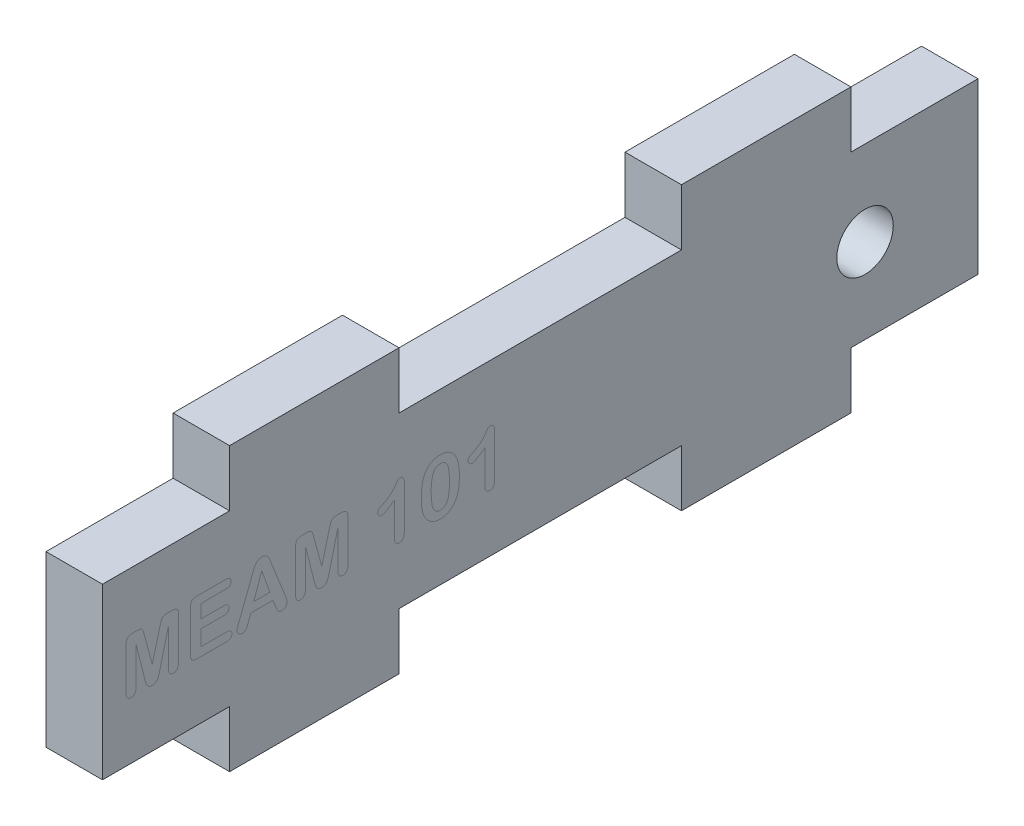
ISO-10303-21;
HEADER;
FILE_DESCRIPTION(('STEP AP214'),'2;1');
FILE_NAME('part.step','',(''),(''),'','','');
FILE_SCHEMA(('AUTOMOTIVE_DESIGN { 1 0 10303 214 1 1 1 1 }'));
ENDSEC;
DATA;
#1=APPLICATION_CONTEXT('core data for automotive mechanical design processes');
#2=APPLICATION_PROTOCOL_DEFINITION('international standard','automotive_design',2000,#1);
#3=PRODUCT_CONTEXT('',#1,'mechanical');
#4=PRODUCT('Part','Part','',(#3));
#5=PRODUCT_RELATED_PRODUCT_CATEGORY('part','',(#4));
#6=PRODUCT_DEFINITION_FORMATION('','',#4);
#7=PRODUCT_DEFINITION_CONTEXT('part definition',#1,'design');
#8=PRODUCT_DEFINITION('design','',#6,#7);
#9=PRODUCT_DEFINITION_SHAPE('','',#8);
#10=(LENGTH_UNIT() NAMED_UNIT(*) SI_UNIT(.MILLI.,.METRE.));
#11=(NAMED_UNIT(*) PLANE_ANGLE_UNIT() SI_UNIT($,.RADIAN.));
#12=(NAMED_UNIT(*) SI_UNIT($,.STERADIAN.) SOLID_ANGLE_UNIT());
#13=UNCERTAINTY_MEASURE_WITH_UNIT(LENGTH_MEASURE(1.E-05),#10,'distance_accuracy_value','');
#14=(GEOMETRIC_REPRESENTATION_CONTEXT(3) GLOBAL_UNCERTAINTY_ASSIGNED_CONTEXT((#13)) GLOBAL_UNIT_ASSIGNED_CONTEXT((#10,
#11,#12)) REPRESENTATION_CONTEXT('',''));
#15=CARTESIAN_POINT('',(0.,0.,0.));
#16=DIRECTION('',(0.,0.,1.));
#17=DIRECTION('',(1.,0.,0.));
#18=AXIS2_PLACEMENT_3D('',#15,#16,#17);
#19=CARTESIAN_POINT('',(3.175,0.,0.));
#20=DIRECTION('',(1.,0.,0.));
#21=DIRECTION('',(0.,0.,-1.));
#22=AXIS2_PLACEMENT_3D('',#19,#20,#21);
#23=PLANE('',#22);
#24=DIRECTION('',(0.,-1.,0.));
#25=VECTOR('',#24,1.);
#26=CARTESIAN_POINT('',(3.175,0.,6.2309375));
#27=LINE('',#26,#25);
#28=CARTESIAN_POINT('',(3.175,1.317625,6.2309375));
#29=VERTEX_POINT('',#28);
#30=CARTESIAN_POINT('',(3.175,-2.45516796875,6.2309375));
#31=VERTEX_POINT('',#30);
#32=EDGE_CURVE('E51',#29,#31,#27,.T.);
#33=ORIENTED_EDGE('',*,*,#32,.T.);
#34=CARTESIAN_POINT('',(3.175,-3.127375,5.679033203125));
#35=CARTESIAN_POINT('',(3.175,-3.12523794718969,5.71893274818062));
#36=CARTESIAN_POINT('',(3.175,-3.12113717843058,5.79549557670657));
#37=CARTESIAN_POINT('',(3.175,-3.08935120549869,5.90474462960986));
#38=CARTESIAN_POINT('',(3.175,-3.03467316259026,6.00074531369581));
#39=CARTESIAN_POINT('',(3.175,-2.95909477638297,6.08418079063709));
#40=CARTESIAN_POINT('',(3.175,-2.86143831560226,6.15068611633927));
#41=CARTESIAN_POINT('',(3.175,-2.74336079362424,6.19744192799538));
#42=CARTESIAN_POINT('',(3.175,-2.60574605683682,6.22595772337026));
#43=CARTESIAN_POINT('',(3.175,-2.50740936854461,6.22920982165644));
#44=CARTESIAN_POINT('',(3.175,-2.45516796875,6.2309375));
#45=B_SPLINE_CURVE_WITH_KNOTS('',3,(#34,#35,#36,#37,#38,#39,#40,#41,#42,#43,#44),.UNSPECIFIED.,
.F.,.F.,(4,1,1,1,1,1,1,1,4),(0.,0.121569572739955,0.23327860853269,0.343375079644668,
0.455835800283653,0.573693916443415,0.700360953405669,0.840816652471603,1.),.UNSPECIFIED.);
#46=CARTESIAN_POINT('',(3.175,-3.127375,5.679033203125));
#47=VERTEX_POINT('',#46);
#48=EDGE_CURVE('E11',#31,#47,#45,.F.);
#49=ORIENTED_EDGE('',*,*,#48,.T.);
#50=CARTESIAN_POINT('',(3.175,-2.28649609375,5.1196875));
#51=CARTESIAN_POINT('',(3.175,-2.35233361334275,5.12111426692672));
#52=CARTESIAN_POINT('',(3.175,-2.47591502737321,5.12379240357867));
#53=CARTESIAN_POINT('',(3.175,-2.64805759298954,5.14935396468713));
#54=CARTESIAN_POINT('',(3.175,-2.79519796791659,5.19116424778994));
#55=CARTESIAN_POINT('',(3.175,-2.91550293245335,5.25410780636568));
#56=CARTESIAN_POINT('',(3.175,-3.01291966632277,5.33275513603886));
#57=CARTESIAN_POINT('',(3.175,-3.08037991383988,5.43305510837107));
#58=CARTESIAN_POINT('',(3.175,-3.12017940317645,5.55091364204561));
#59=CARTESIAN_POINT('',(3.175,-3.12489554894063,5.63488590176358));
#60=CARTESIAN_POINT('',(3.175,-3.127375,5.679033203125));
#61=B_SPLINE_CURVE_WITH_KNOTS('',3,(#50,#51,#52,#53,#54,#55,#56,#57,#58,#59,#60),.UNSPECIFIED.,
.F.,.F.,(4,1,1,1,1,1,1,1,4),(0.,0.172577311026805,0.323939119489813,0.455323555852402,
0.571732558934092,0.677942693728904,0.780199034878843,0.884442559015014,1.),.UNSPECIFIED.);
#62=CARTESIAN_POINT('',(3.175,-2.28649609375,5.1196875));
#63=VERTEX_POINT('',#62);
#64=EDGE_CURVE('E1246',#47,#63,#61,.F.);
#65=ORIENTED_EDGE('',*,*,#64,.T.);
#66=DIRECTION('',(0.,1.,0.));
#67=VECTOR('',#66,1.);
#68=CARTESIAN_POINT('',(3.175,0.,5.1196875));
#69=LINE('',#68,#67);
#70=CARTESIAN_POINT('',(3.175,2.499568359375,5.1196875));
#71=VERTEX_POINT('',#70);
#72=EDGE_CURVE('E1281',#63,#71,#69,.T.);
#73=ORIENTED_EDGE('',*,*,#72,.T.);
#74=CARTESIAN_POINT('',(3.175,3.14325,5.597177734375));
#75=CARTESIAN_POINT('',(3.175,3.14103021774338,5.5626537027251));
#76=CARTESIAN_POINT('',(3.175,3.13673363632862,5.49582943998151));
#77=CARTESIAN_POINT('',(3.175,3.10528639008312,5.40006797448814));
#78=CARTESIAN_POINT('',(3.175,3.04779498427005,5.31836003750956));
#79=CARTESIAN_POINT('',(3.175,2.97261939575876,5.24627210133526));
#80=CARTESIAN_POINT('',(3.175,2.87703021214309,5.19045842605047));
#81=CARTESIAN_POINT('',(3.175,2.76611318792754,5.1468091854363));
#82=CARTESIAN_POINT('',(3.175,2.63765466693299,5.12489518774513));
#83=CARTESIAN_POINT('',(3.175,2.54717535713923,5.1214829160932));
#84=CARTESIAN_POINT('',(3.175,2.499568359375,5.1196875));
#85=B_SPLINE_CURVE_WITH_KNOTS('',3,(#74,#75,#76,#77,#78,#79,#80,#81,#82,#83,#84),.UNSPECIFIED.,
.F.,.F.,(4,1,1,1,1,1,1,1,4),(0.,0.115155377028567,0.222893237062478,0.331159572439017,
0.445311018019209,0.567846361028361,0.697971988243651,0.841083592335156,1.),.UNSPECIFIED.);
#86=CARTESIAN_POINT('',(3.175,3.14325,5.597177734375));
#87=VERTEX_POINT('',#86);
#88=EDGE_CURVE('E1288',#71,#87,#85,.F.);
#89=ORIENTED_EDGE('',*,*,#88,.T.);
#90=CARTESIAN_POINT('',(3.175,1.566912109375,7.50341796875));
#91=CARTESIAN_POINT('',(3.175,1.60649559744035,7.42273137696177));
#92=CARTESIAN_POINT('',(3.175,1.68247086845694,7.26786413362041));
#93=CARTESIAN_POINT('',(3.175,1.80687224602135,7.05225315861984));
#94=CARTESIAN_POINT('',(3.175,1.93429415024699,6.86186354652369));
#95=CARTESIAN_POINT('',(3.175,2.06633293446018,6.69404649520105));
#96=CARTESIAN_POINT('',(3.175,2.20507745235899,6.54460287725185));
#97=CARTESIAN_POINT('',(3.175,2.35063921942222,6.40739644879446));
#98=CARTESIAN_POINT('',(3.175,2.50228163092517,6.27735024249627));
#99=CARTESIAN_POINT('',(3.175,2.63414548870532,6.17833692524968));
#100=CARTESIAN_POINT('',(3.175,2.73946704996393,6.10642703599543));
#101=CARTESIAN_POINT('',(3.175,2.80907009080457,6.05545342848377));
#102=CARTESIAN_POINT('',(3.175,2.87222614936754,6.01097438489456));
#103=CARTESIAN_POINT('',(3.175,2.92588152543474,5.969635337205));
#104=CARTESIAN_POINT('',(3.175,2.97340961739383,5.93557714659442));
#105=CARTESIAN_POINT('',(3.175,3.01193031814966,5.90535661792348));
#106=CARTESIAN_POINT('',(3.175,3.04291705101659,5.88100746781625));
#107=CARTESIAN_POINT('',(3.175,3.07404942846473,5.85411235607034));
#108=CARTESIAN_POINT('',(3.175,3.10544812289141,5.815700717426));
#109=CARTESIAN_POINT('',(3.175,3.12767405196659,5.75509252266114));
#110=CARTESIAN_POINT('',(3.175,3.14070846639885,5.68085326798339));
#111=CARTESIAN_POINT('',(3.175,3.14235634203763,5.62659985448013));
#112=CARTESIAN_POINT('',(3.175,3.14325,5.597177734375));
#113=B_SPLINE_CURVE_WITH_KNOTS('',3,(#90,#91,#92,#93,#94,#95,#96,#97,#98,#99,#100,#101,#102,
#103,#104,#105,#106,#107,#108,#109,#110,#111,#112),.UNSPECIFIED.,.F.,.F.,(4,1,1,1,1,1,1,1,1,1,1,
1,1,1,1,1,1,1,1,1,4),(0.,0.106151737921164,0.203744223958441,0.293823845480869,
0.376583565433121,0.455729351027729,0.534495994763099,0.612791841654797,0.691619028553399,
0.729149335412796,0.763441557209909,0.793532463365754,0.820394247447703,0.843447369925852,
0.862594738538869,0.878231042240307,0.889993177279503,0.911197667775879,0.935956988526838,
0.965268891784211,1.),.UNSPECIFIED.);
#114=CARTESIAN_POINT('',(3.175,1.566912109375,7.50341796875));
#115=VERTEX_POINT('',#114);
#116=EDGE_CURVE('E1294',#87,#115,#113,.F.);
#117=ORIENTED_EDGE('',*,*,#116,.T.);
#118=CARTESIAN_POINT('',(3.175,0.990203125,8.1111328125));
#119=CARTESIAN_POINT('',(3.175,1.02386846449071,8.10960500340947));
#120=CARTESIAN_POINT('',(3.175,1.08728121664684,8.10672718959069));
#121=CARTESIAN_POINT('',(3.175,1.17579092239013,8.08166193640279));
#122=CARTESIAN_POINT('',(3.175,1.25031166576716,8.0390937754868));
#123=CARTESIAN_POINT('',(3.175,1.31038208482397,7.97479451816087));
#124=CARTESIAN_POINT('',(3.175,1.36542347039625,7.89066690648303));
#125=CARTESIAN_POINT('',(3.175,1.42644831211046,7.78471365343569));
#126=CARTESIAN_POINT('',(3.175,1.49498298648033,7.65286778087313));
#127=CARTESIAN_POINT('',(3.175,1.54157352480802,7.55606488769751));
#128=CARTESIAN_POINT('',(3.175,1.566912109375,7.50341796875));
#129=B_SPLINE_CURVE_WITH_KNOTS('',3,(#118,#119,#120,#121,#122,#123,#124,#125,#126,#127,#128),
.UNSPECIFIED.,.F.,.F.,(4,1,1,1,1,1,1,1,4),(0.,0.112428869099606,0.211773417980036,
0.304744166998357,0.395687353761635,0.503088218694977,0.640652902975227,0.804566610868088,1.),.UNSPECIFIED.);
#130=CARTESIAN_POINT('',(3.175,0.990203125,8.1111328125));
#131=VERTEX_POINT('',#130);
#132=EDGE_CURVE('E1303',#115,#131,#129,.F.);
#133=ORIENTED_EDGE('',*,*,#132,.T.);
#134=CARTESIAN_POINT('',(3.175,0.523874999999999,7.66216796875));
#135=CARTESIAN_POINT('',(3.175,0.525519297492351,7.69088597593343));
#136=CARTESIAN_POINT('',(3.175,0.528783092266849,7.74788884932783));
#137=CARTESIAN_POINT('',(3.175,0.556095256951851,7.83077309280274));
#138=CARTESIAN_POINT('',(3.175,0.602297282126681,7.90695181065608));
#139=CARTESIAN_POINT('',(3.175,0.662366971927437,7.97685883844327));
#140=CARTESIAN_POINT('',(3.175,0.734232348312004,8.03608115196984));
#141=CARTESIAN_POINT('',(3.175,0.815023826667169,8.07849098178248));
#142=CARTESIAN_POINT('',(3.175,0.900754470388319,8.10638398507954));
#143=CARTESIAN_POINT('',(3.175,0.960225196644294,8.10954128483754));
#144=CARTESIAN_POINT('',(3.175,0.990203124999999,8.1111328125));
#145=B_SPLINE_CURVE_WITH_KNOTS('',3,(#134,#135,#136,#137,#138,#139,#140,#141,#142,#143,#144),
.UNSPECIFIED.,.F.,.F.,(4,1,1,1,1,1,1,1,4),(0.,0.120469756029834,0.239122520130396,
0.362157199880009,0.492723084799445,0.624839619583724,0.750722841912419,0.874344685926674,1.),.UNSPECIFIED.);
#146=CARTESIAN_POINT('',(3.175,0.523874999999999,7.66216796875));
#147=VERTEX_POINT('',#146);
#148=EDGE_CURVE('E1312',#131,#147,#145,.F.);
#149=ORIENTED_EDGE('',*,*,#148,.T.);
#150=CARTESIAN_POINT('',(3.175,1.317625,6.2309375));
#151=CARTESIAN_POINT('',(3.175,1.2551419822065,6.31534653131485));
#152=CARTESIAN_POINT('',(3.175,1.13643568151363,6.47570824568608));
#153=CARTESIAN_POINT('',(3.175,0.974969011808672,6.70887144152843));
#154=CARTESIAN_POINT('',(3.175,0.838228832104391,6.92054406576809));
#155=CARTESIAN_POINT('',(3.175,0.726006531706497,7.11015210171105));
#156=CARTESIAN_POINT('',(3.175,0.637576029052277,7.27771784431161));
#157=CARTESIAN_POINT('',(3.175,0.574951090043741,7.42422408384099));
#158=CARTESIAN_POINT('',(3.175,0.533525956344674,7.54958323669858));
#159=CARTESIAN_POINT('',(3.175,0.52683514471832,7.62763594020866));
#160=CARTESIAN_POINT('',(3.175,0.523874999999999,7.66216796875));
#161=B_SPLINE_CURVE_WITH_KNOTS('',3,(#150,#151,#152,#153,#154,#155,#156,#157,#158,#159,#160),
.UNSPECIFIED.,.F.,.F.,(4,1,1,1,1,1,1,1,4),(0.,0.1906171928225,0.362137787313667,
0.514714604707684,0.647918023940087,0.762032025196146,0.858201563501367,0.937265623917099,1.),.UNSPECIFIED.);
#162=EDGE_CURVE('E1321',#147,#29,#161,.F.);
#163=ORIENTED_EDGE('',*,*,#162,.T.);
#164=EDGE_LOOP('',(#33,#49,#65,#73,#89,#117,#133,#149,#163));
#165=FACE_BOUND('',#164,.T.);
#166=ADVANCED_FACE('F40',(#165),#23,.T.);
#167=CARTESIAN_POINT('',(3.175,-0.0255488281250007,9.0884375));
#168=CARTESIAN_POINT('',(3.175,-0.13470449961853,9.089358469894));
#169=CARTESIAN_POINT('',(3.175,-0.345269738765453,9.09113505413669));
#170=CARTESIAN_POINT('',(3.175,-0.649016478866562,9.10550812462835));
#171=CARTESIAN_POINT('',(3.175,-0.929146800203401,9.13157034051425));
#172=CARTESIAN_POINT('',(3.175,-1.1876124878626,9.16706082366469));
#173=CARTESIAN_POINT('',(3.175,-1.42962454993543,9.21435026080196));
#174=CARTESIAN_POINT('',(3.175,-1.65649705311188,9.28228999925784));
#175=CARTESIAN_POINT('',(3.175,-1.87339658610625,9.36452876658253));
#176=CARTESIAN_POINT('',(3.175,-2.00927303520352,9.43441048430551));
#177=CARTESIAN_POINT('',(3.175,-2.076896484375,9.469189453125));
#178=B_SPLINE_CURVE_WITH_KNOTS('',3,(#167,#168,#169,#170,#171,#172,#173,#174,#175,#176,#177),
.UNSPECIFIED.,.F.,.F.,(4,1,1,1,1,1,1,1,4),(0.,0.155277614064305,0.299536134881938,
0.432434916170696,0.555361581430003,0.670583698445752,0.782794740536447,0.891900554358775,1.),.UNSPECIFIED.);
#179=CARTESIAN_POINT('',(3.175,-2.076896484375,9.469189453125));
#180=VERTEX_POINT('',#179);
#181=CARTESIAN_POINT('',(3.175,-0.0255488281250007,9.0884375));
#182=VERTEX_POINT('',#181);
#183=EDGE_CURVE('E1220',#180,#182,#178,.F.);
#184=ORIENTED_EDGE('',*,*,#183,.T.);
#185=CARTESIAN_POINT('',(3.175,1.926580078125,9.407177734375));
#186=CARTESIAN_POINT('',(3.175,1.86661165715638,9.38134176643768));
#187=CARTESIAN_POINT('',(3.175,1.74236614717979,9.32781354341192));
#188=CARTESIAN_POINT('',(3.175,1.54168285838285,9.26532832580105));
#189=CARTESIAN_POINT('',(3.175,1.32468090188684,9.20871517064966));
#190=CARTESIAN_POINT('',(3.175,1.08916132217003,9.16496625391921));
#191=CARTESIAN_POINT('',(3.175,0.835854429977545,9.13039496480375));
#192=CARTESIAN_POINT('',(3.175,0.564360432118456,9.10616730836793));
#193=CARTESIAN_POINT('',(3.175,0.275173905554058,9.09106924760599));
#194=CARTESIAN_POINT('',(3.175,0.0765833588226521,9.08933130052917));
#195=CARTESIAN_POINT('',(3.175,-0.0255488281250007,9.0884375));
#196=B_SPLINE_CURVE_WITH_KNOTS('',3,(#185,#186,#187,#188,#189,#190,#191,#192,#193,#194,#195),
.UNSPECIFIED.,.F.,.F.,(4,1,1,1,1,1,1,1,4),(0.,0.0982684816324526,0.203597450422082,
0.316088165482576,0.435865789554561,0.564056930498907,0.700963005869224,0.846209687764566,1.),.UNSPECIFIED.);
#197=CARTESIAN_POINT('',(3.175,1.926580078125,9.407177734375));
#198=VERTEX_POINT('',#197);
#199=EDGE_CURVE('E1229',#182,#198,#196,.F.);
#200=ORIENTED_EDGE('',*,*,#199,.T.);
#201=CARTESIAN_POINT('',(3.175,3.14325,11.261328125));
#202=CARTESIAN_POINT('',(3.175,3.14161686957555,11.1909734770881));
#203=CARTESIAN_POINT('',(3.175,3.13841576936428,11.0530712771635));
#204=CARTESIAN_POINT('',(3.175,3.11227420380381,10.8510425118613));
#205=CARTESIAN_POINT('',(3.175,3.06708760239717,10.6594622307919));
#206=CARTESIAN_POINT('',(3.175,3.00669295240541,10.4771129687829));
#207=CARTESIAN_POINT('',(3.175,2.92808485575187,10.3056635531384));
#208=CARTESIAN_POINT('',(3.175,2.83376097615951,10.1441673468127));
#209=CARTESIAN_POINT('',(3.175,2.72073248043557,9.99536250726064));
#210=CARTESIAN_POINT('',(3.175,2.59422918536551,9.8552630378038));
#211=CARTESIAN_POINT('',(3.175,2.44975591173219,9.72742639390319));
#212=CARTESIAN_POINT('',(3.175,2.29159018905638,9.60813907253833));
#213=CARTESIAN_POINT('',(3.175,2.11588243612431,9.50060393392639));
#214=CARTESIAN_POINT('',(3.175,1.99076573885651,9.43885521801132));
#215=CARTESIAN_POINT('',(3.175,1.926580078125,9.407177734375));
#216=B_SPLINE_CURVE_WITH_KNOTS('',3,(#201,#202,#203,#204,#205,#206,#207,#208,#209,#210,#211,
#212,#213,#214,#215),.UNSPECIFIED.,.F.,.F.,(4,1,1,1,1,1,1,1,1,1,1,1,4),(0.,0.0895338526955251,
0.175495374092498,0.258718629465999,0.339758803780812,0.419587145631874,0.49837499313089,
0.57730856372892,0.657024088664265,0.738263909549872,0.822459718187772,0.908920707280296,1.),.UNSPECIFIED.);
#217=CARTESIAN_POINT('',(3.175,3.14325,11.261328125));
#218=VERTEX_POINT('',#217);
#219=EDGE_CURVE('E1166',#198,#218,#216,.F.);
#220=ORIENTED_EDGE('',*,*,#219,.T.);
#221=CARTESIAN_POINT('',(3.175,1.889373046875,13.108037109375));
#222=CARTESIAN_POINT('',(3.175,1.93927511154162,13.0867621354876));
#223=CARTESIAN_POINT('',(3.175,2.03715587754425,13.0450321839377));
#224=CARTESIAN_POINT('',(3.175,2.17682085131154,12.9725137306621));
#225=CARTESIAN_POINT('',(3.175,2.30748145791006,12.8931338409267));
#226=CARTESIAN_POINT('',(3.175,2.42889997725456,12.8064349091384));
#227=CARTESIAN_POINT('',(3.175,2.54142397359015,12.7129225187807));
#228=CARTESIAN_POINT('',(3.175,2.64466650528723,12.6121317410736));
#229=CARTESIAN_POINT('',(3.175,2.7389663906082,12.5044117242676));
#230=CARTESIAN_POINT('',(3.175,2.82373098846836,12.3893573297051));
#231=CARTESIAN_POINT('',(3.175,2.89948345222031,12.2686014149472));
#232=CARTESIAN_POINT('',(3.175,2.96344829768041,12.1409585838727));
#233=CARTESIAN_POINT('',(3.175,3.02083164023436,12.0091476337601));
#234=CARTESIAN_POINT('',(3.175,3.06399553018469,11.869828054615));
#235=CARTESIAN_POINT('',(3.175,3.10103713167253,11.7260533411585));
#236=CARTESIAN_POINT('',(3.175,3.12515609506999,11.5761755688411));
#237=CARTESIAN_POINT('',(3.175,3.14056074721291,11.4208185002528));
#238=CARTESIAN_POINT('',(3.175,3.14234315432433,11.315110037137));
#239=CARTESIAN_POINT('',(3.175,3.14325,11.261328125));
#240=B_SPLINE_CURVE_WITH_KNOTS('',3,(#221,#222,#223,#224,#225,#226,#227,#228,#229,#230,#231,
#232,#233,#234,#235,#236,#237,#238,#239),.UNSPECIFIED.,.F.,.F.,(4,1,1,1,1,1,1,1,1,1,1,1,1,1,1,1,
4),(0.,0.0682056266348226,0.133782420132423,0.197716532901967,0.260332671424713,
0.321244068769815,0.381542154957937,0.441604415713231,0.501085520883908,0.5611027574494,
0.620629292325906,0.680502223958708,0.741668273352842,0.803835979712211,0.867087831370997,
0.93237749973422,1.),.UNSPECIFIED.);
#241=CARTESIAN_POINT('',(3.175,1.889373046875,13.108037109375));
#242=VERTEX_POINT('',#241);
#243=EDGE_CURVE('E1175',#218,#242,#240,.F.);
#244=ORIENTED_EDGE('',*,*,#243,.T.);
#245=CARTESIAN_POINT('',(3.175,-0.0962421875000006,13.3746875));
#246=CARTESIAN_POINT('',(3.175,0.00547252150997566,13.3741379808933));
#247=CARTESIAN_POINT('',(3.175,0.203608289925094,13.3730675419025));
#248=CARTESIAN_POINT('',(3.175,0.492684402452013,13.3600224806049));
#249=CARTESIAN_POINT('',(3.175,0.766176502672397,13.3408990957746));
#250=CARTESIAN_POINT('',(3.175,1.02395939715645,13.312550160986));
#251=CARTESIAN_POINT('',(3.175,1.26574510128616,13.2758654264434));
#252=CARTESIAN_POINT('',(3.175,1.49011071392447,13.2301040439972));
#253=CARTESIAN_POINT('',(3.175,1.69744895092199,13.1769505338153));
#254=CARTESIAN_POINT('',(3.175,1.82683654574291,13.1304918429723));
#255=CARTESIAN_POINT('',(3.175,1.889373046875,13.108037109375));
#256=B_SPLINE_CURVE_WITH_KNOTS('',3,(#245,#246,#247,#248,#249,#250,#251,#252,#253,#254,#255),
.UNSPECIFIED.,.F.,.F.,(4,1,1,1,1,1,1,1,4),(0.,0.151535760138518,0.295184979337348,
0.431052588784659,0.559951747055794,0.681475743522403,0.795268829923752,0.901047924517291,1.),.UNSPECIFIED.);
#257=CARTESIAN_POINT('',(3.175,-0.0962421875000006,13.3746875));
#258=VERTEX_POINT('',#257);
#259=EDGE_CURVE('E1184',#242,#258,#256,.F.);
#260=ORIENTED_EDGE('',*,*,#259,.T.);
#261=CARTESIAN_POINT('',(3.175,-1.754435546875,13.132841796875));
#262=CARTESIAN_POINT('',(3.175,-1.69596872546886,13.1530479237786));
#263=CARTESIAN_POINT('',(3.175,-1.57682046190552,13.1942255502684));
#264=CARTESIAN_POINT('',(3.175,-1.39075201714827,13.2422436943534));
#265=CARTESIAN_POINT('',(3.175,-1.19653931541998,13.2854148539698));
#266=CARTESIAN_POINT('',(3.175,-0.993083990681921,13.3179055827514));
#267=CARTESIAN_POINT('',(3.175,-0.780940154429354,13.3445785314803));
#268=CARTESIAN_POINT('',(3.175,-0.560275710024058,13.3607090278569));
#269=CARTESIAN_POINT('',(3.175,-0.331193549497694,13.372804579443));
#270=CARTESIAN_POINT('',(3.175,-0.17563476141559,13.3740512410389));
#271=CARTESIAN_POINT('',(3.175,-0.0962421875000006,13.3746875));
#272=B_SPLINE_CURVE_WITH_KNOTS('',3,(#261,#262,#263,#264,#265,#266,#267,#268,#269,#270,#271),
.UNSPECIFIED.,.F.,.F.,(4,1,1,1,1,1,1,1,4),(0.,0.110163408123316,0.224499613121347,
0.342091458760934,0.464504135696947,0.591392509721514,0.722895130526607,0.858573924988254,1.),.UNSPECIFIED.);
#273=CARTESIAN_POINT('',(3.175,-1.754435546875,13.132841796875));
#274=VERTEX_POINT('',#273);
#275=EDGE_CURVE('E1193',#258,#274,#272,.F.);
#276=ORIENTED_EDGE('',*,*,#275,.T.);
#277=CARTESIAN_POINT('',(3.175,-3.127375,11.220400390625));
#278=CARTESIAN_POINT('',(3.175,-3.12599989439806,11.2733538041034));
#279=CARTESIAN_POINT('',(3.175,-3.1232863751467,11.3778476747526));
#280=CARTESIAN_POINT('',(3.175,-3.10722871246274,11.5326180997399));
#281=CARTESIAN_POINT('',(3.175,-3.07900312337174,11.6829230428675));
#282=CARTESIAN_POINT('',(3.175,-3.03714466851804,11.8284448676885));
#283=CARTESIAN_POINT('',(3.175,-2.9864741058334,11.9704361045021));
#284=CARTESIAN_POINT('',(3.175,-2.92470841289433,12.1086056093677));
#285=CARTESIAN_POINT('',(3.175,-2.84935687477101,12.2415512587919));
#286=CARTESIAN_POINT('',(3.175,-2.76424006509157,12.3702405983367));
#287=CARTESIAN_POINT('',(3.175,-2.66866476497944,12.4927714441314));
#288=CARTESIAN_POINT('',(3.175,-2.56464983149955,12.6084612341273));
#289=CARTESIAN_POINT('',(3.175,-2.45100822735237,12.7153845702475));
#290=CARTESIAN_POINT('',(3.175,-2.3291404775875,12.8148128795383));
#291=CARTESIAN_POINT('',(3.175,-2.19834595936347,12.9071015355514));
#292=CARTESIAN_POINT('',(3.175,-2.05849041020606,12.9908817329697));
#293=CARTESIAN_POINT('',(3.175,-1.91019453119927,13.067250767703));
#294=CARTESIAN_POINT('',(3.175,-1.80683253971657,13.1107771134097));
#295=CARTESIAN_POINT('',(3.175,-1.754435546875,13.132841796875));
#296=B_SPLINE_CURVE_WITH_KNOTS('',3,(#277,#278,#279,#280,#281,#282,#283,#284,#285,#286,#287,
#288,#289,#290,#291,#292,#293,#294,#295),.UNSPECIFIED.,.F.,.F.,(4,1,1,1,1,1,1,1,1,1,1,1,1,1,1,1,
4),(0.,0.0633557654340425,0.125021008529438,0.185937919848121,0.246062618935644,
0.305981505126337,0.366193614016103,0.426867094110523,0.488595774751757,0.550626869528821,
0.612608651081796,0.674535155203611,0.737104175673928,0.800637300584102,0.865865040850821,
0.932003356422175,1.),.UNSPECIFIED.);
#297=CARTESIAN_POINT('',(3.175,-3.127375,11.220400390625));
#298=VERTEX_POINT('',#297);
#299=EDGE_CURVE('E1202',#274,#298,#296,.F.);
#300=ORIENTED_EDGE('',*,*,#299,.T.);
#301=CARTESIAN_POINT('',(3.175,-2.076896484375,9.469189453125));
#302=CARTESIAN_POINT('',(3.175,-2.15719099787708,9.51852724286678));
#303=CARTESIAN_POINT('',(3.175,-2.31509113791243,9.61555060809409));
#304=CARTESIAN_POINT('',(3.175,-2.52573717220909,9.79206817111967));
#305=CARTESIAN_POINT('',(3.175,-2.70767620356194,9.98961671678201));
#306=CARTESIAN_POINT('',(3.175,-2.83398899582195,10.1716773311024));
#307=CARTESIAN_POINT('',(3.175,-2.92030804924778,10.3246677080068));
#308=CARTESIAN_POINT('',(3.175,-2.97479686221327,10.4436956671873));
#309=CARTESIAN_POINT('',(3.175,-3.0221064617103,10.5648789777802));
#310=CARTESIAN_POINT('',(3.175,-3.06098255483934,10.6899608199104));
#311=CARTESIAN_POINT('',(3.175,-3.09038853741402,10.8181436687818));
#312=CARTESIAN_POINT('',(3.175,-3.11115859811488,10.9495285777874));
#313=CARTESIAN_POINT('',(3.175,-3.1259812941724,11.0836363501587));
#314=CARTESIAN_POINT('',(3.175,-3.12690694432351,11.1744701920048));
#315=CARTESIAN_POINT('',(3.175,-3.127375,11.220400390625));
#316=B_SPLINE_CURVE_WITH_KNOTS('',3,(#301,#302,#303,#304,#305,#306,#307,#308,#309,#310,#311,
#312,#313,#314,#315),.UNSPECIFIED.,.F.,.F.,(4,1,1,1,1,1,1,1,1,1,1,1,4),(0.,0.131680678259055,
0.25895165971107,0.382958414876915,0.506316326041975,0.56792951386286,0.628469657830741,
0.689249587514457,0.749789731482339,0.811508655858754,0.87301592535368,0.935790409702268,1.),.UNSPECIFIED.);
#317=EDGE_CURVE('E1211',#298,#180,#316,.F.);
#318=ORIENTED_EDGE('',*,*,#317,.T.);
#319=EDGE_LOOP('',(#184,#200,#220,#244,#260,#276,#300,#318));
#320=FACE_BOUND('',#319,.T.);
#321=CARTESIAN_POINT('',(3.175,0.0575468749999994,10.1996875));
#322=CARTESIAN_POINT('',(3.175,0.119149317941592,10.1998001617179));
#323=CARTESIAN_POINT('',(3.175,0.239482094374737,10.2000202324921));
#324=CARTESIAN_POINT('',(3.175,0.415613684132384,10.2053835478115));
#325=CARTESIAN_POINT('',(3.175,0.583471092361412,10.2128318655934));
#326=CARTESIAN_POINT('',(3.175,0.742754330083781,10.2220842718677));
#327=CARTESIAN_POINT('',(3.175,0.893202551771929,10.2362343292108));
#328=CARTESIAN_POINT('',(3.175,1.03516857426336,10.251810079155));
#329=CARTESIAN_POINT('',(3.175,1.16828504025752,10.2717862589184));
#330=CARTESIAN_POINT('',(3.175,1.33081077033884,10.3005954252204));
#331=CARTESIAN_POINT('',(3.175,1.51539348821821,10.3447062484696));
#332=CARTESIAN_POINT('',(3.175,1.7143166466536,10.4160460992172));
#333=CARTESIAN_POINT('',(3.175,1.88320843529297,10.5052577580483));
#334=CARTESIAN_POINT('',(3.175,2.00327215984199,10.594148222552));
#335=CARTESIAN_POINT('',(3.175,2.08250625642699,10.6742948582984));
#336=CARTESIAN_POINT('',(3.175,2.13236572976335,10.7396054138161));
#337=CARTESIAN_POINT('',(3.175,2.17514445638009,10.8096922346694));
#338=CARTESIAN_POINT('',(3.175,2.20996103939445,10.8859195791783));
#339=CARTESIAN_POINT('',(3.175,2.23671587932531,10.967560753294));
#340=CARTESIAN_POINT('',(3.175,2.25722698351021,11.0541672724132));
#341=CARTESIAN_POINT('',(3.175,2.26804071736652,11.1465350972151));
#342=CARTESIAN_POINT('',(3.175,2.26941676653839,11.2100396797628));
#343=CARTESIAN_POINT('',(3.175,2.270125,11.242724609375));
#344=B_SPLINE_CURVE_WITH_KNOTS('',3,(#321,#322,#323,#324,#325,#326,#327,#328,#329,#330,#331,
#332,#333,#334,#335,#336,#337,#338,#339,#340,#341,#342,#343),.UNSPECIFIED.,.F.,.F.,(4,1,1,1,1,1,
1,1,1,1,1,1,1,1,1,1,1,1,1,1,4),(0.,0.0673965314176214,0.131650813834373,0.192773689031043,
0.251234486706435,0.306190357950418,0.358088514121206,0.407471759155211,0.453430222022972,
0.538669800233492,0.614798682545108,0.684002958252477,0.74696586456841,0.777351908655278,
0.807026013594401,0.836658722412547,0.867017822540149,0.898485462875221,0.930523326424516,
0.964241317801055,1.),.UNSPECIFIED.);
#345=CARTESIAN_POINT('',(3.175,2.270125,11.242724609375));
#346=VERTEX_POINT('',#345);
#347=CARTESIAN_POINT('',(3.175,0.0575468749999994,10.1996875));
#348=VERTEX_POINT('',#347);
#349=EDGE_CURVE('E1247',#346,#348,#344,.F.);
#350=ORIENTED_EDGE('',*,*,#349,.T.);
#351=CARTESIAN_POINT('',(3.175,-2.25425,11.23404296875));
#352=CARTESIAN_POINT('',(3.175,-2.2536579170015,11.2013465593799));
#353=CARTESIAN_POINT('',(3.175,-2.25250658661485,11.1377670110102));
#354=CARTESIAN_POINT('',(3.175,-2.24007182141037,11.0454091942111));
#355=CARTESIAN_POINT('',(3.175,-2.21830840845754,10.9588499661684));
#356=CARTESIAN_POINT('',(3.175,-2.19052991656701,10.8769077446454));
#357=CARTESIAN_POINT('',(3.175,-2.15310633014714,10.8005547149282));
#358=CARTESIAN_POINT('',(3.175,-2.10641711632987,10.7308245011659));
#359=CARTESIAN_POINT('',(3.175,-2.05285686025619,10.6655139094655));
#360=CARTESIAN_POINT('',(3.175,-1.9683288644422,10.5850739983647));
#361=CARTESIAN_POINT('',(3.175,-1.84112079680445,10.4964578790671));
#362=CARTESIAN_POINT('',(3.175,-1.66393424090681,10.4093328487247));
#363=CARTESIAN_POINT('',(3.175,-1.45897636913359,10.338442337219));
#364=CARTESIAN_POINT('',(3.175,-1.26937384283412,10.2964258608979));
#365=CARTESIAN_POINT('',(3.175,-1.10277332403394,10.269298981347));
#366=CARTESIAN_POINT('',(3.175,-0.965443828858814,10.2508656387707));
#367=CARTESIAN_POINT('',(3.175,-0.818230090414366,10.2347388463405));
#368=CARTESIAN_POINT('',(3.175,-0.661537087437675,10.2210735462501));
#369=CARTESIAN_POINT('',(3.175,-0.495283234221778,10.2111147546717));
#370=CARTESIAN_POINT('',(3.175,-0.319499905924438,10.2058345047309));
#371=CARTESIAN_POINT('',(3.175,-0.13431344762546,10.1998973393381));
#372=CARTESIAN_POINT('',(3.175,-0.00736434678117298,10.1997584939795));
#373=CARTESIAN_POINT('',(3.175,0.0575468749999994,10.1996875));
#374=B_SPLINE_CURVE_WITH_KNOTS('',3,(#351,#352,#353,#354,#355,#356,#357,#358,#359,#360,#361,
#362,#363,#364,#365,#366,#367,#368,#369,#370,#371,#372,#373),.UNSPECIFIED.,.F.,.F.,(4,1,1,1,1,1,
1,1,1,1,1,1,1,1,1,1,1,1,1,1,4),(0.,0.0346785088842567,0.0674338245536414,0.098605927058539,
0.129264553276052,0.159083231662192,0.188525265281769,0.218123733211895,0.248527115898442,
0.312063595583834,0.381704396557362,0.457450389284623,0.541619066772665,0.587411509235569,
0.636544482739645,0.688618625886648,0.744536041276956,0.80342010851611,0.865308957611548,
0.931130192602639,1.),.UNSPECIFIED.);
#375=CARTESIAN_POINT('',(3.175,-2.25425,11.23404296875));
#376=VERTEX_POINT('',#375);
#377=EDGE_CURVE('E1238',#348,#376,#374,.F.);
#378=ORIENTED_EDGE('',*,*,#377,.T.);
#379=CARTESIAN_POINT('',(3.175,0.0240605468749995,12.2634375));
#380=CARTESIAN_POINT('',(3.175,-0.0391954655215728,12.263325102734));
#381=CARTESIAN_POINT('',(3.175,-0.162834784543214,12.2631054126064));
#382=CARTESIAN_POINT('',(3.175,-0.343926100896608,12.2577285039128));
#383=CARTESIAN_POINT('',(3.175,-0.516333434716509,12.2503339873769));
#384=CARTESIAN_POINT('',(3.175,-0.680155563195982,12.2409835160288));
#385=CARTESIAN_POINT('',(3.175,-0.835146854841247,12.2268370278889));
#386=CARTESIAN_POINT('',(3.175,-0.981283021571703,12.211542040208));
#387=CARTESIAN_POINT('',(3.175,-1.11845157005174,12.1910357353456));
#388=CARTESIAN_POINT('',(3.175,-1.28561906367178,12.1628838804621));
#389=CARTESIAN_POINT('',(3.175,-1.47577264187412,12.1182009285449));
#390=CARTESIAN_POINT('',(3.175,-1.68069160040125,12.0474190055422));
#391=CARTESIAN_POINT('',(3.175,-1.85441579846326,11.9575780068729));
#392=CARTESIAN_POINT('',(3.175,-1.97941123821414,11.8698928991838));
#393=CARTESIAN_POINT('',(3.175,-2.05981151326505,11.7884760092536));
#394=CARTESIAN_POINT('',(3.175,-2.11330679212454,11.7251751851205));
#395=CARTESIAN_POINT('',(3.175,-2.15629348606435,11.65486847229));
#396=CARTESIAN_POINT('',(3.175,-2.19255694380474,11.5806912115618));
#397=CARTESIAN_POINT('',(3.175,-2.22010031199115,11.5010875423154));
#398=CARTESIAN_POINT('',(3.175,-2.23951895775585,11.4166845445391));
#399=CARTESIAN_POINT('',(3.175,-2.25259355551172,11.3270512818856));
#400=CARTESIAN_POINT('',(3.175,-2.25368957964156,11.2655102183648));
#401=CARTESIAN_POINT('',(3.175,-2.25425,11.23404296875));
#402=B_SPLINE_CURVE_WITH_KNOTS('',3,(#379,#380,#381,#382,#383,#384,#385,#386,#387,#388,#389,
#390,#391,#392,#393,#394,#395,#396,#397,#398,#399,#400,#401),.UNSPECIFIED.,.F.,.F.,(4,1,1,1,1,1,
1,1,1,1,1,1,1,1,1,1,1,1,1,1,4),(0.,0.068044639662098,0.132999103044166,0.194873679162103,
0.253685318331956,0.309490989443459,0.362286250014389,0.41172097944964,0.458660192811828,
0.544630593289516,0.621573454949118,0.691191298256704,0.754525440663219,0.784714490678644,
0.81409676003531,0.843465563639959,0.873102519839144,0.902779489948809,0.933846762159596,
0.966174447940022,1.),.UNSPECIFIED.);
#403=CARTESIAN_POINT('',(3.175,0.0240605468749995,12.2634375));
#404=VERTEX_POINT('',#403);
#405=EDGE_CURVE('E1237',#376,#404,#402,.F.);
#406=ORIENTED_EDGE('',*,*,#405,.T.);
#407=CARTESIAN_POINT('',(3.175,2.270125,11.242724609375));
#408=CARTESIAN_POINT('',(3.175,2.26863657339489,11.2887662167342));
#409=CARTESIAN_POINT('',(3.175,2.26575448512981,11.3779180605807));
#410=CARTESIAN_POINT('',(3.175,2.2383882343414,11.5059313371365));
#411=CARTESIAN_POINT('',(3.175,2.19721808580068,11.6244509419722));
#412=CARTESIAN_POINT('',(3.175,2.13494096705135,11.7306203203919));
#413=CARTESIAN_POINT('',(3.175,2.05717135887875,11.826999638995));
#414=CARTESIAN_POINT('',(3.175,1.96014993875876,11.9099294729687));
#415=CARTESIAN_POINT('',(3.175,1.84682645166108,11.9823569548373));
#416=CARTESIAN_POINT('',(3.175,1.71671604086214,12.0443344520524));
#417=CARTESIAN_POINT('',(3.175,1.56817993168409,12.0956605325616));
#418=CARTESIAN_POINT('',(3.175,1.40247425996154,12.1412268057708));
#419=CARTESIAN_POINT('',(3.175,1.21810232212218,12.1794177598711));
#420=CARTESIAN_POINT('',(3.175,1.01514226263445,12.2097542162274));
#421=CARTESIAN_POINT('',(3.175,0.793835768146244,12.2344940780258));
#422=CARTESIAN_POINT('',(3.175,0.553455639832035,12.2515536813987));
#423=CARTESIAN_POINT('',(3.175,0.294924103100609,12.2611175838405));
#424=CARTESIAN_POINT('',(3.175,0.11625933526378,12.262647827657));
#425=CARTESIAN_POINT('',(3.175,0.0240605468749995,12.2634375));
#426=B_SPLINE_CURVE_WITH_KNOTS('',3,(#407,#408,#409,#410,#411,#412,#413,#414,#415,#416,#417,
#418,#419,#420,#421,#422,#423,#424,#425),.UNSPECIFIED.,.F.,.F.,(4,1,1,1,1,1,1,1,1,1,1,1,1,1,1,1,
4),(0.,0.0500491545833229,0.0969117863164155,0.14189371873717,0.186044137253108,0.2301807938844,
0.276111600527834,0.324293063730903,0.376220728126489,0.432583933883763,0.495140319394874,
0.563185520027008,0.637393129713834,0.718444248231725,0.805522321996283,0.899641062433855,1.),.UNSPECIFIED.);
#427=EDGE_CURVE('E1256',#404,#346,#426,.F.);
#428=ORIENTED_EDGE('',*,*,#427,.T.);
#429=EDGE_LOOP('',(#350,#378,#406,#428));
#430=FACE_BOUND('',#429,.T.);
#431=ADVANCED_FACE('F1499',(#320,#430),#23,.T.);
#432=ORIENTED_EDGE('',*,*,#377,.F.);
#433=ORIENTED_EDGE('',*,*,#349,.F.);
#434=ORIENTED_EDGE('',*,*,#427,.F.);
#435=ORIENTED_EDGE('',*,*,#405,.F.);
#436=EDGE_LOOP('',(#432,#433,#434,#435));
#437=FACE_BOUND('',#436,.T.);
#438=ADVANCED_FACE('F1503',(#437),#23,.T.);
#439=DIRECTION('',(0.,-1.,0.));
#440=VECTOR('',#439,1.);
#441=CARTESIAN_POINT('',(3.175,0.,16.3909375));
#442=LINE('',#441,#440);
#443=CARTESIAN_POINT('',(3.175,1.317625,16.3909375));
#444=VERTEX_POINT('',#443);
#445=CARTESIAN_POINT('',(3.175,-2.45516796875,16.3909375));
#446=VERTEX_POINT('',#445);
#447=EDGE_CURVE('E1154',#444,#446,#442,.T.);
#448=ORIENTED_EDGE('',*,*,#447,.T.);
#449=CARTESIAN_POINT('',(3.175,-3.127375,15.839033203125));
#450=CARTESIAN_POINT('',(3.175,-3.12523794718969,15.8789327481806));
#451=CARTESIAN_POINT('',(3.175,-3.12113717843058,15.9554955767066));
#452=CARTESIAN_POINT('',(3.175,-3.08935120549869,16.0647446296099));
#453=CARTESIAN_POINT('',(3.175,-3.03467316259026,16.1607453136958));
#454=CARTESIAN_POINT('',(3.175,-2.95909477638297,16.2441807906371));
#455=CARTESIAN_POINT('',(3.175,-2.86143831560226,16.3106861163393));
#456=CARTESIAN_POINT('',(3.175,-2.74336079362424,16.3574419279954));
#457=CARTESIAN_POINT('',(3.175,-2.60574605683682,16.3859577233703));
#458=CARTESIAN_POINT('',(3.175,-2.50740936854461,16.3892098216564));
#459=CARTESIAN_POINT('',(3.175,-2.45516796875,16.3909375));
#460=B_SPLINE_CURVE_WITH_KNOTS('',3,(#449,#450,#451,#452,#453,#454,#455,#456,#457,#458,#459),
.UNSPECIFIED.,.F.,.F.,(4,1,1,1,1,1,1,1,4),(0.,0.121569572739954,0.233278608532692,
0.343375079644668,0.455835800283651,0.573693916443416,0.700360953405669,0.840816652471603,1.),.UNSPECIFIED.);
#461=CARTESIAN_POINT('',(3.175,-3.127375,15.839033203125));
#462=VERTEX_POINT('',#461);
#463=EDGE_CURVE('E1161',#446,#462,#460,.F.);
#464=ORIENTED_EDGE('',*,*,#463,.T.);
#465=CARTESIAN_POINT('',(3.175,-2.28649609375,15.2796875));
#466=CARTESIAN_POINT('',(3.175,-2.35233361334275,15.2811142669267));
#467=CARTESIAN_POINT('',(3.175,-2.47591502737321,15.2837924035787));
#468=CARTESIAN_POINT('',(3.175,-2.64805759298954,15.3093539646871));
#469=CARTESIAN_POINT('',(3.175,-2.79519796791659,15.3511642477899));
#470=CARTESIAN_POINT('',(3.175,-2.91550293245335,15.4141078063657));
#471=CARTESIAN_POINT('',(3.175,-3.01291966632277,15.4927551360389));
#472=CARTESIAN_POINT('',(3.175,-3.08037991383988,15.5930551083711));
#473=CARTESIAN_POINT('',(3.175,-3.12017940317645,15.7109136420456));
#474=CARTESIAN_POINT('',(3.175,-3.12489554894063,15.7948859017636));
#475=CARTESIAN_POINT('',(3.175,-3.127375,15.839033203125));
#476=B_SPLINE_CURVE_WITH_KNOTS('',3,(#465,#466,#467,#468,#469,#470,#471,#472,#473,#474,#475),
.UNSPECIFIED.,.F.,.F.,(4,1,1,1,1,1,1,1,4),(0.,0.172577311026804,0.323939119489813,
0.455323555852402,0.571732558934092,0.677942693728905,0.780199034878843,0.884442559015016,1.),.UNSPECIFIED.);
#477=CARTESIAN_POINT('',(3.175,-2.28649609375,15.2796875));
#478=VERTEX_POINT('',#477);
#479=EDGE_CURVE('E1096',#462,#478,#476,.F.);
#480=ORIENTED_EDGE('',*,*,#479,.T.);
#481=DIRECTION('',(0.,1.,0.));
#482=VECTOR('',#481,1.);
#483=CARTESIAN_POINT('',(3.175,0.,15.2796875));
#484=LINE('',#483,#482);
#485=CARTESIAN_POINT('',(3.175,2.499568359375,15.2796875));
#486=VERTEX_POINT('',#485);
#487=EDGE_CURVE('E1105',#478,#486,#484,.T.);
#488=ORIENTED_EDGE('',*,*,#487,.T.);
#489=CARTESIAN_POINT('',(3.175,3.14325,15.757177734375));
#490=CARTESIAN_POINT('',(3.175,3.14103021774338,15.7226537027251));
#491=CARTESIAN_POINT('',(3.175,3.13673363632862,15.6558294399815));
#492=CARTESIAN_POINT('',(3.175,3.10528639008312,15.5600679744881));
#493=CARTESIAN_POINT('',(3.175,3.04779498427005,15.4783600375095));
#494=CARTESIAN_POINT('',(3.175,2.97261939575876,15.4062721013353));
#495=CARTESIAN_POINT('',(3.175,2.87703021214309,15.3504584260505));
#496=CARTESIAN_POINT('',(3.175,2.76611318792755,15.3068091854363));
#497=CARTESIAN_POINT('',(3.175,2.63765466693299,15.2848951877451));
#498=CARTESIAN_POINT('',(3.175,2.54717535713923,15.2814829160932));
#499=CARTESIAN_POINT('',(3.175,2.499568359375,15.2796875));
#500=B_SPLINE_CURVE_WITH_KNOTS('',3,(#489,#490,#491,#492,#493,#494,#495,#496,#497,#498,#499),
.UNSPECIFIED.,.F.,.F.,(4,1,1,1,1,1,1,1,4),(0.,0.115155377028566,0.222893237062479,
0.331159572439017,0.44531101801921,0.567846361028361,0.697971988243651,0.841083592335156,1.),.UNSPECIFIED.);
#501=CARTESIAN_POINT('',(3.175,3.14325,15.757177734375));
#502=VERTEX_POINT('',#501);
#503=EDGE_CURVE('E1112',#486,#502,#500,.F.);
#504=ORIENTED_EDGE('',*,*,#503,.T.);
#505=CARTESIAN_POINT('',(3.175,1.566912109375,17.66341796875));
#506=CARTESIAN_POINT('',(3.175,1.60649559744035,17.5827313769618));
#507=CARTESIAN_POINT('',(3.175,1.68247086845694,17.4278641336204));
#508=CARTESIAN_POINT('',(3.175,1.80687224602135,17.2122531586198));
#509=CARTESIAN_POINT('',(3.175,1.93429415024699,17.0218635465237));
#510=CARTESIAN_POINT('',(3.175,2.06633293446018,16.854046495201));
#511=CARTESIAN_POINT('',(3.175,2.20507745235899,16.7046028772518));
#512=CARTESIAN_POINT('',(3.175,2.35063921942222,16.5673964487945));
#513=CARTESIAN_POINT('',(3.175,2.50228163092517,16.4373502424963));
#514=CARTESIAN_POINT('',(3.175,2.63414548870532,16.3383369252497));
#515=CARTESIAN_POINT('',(3.175,2.73946704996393,16.2664270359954));
#516=CARTESIAN_POINT('',(3.175,2.80907009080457,16.2154534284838));
#517=CARTESIAN_POINT('',(3.175,2.87222614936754,16.1709743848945));
#518=CARTESIAN_POINT('',(3.175,2.92588152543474,16.129635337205));
#519=CARTESIAN_POINT('',(3.175,2.97340961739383,16.0955771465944));
#520=CARTESIAN_POINT('',(3.175,3.01193031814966,16.0653566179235));
#521=CARTESIAN_POINT('',(3.175,3.04291705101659,16.0410074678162));
#522=CARTESIAN_POINT('',(3.175,3.07404942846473,16.0141123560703));
#523=CARTESIAN_POINT('',(3.175,3.10544812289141,15.975700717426));
#524=CARTESIAN_POINT('',(3.175,3.12767405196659,15.9150925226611));
#525=CARTESIAN_POINT('',(3.175,3.14070846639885,15.8408532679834));
#526=CARTESIAN_POINT('',(3.175,3.14235634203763,15.7865998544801));
#527=CARTESIAN_POINT('',(3.175,3.14325,15.757177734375));
#528=B_SPLINE_CURVE_WITH_KNOTS('',3,(#505,#506,#507,#508,#509,#510,#511,#512,#513,#514,#515,
#516,#517,#518,#519,#520,#521,#522,#523,#524,#525,#526,#527),.UNSPECIFIED.,.F.,.F.,(4,1,1,1,1,1,
1,1,1,1,1,1,1,1,1,1,1,1,1,1,4),(0.,0.106151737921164,0.203744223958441,0.293823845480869,
0.376583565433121,0.455729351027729,0.534495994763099,0.612791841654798,0.691619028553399,
0.729149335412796,0.763441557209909,0.793532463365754,0.820394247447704,0.843447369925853,
0.862594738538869,0.878231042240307,0.889993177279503,0.91119766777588,0.935956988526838,
0.96526889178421,1.),.UNSPECIFIED.);
#529=CARTESIAN_POINT('',(3.175,1.566912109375,17.66341796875));
#530=VERTEX_POINT('',#529);
#531=EDGE_CURVE('E1118',#502,#530,#528,.F.);
#532=ORIENTED_EDGE('',*,*,#531,.T.);
#533=CARTESIAN_POINT('',(3.175,0.990203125,18.2711328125));
#534=CARTESIAN_POINT('',(3.175,1.02386846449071,18.2696050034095));
#535=CARTESIAN_POINT('',(3.175,1.08728121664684,18.2667271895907));
#536=CARTESIAN_POINT('',(3.175,1.17579092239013,18.2416619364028));
#537=CARTESIAN_POINT('',(3.175,1.25031166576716,18.1990937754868));
#538=CARTESIAN_POINT('',(3.175,1.31038208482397,18.1347945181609));
#539=CARTESIAN_POINT('',(3.175,1.36542347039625,18.050666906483));
#540=CARTESIAN_POINT('',(3.175,1.42644831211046,17.9447136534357));
#541=CARTESIAN_POINT('',(3.175,1.49498298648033,17.8128677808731));
#542=CARTESIAN_POINT('',(3.175,1.54157352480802,17.7160648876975));
#543=CARTESIAN_POINT('',(3.175,1.566912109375,17.66341796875));
#544=B_SPLINE_CURVE_WITH_KNOTS('',3,(#533,#534,#535,#536,#537,#538,#539,#540,#541,#542,#543),
.UNSPECIFIED.,.F.,.F.,(4,1,1,1,1,1,1,1,4),(0.,0.112428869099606,0.211773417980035,
0.304744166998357,0.395687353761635,0.503088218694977,0.640652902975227,0.804566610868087,1.),.UNSPECIFIED.);
#545=CARTESIAN_POINT('',(3.175,0.990203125,18.2711328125));
#546=VERTEX_POINT('',#545);
#547=EDGE_CURVE('E1127',#530,#546,#544,.F.);
#548=ORIENTED_EDGE('',*,*,#547,.T.);
#549=CARTESIAN_POINT('',(3.175,0.523875,17.82216796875));
#550=CARTESIAN_POINT('',(3.175,0.525519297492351,17.8508859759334));
#551=CARTESIAN_POINT('',(3.175,0.52878309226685,17.9078888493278));
#552=CARTESIAN_POINT('',(3.175,0.556095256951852,17.9907730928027));
#553=CARTESIAN_POINT('',(3.175,0.60229728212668,18.0669518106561));
#554=CARTESIAN_POINT('',(3.175,0.662366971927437,18.1368588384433));
#555=CARTESIAN_POINT('',(3.175,0.734232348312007,18.1960811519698));
#556=CARTESIAN_POINT('',(3.175,0.815023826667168,18.2384909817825));
#557=CARTESIAN_POINT('',(3.175,0.90075447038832,18.2663839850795));
#558=CARTESIAN_POINT('',(3.175,0.960225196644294,18.2695412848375));
#559=CARTESIAN_POINT('',(3.175,0.990203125,18.2711328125));
#560=B_SPLINE_CURVE_WITH_KNOTS('',3,(#549,#550,#551,#552,#553,#554,#555,#556,#557,#558,#559),
.UNSPECIFIED.,.F.,.F.,(4,1,1,1,1,1,1,1,4),(0.,0.12046975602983,0.239122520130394,
0.36215719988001,0.492723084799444,0.624839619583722,0.750722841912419,0.874344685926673,1.),.UNSPECIFIED.);
#561=CARTESIAN_POINT('',(3.175,0.523875,17.82216796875));
#562=VERTEX_POINT('',#561);
#563=EDGE_CURVE('E1136',#546,#562,#560,.F.);
#564=ORIENTED_EDGE('',*,*,#563,.T.);
#565=CARTESIAN_POINT('',(3.175,1.317625,16.3909375));
#566=CARTESIAN_POINT('',(3.175,1.2551419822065,16.4753465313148));
#567=CARTESIAN_POINT('',(3.175,1.13643568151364,16.6357082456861));
#568=CARTESIAN_POINT('',(3.175,0.974969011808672,16.8688714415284));
#569=CARTESIAN_POINT('',(3.175,0.838228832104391,17.0805440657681));
#570=CARTESIAN_POINT('',(3.175,0.726006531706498,17.270152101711));
#571=CARTESIAN_POINT('',(3.175,0.637576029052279,17.4377178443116));
#572=CARTESIAN_POINT('',(3.175,0.574951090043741,17.584224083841));
#573=CARTESIAN_POINT('',(3.175,0.533525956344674,17.7095832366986));
#574=CARTESIAN_POINT('',(3.175,0.52683514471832,17.7876359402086));
#575=CARTESIAN_POINT('',(3.175,0.523875,17.82216796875));
#576=B_SPLINE_CURVE_WITH_KNOTS('',3,(#565,#566,#567,#568,#569,#570,#571,#572,#573,#574,#575),
.UNSPECIFIED.,.F.,.F.,(4,1,1,1,1,1,1,1,4),(0.,0.190617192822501,0.362137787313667,
0.514714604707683,0.647918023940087,0.762032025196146,0.858201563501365,0.937265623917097,1.),.UNSPECIFIED.);
#577=EDGE_CURVE('E1145',#562,#444,#576,.F.);
#578=ORIENTED_EDGE('',*,*,#577,.T.);
#579=EDGE_LOOP('',(#448,#464,#480,#488,#504,#532,#548,#564,#578));
#580=FACE_BOUND('',#579,.T.);
#581=ADVANCED_FACE('F1666',(#580),#23,.T.);
#582=DIRECTION('',(0.,-0.969283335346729,-0.245946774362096));
#583=VECTOR('',#582,1.);
#584=CARTESIAN_POINT('',(3.175,-6.18317809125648,24.3680832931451));
#585=LINE('',#584,#583);
#586=CARTESIAN_POINT('',(3.175,1.793875,26.3921875));
#587=VERTEX_POINT('',#586);
#588=CARTESIAN_POINT('',(3.175,-2.101701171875,25.403720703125));
#589=VERTEX_POINT('',#588);
#590=EDGE_CURVE('E1087',#587,#589,#585,.T.);
#591=ORIENTED_EDGE('',*,*,#590,.T.);
#592=CARTESIAN_POINT('',(3.175,-3.127375,24.5665625));
#593=CARTESIAN_POINT('',(3.175,-3.12619108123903,24.6017828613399));
#594=CARTESIAN_POINT('',(3.175,-3.12390528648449,24.6697828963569));
#595=CARTESIAN_POINT('',(3.175,-3.10622220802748,24.7673469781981));
#596=CARTESIAN_POINT('',(3.175,-3.07794124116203,24.8570793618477));
#597=CARTESIAN_POINT('',(3.175,-3.03656226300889,24.9378368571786));
#598=CARTESIAN_POINT('',(3.175,-2.98582875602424,25.009609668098));
#599=CARTESIAN_POINT('',(3.175,-2.92724607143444,25.0721495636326));
#600=CARTESIAN_POINT('',(3.175,-2.86492578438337,25.1287865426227));
#601=CARTESIAN_POINT('',(3.175,-2.76965508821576,25.1898449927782));
#602=CARTESIAN_POINT('',(3.175,-2.63873084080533,25.2520755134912));
#603=CARTESIAN_POINT('',(3.175,-2.46793488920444,25.3072212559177));
#604=CARTESIAN_POINT('',(3.175,-2.28665238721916,25.3527221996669));
#605=CARTESIAN_POINT('',(3.175,-2.16406208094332,25.3865252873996));
#606=CARTESIAN_POINT('',(3.175,-2.101701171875,25.403720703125));
#607=B_SPLINE_CURVE_WITH_KNOTS('',3,(#592,#593,#594,#595,#596,#597,#598,#599,#600,#601,#602,
#603,#604,#605,#606),.UNSPECIFIED.,.F.,.F.,(4,1,1,1,1,1,1,1,1,1,1,1,4),(0.,0.0724110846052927,
0.139804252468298,0.203273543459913,0.265267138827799,0.325671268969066,0.383450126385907,
0.441291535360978,0.498371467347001,0.615520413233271,0.738420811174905,0.866936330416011,1.),.UNSPECIFIED.);
#608=CARTESIAN_POINT('',(3.175,-3.127375,24.5665625));
#609=VERTEX_POINT('',#608);
#610=EDGE_CURVE('E1091',#589,#609,#607,.F.);
#611=ORIENTED_EDGE('',*,*,#610,.T.);
#612=CARTESIAN_POINT('',(3.175,-2.101701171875,23.729404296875));
#613=CARTESIAN_POINT('',(3.175,-2.1608834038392,23.7444527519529));
#614=CARTESIAN_POINT('',(3.175,-2.27080979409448,23.7724040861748));
#615=CARTESIAN_POINT('',(3.175,-2.42241048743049,23.8147454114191));
#616=CARTESIAN_POINT('',(3.175,-2.54878329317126,23.8523311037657));
#617=CARTESIAN_POINT('',(3.175,-2.65534970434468,23.8837178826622));
#618=CARTESIAN_POINT('',(3.175,-2.74700948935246,23.9225531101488));
#619=CARTESIAN_POINT('',(3.175,-2.83107342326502,23.9722862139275));
#620=CARTESIAN_POINT('',(3.175,-2.90904149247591,24.0375122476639));
#621=CARTESIAN_POINT('',(3.175,-2.98522582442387,24.1110187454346));
#622=CARTESIAN_POINT('',(3.175,-3.05001950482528,24.2015552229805));
#623=CARTESIAN_POINT('',(3.175,-3.09591185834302,24.309275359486));
#624=CARTESIAN_POINT('',(3.175,-3.12337695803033,24.4329062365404));
#625=CARTESIAN_POINT('',(3.175,-3.12599781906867,24.5205227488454));
#626=CARTESIAN_POINT('',(3.175,-3.127375,24.5665625));
#627=B_SPLINE_CURVE_WITH_KNOTS('',3,(#612,#613,#614,#615,#616,#617,#618,#619,#620,#621,#622,
#623,#624,#625,#626),.UNSPECIFIED.,.F.,.F.,(4,1,1,1,1,1,1,1,1,1,1,1,4),(0.,0.125091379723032,
0.23234750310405,0.322387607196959,0.395238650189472,0.459734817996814,0.525818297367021,
0.594462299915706,0.667519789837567,0.742241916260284,0.820750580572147,0.905810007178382,1.),.UNSPECIFIED.);
#628=CARTESIAN_POINT('',(3.175,-2.101701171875,23.729404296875));
#629=VERTEX_POINT('',#628);
#630=EDGE_CURVE('E970',#609,#629,#627,.F.);
#631=ORIENTED_EDGE('',*,*,#630,.T.);
#632=DIRECTION('',(0.,0.969283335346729,-0.245946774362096));
#633=VECTOR('',#632,1.);
#634=CARTESIAN_POINT('',(3.175,5.52977123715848,21.7929880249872));
#635=LINE('',#634,#633);
#636=CARTESIAN_POINT('',(3.175,1.793875,22.7409375));
#637=VERTEX_POINT('',#636);
#638=EDGE_CURVE('E976',#629,#637,#635,.T.);
#639=ORIENTED_EDGE('',*,*,#638,.T.);
#640=DIRECTION('',(0.,-1.,0.));
#641=VECTOR('',#640,1.);
#642=CARTESIAN_POINT('',(3.175,0.,22.7409375));
#643=LINE('',#642,#641);
#644=CARTESIAN_POINT('',(3.175,-2.426642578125,22.7409375));
#645=VERTEX_POINT('',#644);
#646=EDGE_CURVE('E983',#637,#645,#643,.T.);
#647=ORIENTED_EDGE('',*,*,#646,.T.);
#648=CARTESIAN_POINT('',(3.175,-3.127375,22.191513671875));
#649=CARTESIAN_POINT('',(3.175,-3.12527977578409,22.2301928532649));
#650=CARTESIAN_POINT('',(3.175,-3.12121272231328,22.3052732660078));
#651=CARTESIAN_POINT('',(3.175,-3.08801270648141,22.4124717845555));
#652=CARTESIAN_POINT('',(3.175,-3.03144908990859,22.5078108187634));
#653=CARTESIAN_POINT('',(3.175,-2.95403787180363,22.5916798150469));
#654=CARTESIAN_POINT('',(3.175,-2.85314156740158,22.6603380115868));
#655=CARTESIAN_POINT('',(3.175,-2.72971480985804,22.7075274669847));
#656=CARTESIAN_POINT('',(3.175,-2.58502467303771,22.7360339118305));
#657=CARTESIAN_POINT('',(3.175,-2.48177349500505,22.7392306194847));
#658=CARTESIAN_POINT('',(3.175,-2.426642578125,22.7409375));
#659=B_SPLINE_CURVE_WITH_KNOTS('',3,(#648,#649,#650,#651,#652,#653,#654,#655,#656,#657,#658),
.UNSPECIFIED.,.F.,.F.,(4,1,1,1,1,1,1,1,4),(0.,0.115307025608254,0.223823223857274,
0.331132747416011,0.443787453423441,0.561880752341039,0.692047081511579,0.835568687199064,1.),.UNSPECIFIED.);
#660=CARTESIAN_POINT('',(3.175,-3.127375,22.191513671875));
#661=VERTEX_POINT('',#660);
#662=EDGE_CURVE('E987',#645,#661,#659,.F.);
#663=ORIENTED_EDGE('',*,*,#662,.T.);
#664=CARTESIAN_POINT('',(3.175,-2.43036328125,21.6296875));
#665=CARTESIAN_POINT('',(3.175,-2.48508681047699,21.6313957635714));
#666=CARTESIAN_POINT('',(3.175,-2.58793555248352,21.6346063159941));
#667=CARTESIAN_POINT('',(3.175,-2.73159024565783,21.6632094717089));
#668=CARTESIAN_POINT('',(3.175,-2.85486856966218,21.709167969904));
#669=CARTESIAN_POINT('',(3.175,-2.95521959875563,21.7774029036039));
#670=CARTESIAN_POINT('',(3.175,-3.03212813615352,21.8623594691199));
#671=CARTESIAN_POINT('',(3.175,-3.08858164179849,21.9601781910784));
#672=CARTESIAN_POINT('',(3.175,-3.12123395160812,22.0720850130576));
#673=CARTESIAN_POINT('',(3.175,-3.1252808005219,22.1507865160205));
#674=CARTESIAN_POINT('',(3.175,-3.127375,22.191513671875));
#675=B_SPLINE_CURVE_WITH_KNOTS('',3,(#664,#665,#666,#667,#668,#669,#670,#671,#672,#673,#674),
.UNSPECIFIED.,.F.,.F.,(4,1,1,1,1,1,1,1,4),(0.,0.161689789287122,0.303883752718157,
0.431259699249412,0.548260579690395,0.659046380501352,0.767479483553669,0.879673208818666,1.),.UNSPECIFIED.);
#676=CARTESIAN_POINT('',(3.175,-2.43036328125,21.6296875));
#677=VERTEX_POINT('',#676);
#678=EDGE_CURVE('E993',#661,#677,#675,.F.);
#679=ORIENTED_EDGE('',*,*,#678,.T.);
#680=DIRECTION('',(0.,1.,0.));
#681=VECTOR('',#680,1.);
#682=CARTESIAN_POINT('',(3.175,0.,21.6296875));
#683=LINE('',#682,#681);
#684=CARTESIAN_POINT('',(3.175,2.38670703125,21.6296875));
#685=VERTEX_POINT('',#684);
#686=EDGE_CURVE('E1002',#677,#685,#683,.T.);
#687=ORIENTED_EDGE('',*,*,#686,.T.);
#688=CARTESIAN_POINT('',(3.175,3.063875,22.3986328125));
#689=CARTESIAN_POINT('',(3.175,3.06235173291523,22.3427236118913));
#690=CARTESIAN_POINT('',(3.175,3.05944461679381,22.2360223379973));
#691=CARTESIAN_POINT('',(3.175,3.03388887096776,22.0850858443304));
#692=CARTESIAN_POINT('',(3.175,2.9902036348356,21.9524608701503));
#693=CARTESIAN_POINT('',(3.175,2.93978784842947,21.8547135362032));
#694=CARTESIAN_POINT('',(3.175,2.88716677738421,21.7881280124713));
#695=CARTESIAN_POINT('',(3.175,2.84041538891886,21.7439159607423));
#696=CARTESIAN_POINT('',(3.175,2.78299232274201,21.7104637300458));
#697=CARTESIAN_POINT('',(3.175,2.72040310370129,21.6788081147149));
#698=CARTESIAN_POINT('',(3.175,2.64782224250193,21.6584267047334));
#699=CARTESIAN_POINT('',(3.175,2.56824346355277,21.6395762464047));
#700=CARTESIAN_POINT('',(3.175,2.47983589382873,21.6325188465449));
#701=CARTESIAN_POINT('',(3.175,2.41853675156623,21.6306552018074));
#702=CARTESIAN_POINT('',(3.175,2.38670703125,21.6296875));
#703=B_SPLINE_CURVE_WITH_KNOTS('',3,(#688,#689,#690,#691,#692,#693,#694,#695,#696,#697,#698,
#699,#700,#701,#702),.UNSPECIFIED.,.F.,.F.,(4,1,1,1,1,1,1,1,1,1,1,1,4),(0.,0.141312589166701,
0.269691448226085,0.385391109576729,0.493432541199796,0.545511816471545,0.599517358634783,
0.654921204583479,0.712898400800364,0.776381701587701,0.844866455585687,0.91944655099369,1.),.UNSPECIFIED.);
#704=CARTESIAN_POINT('',(3.175,3.063875,22.3986328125));
#705=VERTEX_POINT('',#704);
#706=EDGE_CURVE('E1009',#685,#705,#703,.F.);
#707=ORIENTED_EDGE('',*,*,#706,.T.);
#708=DIRECTION('',(0.,0.,1.));
#709=VECTOR('',#708,1.);
#710=CARTESIAN_POINT('',(3.175,3.063875,0.));
#711=LINE('',#710,#709);
#712=CARTESIAN_POINT('',(3.175,3.063875,22.780625));
#713=VERTEX_POINT('',#712);
#714=EDGE_CURVE('E1015',#705,#713,#711,.T.);
#715=ORIENTED_EDGE('',*,*,#714,.T.);
#716=CARTESIAN_POINT('',(3.175,2.254001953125,23.682275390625));
#717=CARTESIAN_POINT('',(3.175,2.31035921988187,23.6674513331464));
#718=CARTESIAN_POINT('',(3.175,2.41528234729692,23.6398526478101));
#719=CARTESIAN_POINT('',(3.175,2.55887401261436,23.5947678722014));
#720=CARTESIAN_POINT('',(3.175,2.67794351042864,23.5545219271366));
#721=CARTESIAN_POINT('',(3.175,2.77526613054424,23.5166107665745));
#722=CARTESIAN_POINT('',(3.175,2.85289124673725,23.4718525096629));
#723=CARTESIAN_POINT('',(3.175,2.91710194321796,23.4191407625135));
#724=CARTESIAN_POINT('',(3.175,2.96679004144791,23.3547221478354));
#725=CARTESIAN_POINT('',(3.175,3.00640986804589,23.2785885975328));
#726=CARTESIAN_POINT('',(3.175,3.03233502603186,23.1849294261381));
#727=CARTESIAN_POINT('',(3.175,3.0520210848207,23.070766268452));
#728=CARTESIAN_POINT('',(3.175,3.06195282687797,22.9333406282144));
#729=CARTESIAN_POINT('',(3.175,3.06320362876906,22.833965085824));
#730=CARTESIAN_POINT('',(3.175,3.063875,22.780625));
#731=B_SPLINE_CURVE_WITH_KNOTS('',3,(#716,#717,#718,#719,#720,#721,#722,#723,#724,#725,#726,
#727,#728,#729,#730),.UNSPECIFIED.,.F.,.F.,(4,1,1,1,1,1,1,1,1,1,1,1,4),(0.,0.12595658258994,
0.234499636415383,0.325219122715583,0.397744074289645,0.459820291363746,0.518176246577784,
0.576099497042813,0.634455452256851,0.702591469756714,0.785162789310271,0.884685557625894,1.),.UNSPECIFIED.);
#732=CARTESIAN_POINT('',(3.175,2.254001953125,23.682275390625));
#733=VERTEX_POINT('',#732);
#734=EDGE_CURVE('E1022',#713,#733,#731,.F.);
#735=ORIENTED_EDGE('',*,*,#734,.T.);
#736=DIRECTION('',(0.,-0.966264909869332,0.25755023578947));
#737=VECTOR('',#736,1.);
#738=CARTESIAN_POINT('',(3.175,6.04312536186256,22.6723146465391));
#739=LINE('',#738,#737);
#740=CARTESIAN_POINT('',(3.175,-1.063625,24.5665625));
#741=VERTEX_POINT('',#740);
#742=EDGE_CURVE('E1028',#733,#741,#739,.T.);
#743=ORIENTED_EDGE('',*,*,#742,.T.);
#744=DIRECTION('',(0.,0.965451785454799,0.260581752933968));
#745=VECTOR('',#744,1.);
#746=CARTESIAN_POINT('',(3.175,-6.25265731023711,23.1660087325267));
#747=LINE('',#746,#745);
#748=CARTESIAN_POINT('',(3.175,2.254001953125,25.46201171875));
#749=VERTEX_POINT('',#748);
#750=EDGE_CURVE('E1035',#741,#749,#747,.T.);
#751=ORIENTED_EDGE('',*,*,#750,.T.);
#752=CARTESIAN_POINT('',(3.175,3.063875,26.358701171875));
#753=CARTESIAN_POINT('',(3.175,3.06321586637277,26.3053597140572));
#754=CARTESIAN_POINT('',(3.175,3.06199295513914,26.2063936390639));
#755=CARTESIAN_POINT('',(3.175,3.05201088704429,26.0698016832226));
#756=CARTESIAN_POINT('',(3.175,3.03242128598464,25.9568275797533));
#757=CARTESIAN_POINT('',(3.175,3.00614743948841,25.8641348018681));
#758=CARTESIAN_POINT('',(3.175,2.96682154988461,25.7882967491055));
#759=CARTESIAN_POINT('',(3.175,2.91704887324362,25.723991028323));
#760=CARTESIAN_POINT('',(3.175,2.85323831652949,25.671004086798));
#761=CARTESIAN_POINT('',(3.175,2.77484552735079,25.6279964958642));
#762=CARTESIAN_POINT('',(3.175,2.67802665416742,25.5896212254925));
#763=CARTESIAN_POINT('',(3.175,2.55884460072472,25.5495701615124));
#764=CARTESIAN_POINT('',(3.175,2.41529172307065,25.5044182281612));
#765=CARTESIAN_POINT('',(3.175,2.31036249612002,25.4768301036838));
#766=CARTESIAN_POINT('',(3.175,2.254001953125,25.46201171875));
#767=B_SPLINE_CURVE_WITH_KNOTS('',3,(#752,#753,#754,#755,#756,#757,#758,#759,#760,#761,#762,
#763,#764,#765,#766),.UNSPECIFIED.,.F.,.F.,(4,1,1,1,1,1,1,1,1,1,1,1,4),(0.,0.115669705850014,
0.214605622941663,0.296548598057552,0.364036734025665,0.422572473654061,0.480674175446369,
0.539209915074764,0.601030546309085,0.67377893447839,0.764777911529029,0.873655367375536,1.),.UNSPECIFIED.);
#768=CARTESIAN_POINT('',(3.175,3.063875,26.358701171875));
#769=VERTEX_POINT('',#768);
#770=EDGE_CURVE('E1039',#749,#769,#767,.F.);
#771=ORIENTED_EDGE('',*,*,#770,.T.);
#772=DIRECTION('',(0.,0.,1.));
#773=VECTOR('',#772,1.);
#774=CARTESIAN_POINT('',(3.175,3.063875,0.));
#775=LINE('',#774,#773);
#776=CARTESIAN_POINT('',(3.175,3.063875,26.739453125));
#777=VERTEX_POINT('',#776);
#778=EDGE_CURVE('E1045',#769,#777,#775,.T.);
#779=ORIENTED_EDGE('',*,*,#778,.T.);
#780=CARTESIAN_POINT('',(3.175,2.38670703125,27.5034375));
#781=CARTESIAN_POINT('',(3.175,2.41855247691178,27.5025325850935));
#782=CARTESIAN_POINT('',(3.175,2.47988190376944,27.5007898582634));
#783=CARTESIAN_POINT('',(3.175,2.56799581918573,27.492907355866));
#784=CARTESIAN_POINT('',(3.175,2.64831711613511,27.476861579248));
#785=CARTESIAN_POINT('',(3.175,2.7197716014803,27.4535293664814));
#786=CARTESIAN_POINT('',(3.175,2.78340841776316,27.4243505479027));
#787=CARTESIAN_POINT('',(3.175,2.83990252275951,27.3902298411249));
#788=CARTESIAN_POINT('',(3.175,2.88757424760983,27.3475318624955));
#789=CARTESIAN_POINT('',(3.175,2.93964700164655,27.2807294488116));
#790=CARTESIAN_POINT('',(3.175,2.99026691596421,27.1832062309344));
#791=CARTESIAN_POINT('',(3.175,3.03369650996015,27.0508815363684));
#792=CARTESIAN_POINT('',(3.175,3.05948856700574,26.9008463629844));
#793=CARTESIAN_POINT('',(3.175,3.06236654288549,26.7949548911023));
#794=CARTESIAN_POINT('',(3.175,3.063875,26.739453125));
#795=B_SPLINE_CURVE_WITH_KNOTS('',3,(#780,#781,#782,#783,#784,#785,#786,#787,#788,#789,#790,
#791,#792,#793,#794),.UNSPECIFIED.,.F.,.F.,(4,1,1,1,1,1,1,1,1,1,1,1,4),(0.,0.0808054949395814,
0.155618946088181,0.22410155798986,0.288102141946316,0.345814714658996,0.401391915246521,
0.454861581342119,0.50710380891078,0.615483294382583,0.731544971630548,0.859292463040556,1.),.UNSPECIFIED.);
#796=CARTESIAN_POINT('',(3.175,2.38670703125,27.5034375));
#797=VERTEX_POINT('',#796);
#798=EDGE_CURVE('E1052',#777,#797,#795,.F.);
#799=ORIENTED_EDGE('',*,*,#798,.T.);
#800=DIRECTION('',(0.,-1.,0.));
#801=VECTOR('',#800,1.);
#802=CARTESIAN_POINT('',(3.175,0.,27.5034375));
#803=LINE('',#802,#801);
#804=CARTESIAN_POINT('',(3.175,-2.43036328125,27.5034375));
#805=VERTEX_POINT('',#804);
#806=EDGE_CURVE('E1058',#797,#805,#803,.T.);
#807=ORIENTED_EDGE('',*,*,#806,.T.);
#808=CARTESIAN_POINT('',(3.175,-3.127375,26.95029296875));
#809=CARTESIAN_POINT('',(3.175,-3.12530765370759,26.9893985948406));
#810=CARTESIAN_POINT('',(3.175,-3.12129429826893,27.0653146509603));
#811=CARTESIAN_POINT('',(3.175,-3.08777217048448,27.1733039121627));
#812=CARTESIAN_POINT('',(3.175,-3.03323353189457,27.2700454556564));
#813=CARTESIAN_POINT('',(3.175,-2.95643232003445,27.3545645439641));
#814=CARTESIAN_POINT('',(3.175,-2.85613128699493,27.4221052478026));
#815=CARTESIAN_POINT('',(3.175,-2.73371873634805,27.4707937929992));
#816=CARTESIAN_POINT('',(3.175,-2.58907704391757,27.4982768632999));
#817=CARTESIAN_POINT('',(3.175,-2.48546850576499,27.5016457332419));
#818=CARTESIAN_POINT('',(3.175,-2.43036328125,27.5034375));
#819=B_SPLINE_CURVE_WITH_KNOTS('',3,(#808,#809,#810,#811,#812,#813,#814,#815,#816,#817,#818),
.UNSPECIFIED.,.F.,.F.,(4,1,1,1,1,1,1,1,4),(0.,0.116425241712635,0.2260172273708,
0.333678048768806,0.445392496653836,0.563374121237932,0.691129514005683,0.835724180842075,1.),.UNSPECIFIED.);
#820=CARTESIAN_POINT('',(3.175,-3.127375,26.95029296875));
#821=VERTEX_POINT('',#820);
#822=EDGE_CURVE('E1065',#805,#821,#819,.F.);
#823=ORIENTED_EDGE('',*,*,#822,.T.);
#824=CARTESIAN_POINT('',(3.175,-2.426642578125,26.3921875));
#825=CARTESIAN_POINT('',(3.175,-2.48179180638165,26.3938484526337));
#826=CARTESIAN_POINT('',(3.175,-2.58507727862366,26.3969591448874));
#827=CARTESIAN_POINT('',(3.175,-2.72939328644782,26.4260008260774));
#828=CARTESIAN_POINT('',(3.175,-2.85341872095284,26.4712666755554));
#829=CARTESIAN_POINT('',(3.175,-2.95397209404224,26.5403166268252));
#830=CARTESIAN_POINT('',(3.175,-3.03181095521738,26.6242324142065));
#831=CARTESIAN_POINT('',(3.175,-3.08856036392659,26.721394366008));
#832=CARTESIAN_POINT('',(3.175,-3.12124179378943,26.8320776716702));
#833=CARTESIAN_POINT('',(3.175,-3.12528325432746,26.9099753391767));
#834=CARTESIAN_POINT('',(3.175,-3.127375,26.95029296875));
#835=B_SPLINE_CURVE_WITH_KNOTS('',3,(#824,#825,#826,#827,#828,#829,#830,#831,#832,#833,#834),
.UNSPECIFIED.,.F.,.F.,(4,1,1,1,1,1,1,1,4),(0.,0.162953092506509,0.305184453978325,
0.433733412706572,0.550765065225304,0.662407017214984,0.76980849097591,0.880859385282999,1.),.UNSPECIFIED.);
#836=CARTESIAN_POINT('',(3.175,-2.426642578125,26.3921875));
#837=VERTEX_POINT('',#836);
#838=EDGE_CURVE('E1071',#821,#837,#835,.F.);
#839=ORIENTED_EDGE('',*,*,#838,.T.);
#840=DIRECTION('',(0.,1.,0.));
#841=VECTOR('',#840,1.);
#842=CARTESIAN_POINT('',(3.175,0.,26.3921875));
#843=LINE('',#842,#841);
#844=EDGE_CURVE('E1080',#837,#587,#843,.T.);
#845=ORIENTED_EDGE('',*,*,#844,.T.);
#846=EDGE_LOOP('',(#591,#611,#631,#639,#647,#663,#679,#687,#707,#715,#735,#743,#751,#771,#779,
#799,#807,#823,#839,#845));
#847=FACE_BOUND('',#846,.T.);
#848=ADVANCED_FACE('F1676',(#847),#23,.T.);
#849=DIRECTION('',(0.,-0.93103554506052,-0.364928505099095));
#850=VECTOR('',#849,1.);
#851=CARTESIAN_POINT('',(3.175,-10.4287187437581,26.6066029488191));
#852=LINE('',#851,#850);
#853=CARTESIAN_POINT('',(3.175,-1.61925,30.059560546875));
#854=VERTEX_POINT('',#853);
#855=CARTESIAN_POINT('',(3.175,-2.359669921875,29.769345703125));
#856=VERTEX_POINT('',#855);
#857=EDGE_CURVE('E947',#854,#856,#852,.T.);
#858=ORIENTED_EDGE('',*,*,#857,.T.);
#859=CARTESIAN_POINT('',(3.175,-3.127375,29.0562109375));
#860=CARTESIAN_POINT('',(3.175,-3.12538196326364,29.1015693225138));
#861=CARTESIAN_POINT('',(3.175,-3.12162695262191,29.187027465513));
#862=CARTESIAN_POINT('',(3.175,-3.08349644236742,29.3052005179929));
#863=CARTESIAN_POINT('',(3.175,-3.02119647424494,29.4020417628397));
#864=CARTESIAN_POINT('',(3.175,-2.95457302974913,29.4704971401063));
#865=CARTESIAN_POINT('',(3.175,-2.88813024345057,29.5175918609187));
#866=CARTESIAN_POINT('',(3.175,-2.82709692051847,29.5546446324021));
#867=CARTESIAN_POINT('',(3.175,-2.75494797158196,29.5929301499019));
#868=CARTESIAN_POINT('',(3.175,-2.64702301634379,29.643914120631));
#869=CARTESIAN_POINT('',(3.175,-2.51334911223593,29.7013008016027));
#870=CARTESIAN_POINT('',(3.175,-2.40841434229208,29.7477630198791));
#871=CARTESIAN_POINT('',(3.175,-2.359669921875,29.769345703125));
#872=B_SPLINE_CURVE_WITH_KNOTS('',3,(#859,#860,#861,#862,#863,#864,#865,#866,#867,#868,#869,
#870,#871),.UNSPECIFIED.,.F.,.F.,(4,1,1,1,1,1,1,1,1,1,4),(0.,0.120231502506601,
0.226523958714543,0.325260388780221,0.423905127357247,0.478174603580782,0.54128406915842,
0.613521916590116,0.695079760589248,0.858358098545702,1.),.UNSPECIFIED.);
#873=CARTESIAN_POINT('',(3.175,-3.127375,29.0562109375));
#874=VERTEX_POINT('',#873);
#875=EDGE_CURVE('E951',#856,#874,#872,.F.);
#876=ORIENTED_EDGE('',*,*,#875,.T.);
#877=CARTESIAN_POINT('',(3.175,-2.558107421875,28.4559375));
#878=CARTESIAN_POINT('',(3.175,-2.59305656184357,28.4582183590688));
#879=CARTESIAN_POINT('',(3.175,-2.6631988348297,28.4627960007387));
#880=CARTESIAN_POINT('',(3.175,-2.76613207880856,28.4963324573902));
#881=CARTESIAN_POINT('',(3.175,-2.86245846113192,28.5545568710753));
#882=CARTESIAN_POINT('',(3.175,-2.95278077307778,28.6299953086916));
#883=CARTESIAN_POINT('',(3.175,-3.03023324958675,28.7207673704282));
#884=CARTESIAN_POINT('',(3.175,-3.08651950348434,28.8246518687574));
#885=CARTESIAN_POINT('',(3.175,-3.12121196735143,28.9374340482));
#886=CARTESIAN_POINT('',(3.175,-3.12530304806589,29.0162792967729));
#887=CARTESIAN_POINT('',(3.175,-3.127375,29.0562109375));
#888=B_SPLINE_CURVE_WITH_KNOTS('',3,(#877,#878,#879,#880,#881,#882,#883,#884,#885,#886,#887),
.UNSPECIFIED.,.F.,.F.,(4,1,1,1,1,1,1,1,4),(0.,0.114816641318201,0.230434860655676,
0.351645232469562,0.482851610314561,0.61597269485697,0.741252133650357,0.868955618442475,1.),.UNSPECIFIED.);
#889=CARTESIAN_POINT('',(3.175,-2.558107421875,28.4559375));
#890=VERTEX_POINT('',#889);
#891=EDGE_CURVE('E865',#874,#890,#888,.F.);
#892=ORIENTED_EDGE('',*,*,#891,.T.);
#893=CARTESIAN_POINT('',(3.175,-1.89954296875,28.64197265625));
#894=CARTESIAN_POINT('',(3.175,-1.93590154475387,28.6274607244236));
#895=CARTESIAN_POINT('',(3.175,-2.00591567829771,28.5995157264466));
#896=CARTESIAN_POINT('',(3.175,-2.10699161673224,28.5599918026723));
#897=CARTESIAN_POINT('',(3.175,-2.20179430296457,28.5305240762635));
#898=CARTESIAN_POINT('',(3.175,-2.28725980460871,28.5012125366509));
#899=CARTESIAN_POINT('',(3.175,-2.36645202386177,28.4824981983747));
#900=CARTESIAN_POINT('',(3.175,-2.43696345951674,28.4669632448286));
#901=CARTESIAN_POINT('',(3.175,-2.4999610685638,28.4573624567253));
#902=CARTESIAN_POINT('',(3.175,-2.53947579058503,28.456394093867));
#903=CARTESIAN_POINT('',(3.175,-2.558107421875,28.4559375));
#904=B_SPLINE_CURVE_WITH_KNOTS('',3,(#893,#894,#895,#896,#897,#898,#899,#900,#901,#902,#903),
.UNSPECIFIED.,.F.,.F.,(4,1,1,1,1,1,1,1,4),(0.,0.170778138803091,0.328860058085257,
0.473132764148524,0.603729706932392,0.722690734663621,0.827730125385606,0.918772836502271,1.),.UNSPECIFIED.);
#905=CARTESIAN_POINT('',(3.175,-1.89954296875,28.64197265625));
#906=VERTEX_POINT('',#905);
#907=EDGE_CURVE('E874',#890,#906,#904,.F.);
#908=ORIENTED_EDGE('',*,*,#907,.T.);
#909=DIRECTION('',(0.,0.928235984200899,0.371991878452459));
#910=VECTOR('',#909,1.);
#911=CARTESIAN_POINT('',(3.175,-10.1528205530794,25.3344600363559));
#912=LINE('',#911,#910);
#913=CARTESIAN_POINT('',(3.175,2.061765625,30.22947265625));
#914=VERTEX_POINT('',#913);
#915=EDGE_CURVE('E883',#906,#914,#912,.T.);
#916=ORIENTED_EDGE('',*,*,#915,.T.);
#917=CARTESIAN_POINT('',(3.175,3.222625,31.2985546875));
#918=CARTESIAN_POINT('',(3.175,3.22152883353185,31.2575484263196));
#919=CARTESIAN_POINT('',(3.175,3.21941278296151,31.1783895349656));
#920=CARTESIAN_POINT('',(3.175,3.2006321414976,31.0650387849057));
#921=CARTESIAN_POINT('',(3.175,3.17023929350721,30.9619979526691));
#922=CARTESIAN_POINT('',(3.175,3.12557502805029,30.8707001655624));
#923=CARTESIAN_POINT('',(3.175,3.07294912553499,30.7883911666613));
#924=CARTESIAN_POINT('',(3.175,3.01395261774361,30.7134923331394));
#925=CARTESIAN_POINT('',(3.175,2.94576169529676,30.6483426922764));
#926=CARTESIAN_POINT('',(3.175,2.84574781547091,30.5728713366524));
#927=CARTESIAN_POINT('',(3.175,2.71020821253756,30.491676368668));
#928=CARTESIAN_POINT('',(3.175,2.5639322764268,30.4237464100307));
#929=CARTESIAN_POINT('',(3.175,2.43519540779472,30.3744908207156));
#930=CARTESIAN_POINT('',(3.175,2.32487768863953,30.3284202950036));
#931=CARTESIAN_POINT('',(3.175,2.198231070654,30.2810350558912));
#932=CARTESIAN_POINT('',(3.175,2.10888327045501,30.2472756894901));
#933=CARTESIAN_POINT('',(3.175,2.061765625,30.22947265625));
#934=B_SPLINE_CURVE_WITH_KNOTS('',3,(#917,#918,#919,#920,#921,#922,#923,#924,#925,#926,#927,
#928,#929,#930,#931,#932,#933),.UNSPECIFIED.,.F.,.F.,(4,1,1,1,1,1,1,1,1,1,1,1,1,1,4),(0.,
0.0718187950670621,0.138639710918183,0.200750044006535,0.259404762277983,0.316084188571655,
0.371754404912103,0.426069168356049,0.480845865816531,0.591060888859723,0.702236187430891,
0.763048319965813,0.83260591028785,0.91172457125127,1.),.UNSPECIFIED.);
#935=CARTESIAN_POINT('',(3.175,3.222625,31.2985546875));
#936=VERTEX_POINT('',#935);
#937=EDGE_CURVE('E890',#914,#936,#934,.F.);
#938=ORIENTED_EDGE('',*,*,#937,.T.);
#939=CARTESIAN_POINT('',(3.175,2.05432421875,32.358955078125));
#940=CARTESIAN_POINT('',(3.175,2.08453611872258,32.3474642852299));
#941=CARTESIAN_POINT('',(3.175,2.14754073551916,32.323501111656));
#942=CARTESIAN_POINT('',(3.175,2.24582692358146,32.2841265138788));
#943=CARTESIAN_POINT('',(3.175,2.35343361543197,32.2441597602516));
#944=CARTESIAN_POINT('',(3.175,2.4663954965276,32.2002021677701));
#945=CARTESIAN_POINT('',(3.175,2.57953168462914,32.1554717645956));
#946=CARTESIAN_POINT('',(3.175,2.68434491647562,32.1051094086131));
#947=CARTESIAN_POINT('',(3.175,2.78057036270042,32.0565148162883));
#948=CARTESIAN_POINT('',(3.175,2.86625265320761,32.0037568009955));
#949=CARTESIAN_POINT('',(3.175,2.94361912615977,31.9462816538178));
#950=CARTESIAN_POINT('',(3.175,3.01195183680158,31.8804171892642));
#951=CARTESIAN_POINT('',(3.175,3.07191301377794,31.8057727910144));
#952=CARTESIAN_POINT('',(3.175,3.12611542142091,31.7240510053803));
#953=CARTESIAN_POINT('',(3.175,3.1695939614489,31.6319392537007));
#954=CARTESIAN_POINT('',(3.175,3.20076538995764,31.5296706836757));
#955=CARTESIAN_POINT('',(3.175,3.21938045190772,31.417470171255));
#956=CARTESIAN_POINT('',(3.175,3.22151757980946,31.3391425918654));
#957=CARTESIAN_POINT('',(3.175,3.222625,31.2985546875));
#958=B_SPLINE_CURVE_WITH_KNOTS('',3,(#939,#940,#941,#942,#943,#944,#945,#946,#947,#948,#949,
#950,#951,#952,#953,#954,#955,#956,#957),.UNSPECIFIED.,.F.,.F.,(4,1,1,1,1,1,1,1,1,1,1,1,1,1,1,1,
4),(0.,0.0566343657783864,0.118106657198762,0.185506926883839,0.257743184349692,
0.330514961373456,0.39856215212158,0.461414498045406,0.519308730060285,0.574649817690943,
0.6299766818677,0.685070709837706,0.742129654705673,0.801425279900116,0.862829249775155,
0.928920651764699,1.),.UNSPECIFIED.);
#959=CARTESIAN_POINT('',(3.175,2.05432421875,32.358955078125));
#960=VERTEX_POINT('',#959);
#961=EDGE_CURVE('E896',#936,#960,#958,.F.);
#962=ORIENTED_EDGE('',*,*,#961,.T.);
#963=DIRECTION('',(0.,-0.931737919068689,0.363131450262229));
#964=VECTOR('',#963,1.);
#965=CARTESIAN_POINT('',(3.175,11.2193293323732,28.7870261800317));
#966=LINE('',#965,#964);
#967=CARTESIAN_POINT('',(3.175,-1.933029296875,33.91296875));
#968=VERTEX_POINT('',#967);
#969=EDGE_CURVE('E905',#960,#968,#966,.T.);
#970=ORIENTED_EDGE('',*,*,#969,.T.);
#971=CARTESIAN_POINT('',(3.175,-2.565548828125,34.0915625));
#972=CARTESIAN_POINT('',(3.175,-2.52279286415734,34.0896508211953));
#973=CARTESIAN_POINT('',(3.175,-2.43496414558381,34.085723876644));
#974=CARTESIAN_POINT('',(3.175,-2.32421175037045,34.0577907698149));
#975=CARTESIAN_POINT('',(3.175,-2.2284576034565,34.0242537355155));
#976=CARTESIAN_POINT('',(3.175,-2.14161508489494,33.9932668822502));
#977=CARTESIAN_POINT('',(3.175,-2.04124866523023,33.9564615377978));
#978=CARTESIAN_POINT('',(3.175,-1.97057104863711,33.928056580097));
#979=CARTESIAN_POINT('',(3.175,-1.933029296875,33.91296875));
#980=B_SPLINE_CURVE_WITH_KNOTS('',3,(#971,#972,#973,#974,#975,#976,#977,#978,#979),
.UNSPECIFIED.,.F.,.F.,(4,1,1,1,1,1,4),(0.,0.193796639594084,0.398094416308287,0.514956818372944,
0.65439096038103,0.816423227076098,1.),.UNSPECIFIED.);
#981=CARTESIAN_POINT('',(3.175,-2.565548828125,34.0915625));
#982=VERTEX_POINT('',#981);
#983=EDGE_CURVE('E912',#968,#982,#980,.F.);
#984=ORIENTED_EDGE('',*,*,#983,.T.);
#985=CARTESIAN_POINT('',(3.175,-3.127375,33.50369140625));
#986=CARTESIAN_POINT('',(3.175,-3.12524097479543,33.5415596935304));
#987=CARTESIAN_POINT('',(3.175,-3.12103258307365,33.616237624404));
#988=CARTESIAN_POINT('',(3.175,-3.0868697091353,33.7241791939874));
#989=CARTESIAN_POINT('',(3.175,-3.03238890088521,33.8249481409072));
#990=CARTESIAN_POINT('',(3.175,-2.95874815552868,33.916366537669));
#991=CARTESIAN_POINT('',(3.175,-2.87178776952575,33.9935722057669));
#992=CARTESIAN_POINT('',(3.175,-2.77510724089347,34.0495196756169));
#993=CARTESIAN_POINT('',(3.175,-2.67261948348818,34.0854004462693));
#994=CARTESIAN_POINT('',(3.175,-2.60138938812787,34.0894998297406));
#995=CARTESIAN_POINT('',(3.175,-2.565548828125,34.0915625));
#996=B_SPLINE_CURVE_WITH_KNOTS('',3,(#985,#986,#987,#988,#989,#990,#991,#992,#993,#994,#995),
.UNSPECIFIED.,.F.,.F.,(4,1,1,1,1,1,1,1,4),(0.,0.126558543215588,0.249579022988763,
0.375279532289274,0.508208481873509,0.640617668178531,0.762157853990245,0.880325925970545,1.),.UNSPECIFIED.);
#997=CARTESIAN_POINT('',(3.175,-3.127375,33.50369140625));
#998=VERTEX_POINT('',#997);
#999=EDGE_CURVE('E918',#982,#998,#996,.F.);
#1000=ORIENTED_EDGE('',*,*,#999,.T.);
#1001=CARTESIAN_POINT('',(3.175,-2.37579296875,32.81908203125));
#1002=CARTESIAN_POINT('',(3.175,-2.44385280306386,32.8457305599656));
#1003=CARTESIAN_POINT('',(3.175,-2.56859547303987,32.8945730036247));
#1004=CARTESIAN_POINT('',(3.175,-2.73589764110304,32.9702765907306));
#1005=CARTESIAN_POINT('',(3.175,-2.86773930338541,33.0388963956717));
#1006=CARTESIAN_POINT('',(3.175,-2.9701325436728,33.1025273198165));
#1007=CARTESIAN_POINT('',(3.175,-3.04562562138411,33.1767475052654));
#1008=CARTESIAN_POINT('',(3.175,-3.09399147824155,33.2698146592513));
#1009=CARTESIAN_POINT('',(3.175,-3.12247682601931,33.3808894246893));
#1010=CARTESIAN_POINT('',(3.175,-3.12566894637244,33.4609189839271));
#1011=CARTESIAN_POINT('',(3.175,-3.127375,33.50369140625));
#1012=B_SPLINE_CURVE_WITH_KNOTS('',3,(#1001,#1002,#1003,#1004,#1005,#1006,#1007,#1008,#1009,
#1010,#1011),.UNSPECIFIED.,.F.,.F.,(4,1,1,1,1,1,1,1,4),(0.,0.198647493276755,0.364088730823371,
0.498799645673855,0.602580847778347,0.690781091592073,0.782792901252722,0.883911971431,1.),.UNSPECIFIED.);
#1013=CARTESIAN_POINT('',(3.175,-2.37579296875,32.81908203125));
#1014=VERTEX_POINT('',#1013);
#1015=EDGE_CURVE('E927',#998,#1014,#1012,.F.);
#1016=ORIENTED_EDGE('',*,*,#1015,.T.);
#1017=DIRECTION('',(0.,0.933660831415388,-0.358158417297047));
#1018=VECTOR('',#1017,1.);
#1019=CARTESIAN_POINT('',(3.175,10.6698906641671,27.8146722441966));
#1020=LINE('',#1019,#1018);
#1021=CARTESIAN_POINT('',(3.175,-1.61925,32.5288671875));
#1022=VERTEX_POINT('',#1021);
#1023=EDGE_CURVE('E936',#1014,#1022,#1020,.T.);
#1024=ORIENTED_EDGE('',*,*,#1023,.T.);
#1025=DIRECTION('',(0.,0.,-1.));
#1026=VECTOR('',#1025,1.);
#1027=CARTESIAN_POINT('',(3.175,-1.61925,0.));
#1028=LINE('',#1027,#1026);
#1029=EDGE_CURVE('E943',#1022,#854,#1028,.T.);
#1030=ORIENTED_EDGE('',*,*,#1029,.T.);
#1031=EDGE_LOOP('',(#858,#876,#892,#908,#916,#938,#962,#970,#984,#1000,#1016,#1024,#1030));
#1032=FACE_BOUND('',#1031,.T.);
#1033=DIRECTION('',(0.,0.,1.));
#1034=VECTOR('',#1033,1.);
#1035=CARTESIAN_POINT('',(3.175,-0.666749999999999,0.));
#1036=LINE('',#1035,#1034);
#1037=CARTESIAN_POINT('',(3.175,-0.666749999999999,30.390703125));
#1038=VERTEX_POINT('',#1037);
#1039=CARTESIAN_POINT('',(3.175,-0.666749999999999,32.20640625));
#1040=VERTEX_POINT('',#1039);
#1041=EDGE_CURVE('E963',#1038,#1040,#1036,.T.);
#1042=ORIENTED_EDGE('',*,*,#1041,.T.);
#1043=DIRECTION('',(0.,0.942675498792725,-0.333710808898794));
#1044=VECTOR('',#1043,1.);
#1045=CARTESIAN_POINT('',(3.175,10.0572723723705,28.4100604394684));
#1046=LINE('',#1045,#1044);
#1047=CARTESIAN_POINT('',(3.175,1.87325,31.307236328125));
#1048=VERTEX_POINT('',#1047);
#1049=EDGE_CURVE('E967',#1040,#1048,#1046,.T.);
#1050=ORIENTED_EDGE('',*,*,#1049,.T.);
#1051=DIRECTION('',(0.,-0.940635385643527,-0.33941872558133));
#1052=VECTOR('',#1051,1.);
#1053=CARTESIAN_POINT('',(3.175,-9.77963039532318,27.1024127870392));
#1054=LINE('',#1053,#1052);
#1055=EDGE_CURVE('E956',#1048,#1038,#1054,.T.);
#1056=ORIENTED_EDGE('',*,*,#1055,.T.);
#1057=EDGE_LOOP('',(#1042,#1050,#1056));
#1058=FACE_BOUND('',#1057,.T.);
#1059=ADVANCED_FACE('F1687',(#1032,#1058),#23,.T.);
#1060=ORIENTED_EDGE('',*,*,#1049,.F.);
#1061=ORIENTED_EDGE('',*,*,#1041,.F.);
#1062=ORIENTED_EDGE('',*,*,#1055,.F.);
#1063=EDGE_LOOP('',(#1060,#1061,#1062));
#1064=FACE_BOUND('',#1063,.T.);
#1065=ADVANCED_FACE('F1699',(#1064),#23,.T.);
#1066=DIRECTION('',(0.,0.,-1.));
#1067=VECTOR('',#1066,1.);
#1068=CARTESIAN_POINT('',(3.175,2.111375,0.));
#1069=LINE('',#1068,#1067);
#1070=CARTESIAN_POINT('',(3.175,2.111375,38.1396875));
#1071=VERTEX_POINT('',#1070);
#1072=CARTESIAN_POINT('',(3.175,2.111375,35.33923828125));
#1073=VERTEX_POINT('',#1072);
#1074=EDGE_CURVE('E856',#1071,#1073,#1069,.T.);
#1075=ORIENTED_EDGE('',*,*,#1074,.T.);
#1076=CARTESIAN_POINT('',(3.175,2.59010546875,34.752607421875));
#1077=CARTESIAN_POINT('',(3.175,2.55560372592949,34.7540614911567));
#1078=CARTESIAN_POINT('',(3.175,2.48872704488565,34.7568799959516));
#1079=CARTESIAN_POINT('',(3.175,2.39363140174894,34.7848540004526));
#1080=CARTESIAN_POINT('',(3.175,2.31007087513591,34.8318908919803));
#1081=CARTESIAN_POINT('',(3.175,2.23757342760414,34.8963314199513));
#1082=CARTESIAN_POINT('',(3.175,2.17969546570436,34.9803106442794));
#1083=CARTESIAN_POINT('',(3.175,2.13861382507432,35.0835325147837));
#1084=CARTESIAN_POINT('',(3.175,2.11630317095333,35.2055904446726));
#1085=CARTESIAN_POINT('',(3.175,2.11308568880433,35.2928458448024));
#1086=CARTESIAN_POINT('',(3.175,2.111375,35.33923828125));
#1087=B_SPLINE_CURVE_WITH_KNOTS('',3,(#1076,#1077,#1078,#1079,#1080,#1081,#1082,#1083,#1084,
#1085,#1086),.UNSPECIFIED.,.F.,.F.,(4,1,1,1,1,1,1,1,4),(0.,0.120267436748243,0.233121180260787,
0.342370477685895,0.452806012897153,0.568964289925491,0.69525215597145,0.837969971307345,1.),.UNSPECIFIED.);
#1088=CARTESIAN_POINT('',(3.175,2.59010546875,34.752607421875));
#1089=VERTEX_POINT('',#1088);
#1090=EDGE_CURVE('E860',#1073,#1089,#1087,.F.);
#1091=ORIENTED_EDGE('',*,*,#1090,.T.);
#1092=CARTESIAN_POINT('',(3.175,3.063875,35.33923828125));
#1093=CARTESIAN_POINT('',(3.175,3.06211821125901,35.2928657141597));
#1094=CARTESIAN_POINT('',(3.175,3.05881402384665,35.2056476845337));
#1095=CARTESIAN_POINT('',(3.175,3.03704486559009,35.0831877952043));
#1096=CARTESIAN_POINT('',(3.175,2.99403133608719,34.9806186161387));
#1097=CARTESIAN_POINT('',(3.175,2.9365784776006,34.8962005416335));
#1098=CARTESIAN_POINT('',(3.175,2.86426663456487,34.832712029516));
#1099=CARTESIAN_POINT('',(3.175,2.78274195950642,34.7844825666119));
#1100=CARTESIAN_POINT('',(3.175,2.68937959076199,34.7570705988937));
#1101=CARTESIAN_POINT('',(3.175,2.62376273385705,34.754120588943));
#1102=CARTESIAN_POINT('',(3.175,2.59010546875,34.752607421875));
#1103=B_SPLINE_CURVE_WITH_KNOTS('',3,(#1092,#1093,#1094,#1095,#1096,#1097,#1098,#1099,#1100,
#1101,#1102),.UNSPECIFIED.,.F.,.F.,(4,1,1,1,1,1,1,1,4),(0.,0.163044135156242,0.306655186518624,
0.434288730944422,0.551174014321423,0.662300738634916,0.769708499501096,0.881875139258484,1.),.UNSPECIFIED.);
#1104=CARTESIAN_POINT('',(3.175,3.063875,35.33923828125));
#1105=VERTEX_POINT('',#1104);
#1106=EDGE_CURVE('E758',#1089,#1105,#1103,.F.);
#1107=ORIENTED_EDGE('',*,*,#1106,.T.);
#1108=DIRECTION('',(0.,0.,1.));
#1109=VECTOR('',#1108,1.);
#1110=CARTESIAN_POINT('',(3.175,3.063875,0.));
#1111=LINE('',#1110,#1109);
#1112=CARTESIAN_POINT('',(3.175,3.063875,38.6010546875));
#1113=VERTEX_POINT('',#1112);
#1114=EDGE_CURVE('E767',#1105,#1113,#1111,.T.);
#1115=ORIENTED_EDGE('',*,*,#1114,.T.);
#1116=CARTESIAN_POINT('',(3.175,2.3048515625,39.3303125));
#1117=CARTESIAN_POINT('',(3.175,2.34747225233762,39.329358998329));
#1118=CARTESIAN_POINT('',(3.175,2.4284041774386,39.3275484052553));
#1119=CARTESIAN_POINT('',(3.175,2.54393257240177,39.3140818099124));
#1120=CARTESIAN_POINT('',(3.175,2.64736464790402,39.2911687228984));
#1121=CARTESIAN_POINT('',(3.175,2.73917754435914,39.2574599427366));
#1122=CARTESIAN_POINT('',(3.175,2.81999181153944,39.2144245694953));
#1123=CARTESIAN_POINT('',(3.175,2.88838789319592,39.1586136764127));
#1124=CARTESIAN_POINT('',(3.175,2.94460701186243,39.0919129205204));
#1125=CARTESIAN_POINT('',(3.175,2.99021916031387,39.0148778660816));
#1126=CARTESIAN_POINT('',(3.175,3.02283168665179,38.9263877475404));
#1127=CARTESIAN_POINT('',(3.175,3.04820490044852,38.82803173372));
#1128=CARTESIAN_POINT('',(3.175,3.06086781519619,38.7179609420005));
#1129=CARTESIAN_POINT('',(3.175,3.06284284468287,38.641180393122));
#1130=CARTESIAN_POINT('',(3.175,3.063875,38.6010546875));
#1131=B_SPLINE_CURVE_WITH_KNOTS('',3,(#1116,#1117,#1118,#1119,#1120,#1121,#1122,#1123,#1124,
#1125,#1126,#1127,#1128,#1129,#1130),.UNSPECIFIED.,.F.,.F.,(4,1,1,1,1,1,1,1,1,1,1,1,4),(0.,
0.104758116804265,0.198923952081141,0.285459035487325,0.364561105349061,0.438695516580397,
0.509487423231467,0.580147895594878,0.652133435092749,0.728383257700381,0.811204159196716,
0.901334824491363,1.),.UNSPECIFIED.);
#1132=CARTESIAN_POINT('',(3.175,2.3048515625,39.3303125));
#1133=VERTEX_POINT('',#1132);
#1134=EDGE_CURVE('E774',#1113,#1133,#1131,.F.);
#1135=ORIENTED_EDGE('',*,*,#1134,.T.);
#1136=DIRECTION('',(0.,-1.,0.));
#1137=VECTOR('',#1136,1.);
#1138=CARTESIAN_POINT('',(3.175,0.,39.3303125));
#1139=LINE('',#1138,#1137);
#1140=CARTESIAN_POINT('',(3.175,-2.2889765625,39.3303125));
#1141=VERTEX_POINT('',#1140);
#1142=EDGE_CURVE('E780',#1133,#1141,#1139,.T.);
#1143=ORIENTED_EDGE('',*,*,#1142,.T.);
#1144=CARTESIAN_POINT('',(3.175,-3.048,38.6010546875));
#1145=CARTESIAN_POINT('',(3.175,-3.04623810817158,38.6615979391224));
#1146=CARTESIAN_POINT('',(3.175,-3.04295942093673,38.7742622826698));
#1147=CARTESIAN_POINT('',(3.175,-3.0096538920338,38.9303581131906));
#1148=CARTESIAN_POINT('',(3.175,-2.9545653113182,39.0604670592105));
#1149=CARTESIAN_POINT('',(3.175,-2.87352182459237,39.1656303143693));
#1150=CARTESIAN_POINT('',(3.175,-2.76347158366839,39.241656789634));
#1151=CARTESIAN_POINT('',(3.175,-2.62871487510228,39.2947358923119));
#1152=CARTESIAN_POINT('',(3.175,-2.46717417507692,39.324338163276));
#1153=CARTESIAN_POINT('',(3.175,-2.35111186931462,39.3282293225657));
#1154=CARTESIAN_POINT('',(3.175,-2.2889765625,39.3303125));
#1155=B_SPLINE_CURVE_WITH_KNOTS('',3,(#1144,#1145,#1146,#1147,#1148,#1149,#1150,#1151,#1152,
#1153,#1154),.UNSPECIFIED.,.F.,.F.,(4,1,1,1,1,1,1,1,4),(0.,0.14868202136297,0.276680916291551,
0.389999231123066,0.493501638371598,0.598426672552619,0.714696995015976,0.847259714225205,1.),.UNSPECIFIED.);
#1156=CARTESIAN_POINT('',(3.175,-3.048,38.6010546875));
#1157=VERTEX_POINT('',#1156);
#1158=EDGE_CURVE('E787',#1141,#1157,#1155,.F.);
#1159=ORIENTED_EDGE('',*,*,#1158,.T.);
#1160=DIRECTION('',(0.,0.,-1.));
#1161=VECTOR('',#1160,1.);
#1162=CARTESIAN_POINT('',(3.175,-3.048,0.));
#1163=LINE('',#1162,#1161);
#1164=CARTESIAN_POINT('',(3.175,-3.048,35.2425));
#1165=VERTEX_POINT('',#1164);
#1166=EDGE_CURVE('E793',#1157,#1165,#1163,.T.);
#1167=ORIENTED_EDGE('',*,*,#1166,.T.);
#1168=CARTESIAN_POINT('',(3.175,-2.575470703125,34.6521484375));
#1169=CARTESIAN_POINT('',(3.175,-2.60922319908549,34.653385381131));
#1170=CARTESIAN_POINT('',(3.175,-2.67435456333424,34.6557722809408));
#1171=CARTESIAN_POINT('',(3.175,-2.76614542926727,34.6866307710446));
#1172=CARTESIAN_POINT('',(3.175,-2.84915904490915,34.7327612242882));
#1173=CARTESIAN_POINT('',(3.175,-2.92012903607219,34.7998079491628));
#1174=CARTESIAN_POINT('',(3.175,-2.97864515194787,34.8847545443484));
#1175=CARTESIAN_POINT('',(3.175,-3.01872842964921,34.9887576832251));
#1176=CARTESIAN_POINT('',(3.175,-3.0436397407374,35.1098676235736));
#1177=CARTESIAN_POINT('',(3.175,-3.04648690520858,35.1964739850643));
#1178=CARTESIAN_POINT('',(3.175,-3.048,35.2425));
#1179=B_SPLINE_CURVE_WITH_KNOTS('',3,(#1168,#1169,#1170,#1171,#1172,#1173,#1174,#1175,#1176,
#1177,#1178),.UNSPECIFIED.,.F.,.F.,(4,1,1,1,1,1,1,1,4),(0.,0.118093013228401,0.22788119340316,
0.33651992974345,0.449574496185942,0.567622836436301,0.696013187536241,0.83844949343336,1.),.UNSPECIFIED.);
#1180=CARTESIAN_POINT('',(3.175,-2.575470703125,34.6521484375));
#1181=VERTEX_POINT('',#1180);
#1182=EDGE_CURVE('E800',#1165,#1181,#1179,.F.);
#1183=ORIENTED_EDGE('',*,*,#1182,.T.);
#1184=CARTESIAN_POINT('',(3.175,-2.0955,35.2425));
#1185=CARTESIAN_POINT('',(3.175,-2.09722028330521,35.1965251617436));
#1186=CARTESIAN_POINT('',(3.175,-2.1004542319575,35.1100973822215));
#1187=CARTESIAN_POINT('',(3.175,-2.1227863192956,34.9882767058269));
#1188=CARTESIAN_POINT('',(3.175,-2.16520736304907,34.8850416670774));
#1189=CARTESIAN_POINT('',(3.175,-2.22328146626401,34.7997944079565));
#1190=CARTESIAN_POINT('',(3.175,-2.29456012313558,34.73242625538));
#1191=CARTESIAN_POINT('',(3.175,-2.37931784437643,34.6860876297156));
#1192=CARTESIAN_POINT('',(3.175,-2.47382363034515,34.6559876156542));
#1193=CARTESIAN_POINT('',(3.175,-2.54091809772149,34.6534534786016));
#1194=CARTESIAN_POINT('',(3.175,-2.575470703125,34.6521484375));
#1195=B_SPLINE_CURVE_WITH_KNOTS('',3,(#1184,#1185,#1186,#1187,#1188,#1189,#1190,#1191,#1192,
#1193,#1194),.UNSPECIFIED.,.F.,.F.,(4,1,1,1,1,1,1,1,4),(0.,0.160176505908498,0.301114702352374,
0.428957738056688,0.546002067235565,0.6580950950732,0.767063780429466,0.880041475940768,1.),.UNSPECIFIED.);
#1196=CARTESIAN_POINT('',(3.175,-2.0955,35.2425));
#1197=VERTEX_POINT('',#1196);
#1198=EDGE_CURVE('E806',#1181,#1197,#1195,.F.);
#1199=ORIENTED_EDGE('',*,*,#1198,.T.);
#1200=DIRECTION('',(0.,0.,1.));
#1201=VECTOR('',#1200,1.);
#1202=CARTESIAN_POINT('',(3.175,-2.0955,0.));
#1203=LINE('',#1202,#1201);
#1204=CARTESIAN_POINT('',(3.175,-2.0955,38.1396875));
#1205=VERTEX_POINT('',#1204);
#1206=EDGE_CURVE('E815',#1197,#1205,#1203,.T.);
#1207=ORIENTED_EDGE('',*,*,#1206,.T.);
#1208=DIRECTION('',(0.,1.,0.));
#1209=VECTOR('',#1208,1.);
#1210=CARTESIAN_POINT('',(3.175,0.,38.1396875));
#1211=LINE('',#1210,#1209);
#1212=CARTESIAN_POINT('',(3.175,-0.349249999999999,38.1396875));
#1213=VERTEX_POINT('',#1212);
#1214=EDGE_CURVE('E822',#1205,#1213,#1211,.T.);
#1215=ORIENTED_EDGE('',*,*,#1214,.T.);
#1216=DIRECTION('',(0.,0.,-1.));
#1217=VECTOR('',#1216,1.);
#1218=CARTESIAN_POINT('',(3.175,-0.349249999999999,0.));
#1219=LINE('',#1218,#1217);
#1220=CARTESIAN_POINT('',(3.175,-0.349249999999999,35.561240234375));
#1221=VERTEX_POINT('',#1220);
#1222=EDGE_CURVE('E826',#1213,#1221,#1219,.T.);
#1223=ORIENTED_EDGE('',*,*,#1222,.T.);
#1224=CARTESIAN_POINT('',(3.175,0.130720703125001,34.995693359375));
#1225=CARTESIAN_POINT('',(3.175,0.096625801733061,34.9971702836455));
#1226=CARTESIAN_POINT('',(3.175,0.0310616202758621,35.0000103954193));
#1227=CARTESIAN_POINT('',(3.175,-0.0622650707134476,35.0273307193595));
#1228=CARTESIAN_POINT('',(3.175,-0.145631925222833,35.0713118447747));
#1229=CARTESIAN_POINT('',(3.175,-0.218762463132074,35.1328407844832));
#1230=CARTESIAN_POINT('',(3.175,-0.278472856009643,35.213060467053));
#1231=CARTESIAN_POINT('',(3.175,-0.320768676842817,35.3127412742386));
#1232=CARTESIAN_POINT('',(3.175,-0.34470837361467,35.4311361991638));
#1233=CARTESIAN_POINT('',(3.175,-0.347672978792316,35.516063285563));
#1234=CARTESIAN_POINT('',(3.175,-0.349249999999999,35.561240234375));
#1235=B_SPLINE_CURVE_WITH_KNOTS('',3,(#1224,#1225,#1226,#1227,#1228,#1229,#1230,#1231,#1232,
#1233,#1234),.UNSPECIFIED.,.F.,.F.,(4,1,1,1,1,1,1,1,4),(0.,0.121400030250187,0.233451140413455,
0.343651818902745,0.455654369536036,0.571599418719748,0.697114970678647,0.838880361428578,1.),.UNSPECIFIED.);
#1236=CARTESIAN_POINT('',(3.175,0.130720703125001,34.995693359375));
#1237=VERTEX_POINT('',#1236);
#1238=EDGE_CURVE('E830',#1221,#1237,#1235,.F.);
#1239=ORIENTED_EDGE('',*,*,#1238,.T.);
#1240=CARTESIAN_POINT('',(3.175,0.603250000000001,35.561240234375));
#1241=CARTESIAN_POINT('',(3.175,0.601556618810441,35.5164959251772));
#1242=CARTESIAN_POINT('',(3.175,0.598378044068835,35.4325082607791));
#1243=CARTESIAN_POINT('',(3.175,0.575894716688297,35.3149414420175));
#1244=CARTESIAN_POINT('',(3.175,0.534627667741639,35.2155127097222));
#1245=CARTESIAN_POINT('',(3.175,0.477040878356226,35.1346232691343));
#1246=CARTESIAN_POINT('',(3.175,0.405416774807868,35.0724998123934));
#1247=CARTESIAN_POINT('',(3.175,0.323765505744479,35.0268329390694));
#1248=CARTESIAN_POINT('',(3.175,0.230318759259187,35.0001351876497));
#1249=CARTESIAN_POINT('',(3.175,0.164794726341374,34.9972129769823));
#1250=CARTESIAN_POINT('',(3.175,0.130720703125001,34.995693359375));
#1251=B_SPLINE_CURVE_WITH_KNOTS('',3,(#1240,#1241,#1242,#1243,#1244,#1245,#1246,#1247,#1248,
#1249,#1250),.UNSPECIFIED.,.F.,.F.,(4,1,1,1,1,1,1,1,4),(0.,0.160661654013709,0.301571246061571,
0.427298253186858,0.544300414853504,0.654763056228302,0.76506598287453,0.877828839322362,1.),.UNSPECIFIED.);
#1252=CARTESIAN_POINT('',(3.175,0.603250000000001,35.561240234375));
#1253=VERTEX_POINT('',#1252);
#1254=EDGE_CURVE('E836',#1237,#1253,#1251,.F.);
#1255=ORIENTED_EDGE('',*,*,#1254,.T.);
#1256=DIRECTION('',(0.,0.,1.));
#1257=VECTOR('',#1256,1.);
#1258=CARTESIAN_POINT('',(3.175,0.603250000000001,0.));
#1259=LINE('',#1258,#1257);
#1260=CARTESIAN_POINT('',(3.175,0.603250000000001,38.1396875));
#1261=VERTEX_POINT('',#1260);
#1262=EDGE_CURVE('E845',#1253,#1261,#1259,.T.);
#1263=ORIENTED_EDGE('',*,*,#1262,.T.);
#1264=DIRECTION('',(0.,1.,0.));
#1265=VECTOR('',#1264,1.);
#1266=CARTESIAN_POINT('',(3.175,0.,38.1396875));
#1267=LINE('',#1266,#1265);
#1268=EDGE_CURVE('E852',#1261,#1071,#1267,.T.);
#1269=ORIENTED_EDGE('',*,*,#1268,.T.);
#1270=EDGE_LOOP('',(#1075,#1091,#1107,#1115,#1135,#1143,#1159,#1167,#1183,#1199,#1207,#1215,
#1223,#1239,#1255,#1263,#1269));
#1271=FACE_BOUND('',#1270,.T.);
#1272=ADVANCED_FACE('F1710',(#1271),#23,.T.);
#1273=DIRECTION('',(0.,-0.969283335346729,-0.245946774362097));
#1274=VECTOR('',#1273,1.);
#1275=CARTESIAN_POINT('',(3.175,-10.7245477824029,42.2657523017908));
#1276=LINE('',#1275,#1274);
#1277=CARTESIAN_POINT('',(3.175,1.793875,45.4421875));
#1278=VERTEX_POINT('',#1277);
#1279=CARTESIAN_POINT('',(3.175,-2.101701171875,44.453720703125));
#1280=VERTEX_POINT('',#1279);
#1281=EDGE_CURVE('E750',#1278,#1280,#1276,.T.);
#1282=ORIENTED_EDGE('',*,*,#1281,.T.);
#1283=CARTESIAN_POINT('',(3.175,-3.127375,43.6165625));
#1284=CARTESIAN_POINT('',(3.175,-3.12619108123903,43.6517828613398));
#1285=CARTESIAN_POINT('',(3.175,-3.12390528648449,43.7197828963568));
#1286=CARTESIAN_POINT('',(3.175,-3.10622220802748,43.8173469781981));
#1287=CARTESIAN_POINT('',(3.175,-3.07794124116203,43.9070793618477));
#1288=CARTESIAN_POINT('',(3.175,-3.03656226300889,43.9878368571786));
#1289=CARTESIAN_POINT('',(3.175,-2.98582875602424,44.059609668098));
#1290=CARTESIAN_POINT('',(3.175,-2.92724607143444,44.1221495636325));
#1291=CARTESIAN_POINT('',(3.175,-2.86492578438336,44.1787865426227));
#1292=CARTESIAN_POINT('',(3.175,-2.76965508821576,44.2398449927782));
#1293=CARTESIAN_POINT('',(3.175,-2.63873084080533,44.3020755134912));
#1294=CARTESIAN_POINT('',(3.175,-2.46793488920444,44.3572212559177));
#1295=CARTESIAN_POINT('',(3.175,-2.28665238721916,44.4027221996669));
#1296=CARTESIAN_POINT('',(3.175,-2.16406208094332,44.4365252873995));
#1297=CARTESIAN_POINT('',(3.175,-2.101701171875,44.453720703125));
#1298=B_SPLINE_CURVE_WITH_KNOTS('',3,(#1283,#1284,#1285,#1286,#1287,#1288,#1289,#1290,#1291,
#1292,#1293,#1294,#1295,#1296,#1297),.UNSPECIFIED.,.F.,.F.,(4,1,1,1,1,1,1,1,1,1,1,1,4),(0.,
0.0724110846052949,0.1398042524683,0.203273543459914,0.265267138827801,0.325671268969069,
0.383450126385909,0.44129153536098,0.498371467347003,0.615520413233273,0.738420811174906,
0.86693633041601,1.),.UNSPECIFIED.);
#1299=CARTESIAN_POINT('',(3.175,-3.127375,43.6165625));
#1300=VERTEX_POINT('',#1299);
#1301=EDGE_CURVE('E754',#1280,#1300,#1298,.F.);
#1302=ORIENTED_EDGE('',*,*,#1301,.T.);
#1303=CARTESIAN_POINT('',(3.175,-2.101701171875,42.779404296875));
#1304=CARTESIAN_POINT('',(3.175,-2.16088340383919,42.7944527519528));
#1305=CARTESIAN_POINT('',(3.175,-2.27080979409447,42.8224040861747));
#1306=CARTESIAN_POINT('',(3.175,-2.42241048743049,42.8647454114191));
#1307=CARTESIAN_POINT('',(3.175,-2.54878329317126,42.9023311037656));
#1308=CARTESIAN_POINT('',(3.175,-2.65534970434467,42.9337178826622));
#1309=CARTESIAN_POINT('',(3.175,-2.74700948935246,42.9725531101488));
#1310=CARTESIAN_POINT('',(3.175,-2.83107342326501,43.0222862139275));
#1311=CARTESIAN_POINT('',(3.175,-2.90904149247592,43.0875122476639));
#1312=CARTESIAN_POINT('',(3.175,-2.98522582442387,43.1610187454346));
#1313=CARTESIAN_POINT('',(3.175,-3.05001950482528,43.2515552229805));
#1314=CARTESIAN_POINT('',(3.175,-3.09591185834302,43.359275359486));
#1315=CARTESIAN_POINT('',(3.175,-3.12337695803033,43.4829062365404));
#1316=CARTESIAN_POINT('',(3.175,-3.12599781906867,43.5705227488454));
#1317=CARTESIAN_POINT('',(3.175,-3.127375,43.6165625));
#1318=B_SPLINE_CURVE_WITH_KNOTS('',3,(#1303,#1304,#1305,#1306,#1307,#1308,#1309,#1310,#1311,
#1312,#1313,#1314,#1315,#1316,#1317),.UNSPECIFIED.,.F.,.F.,(4,1,1,1,1,1,1,1,1,1,1,1,4),(0.,
0.125091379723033,0.23234750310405,0.322387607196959,0.395238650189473,0.459734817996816,
0.525818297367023,0.594462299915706,0.667519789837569,0.742241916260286,0.820750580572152,
0.905810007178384,1.),.UNSPECIFIED.);
#1319=CARTESIAN_POINT('',(3.175,-2.101701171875,42.779404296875));
#1320=VERTEX_POINT('',#1319);
#1321=EDGE_CURVE('E625',#1300,#1320,#1318,.F.);
#1322=ORIENTED_EDGE('',*,*,#1321,.T.);
#1323=DIRECTION('',(0.,0.96928333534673,-0.245946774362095));
#1324=VECTOR('',#1323,1.);
#1325=CARTESIAN_POINT('',(3.175,10.0711409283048,39.6906570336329));
#1326=LINE('',#1325,#1324);
#1327=CARTESIAN_POINT('',(3.175,1.793875,41.7909375));
#1328=VERTEX_POINT('',#1327);
#1329=EDGE_CURVE('E631',#1320,#1328,#1326,.T.);
#1330=ORIENTED_EDGE('',*,*,#1329,.T.);
#1331=DIRECTION('',(0.,-1.,0.));
#1332=VECTOR('',#1331,1.);
#1333=CARTESIAN_POINT('',(3.175,0.,41.7909375));
#1334=LINE('',#1333,#1332);
#1335=CARTESIAN_POINT('',(3.175,-2.426642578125,41.7909375));
#1336=VERTEX_POINT('',#1335);
#1337=EDGE_CURVE('E639',#1328,#1336,#1334,.T.);
#1338=ORIENTED_EDGE('',*,*,#1337,.T.);
#1339=CARTESIAN_POINT('',(3.175,-3.127375,41.241513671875));
#1340=CARTESIAN_POINT('',(3.175,-3.12527977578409,41.2801928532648));
#1341=CARTESIAN_POINT('',(3.175,-3.12121272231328,41.3552732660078));
#1342=CARTESIAN_POINT('',(3.175,-3.08801270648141,41.4624717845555));
#1343=CARTESIAN_POINT('',(3.175,-3.03144908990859,41.5578108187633));
#1344=CARTESIAN_POINT('',(3.175,-2.95403787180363,41.6416798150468));
#1345=CARTESIAN_POINT('',(3.175,-2.85314156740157,41.7103380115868));
#1346=CARTESIAN_POINT('',(3.175,-2.72971480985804,41.7575274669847));
#1347=CARTESIAN_POINT('',(3.175,-2.58502467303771,41.7860339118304));
#1348=CARTESIAN_POINT('',(3.175,-2.48177349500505,41.7892306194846));
#1349=CARTESIAN_POINT('',(3.175,-2.426642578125,41.7909375));
#1350=B_SPLINE_CURVE_WITH_KNOTS('',3,(#1339,#1340,#1341,#1342,#1343,#1344,#1345,#1346,#1347,
#1348,#1349),.UNSPECIFIED.,.F.,.F.,(4,1,1,1,1,1,1,1,4),(0.,0.115307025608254,0.223823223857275,
0.331132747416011,0.443787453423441,0.561880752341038,0.692047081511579,0.835568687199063,1.),.UNSPECIFIED.);
#1351=CARTESIAN_POINT('',(3.175,-3.127375,41.241513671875));
#1352=VERTEX_POINT('',#1351);
#1353=EDGE_CURVE('E650',#1336,#1352,#1350,.F.);
#1354=ORIENTED_EDGE('',*,*,#1353,.T.);
#1355=CARTESIAN_POINT('',(3.175,-2.43036328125,40.6796875));
#1356=CARTESIAN_POINT('',(3.175,-2.48508681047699,40.6813957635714));
#1357=CARTESIAN_POINT('',(3.175,-2.58793555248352,40.6846063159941));
#1358=CARTESIAN_POINT('',(3.175,-2.73159024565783,40.7132094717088));
#1359=CARTESIAN_POINT('',(3.175,-2.85486856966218,40.759167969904));
#1360=CARTESIAN_POINT('',(3.175,-2.95521959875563,40.8274029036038));
#1361=CARTESIAN_POINT('',(3.175,-3.03212813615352,40.9123594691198));
#1362=CARTESIAN_POINT('',(3.175,-3.08858164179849,41.0101781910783));
#1363=CARTESIAN_POINT('',(3.175,-3.12123395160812,41.1220850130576));
#1364=CARTESIAN_POINT('',(3.175,-3.12528080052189,41.2007865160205));
#1365=CARTESIAN_POINT('',(3.175,-3.127375,41.241513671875));
#1366=B_SPLINE_CURVE_WITH_KNOTS('',3,(#1355,#1356,#1357,#1358,#1359,#1360,#1361,#1362,#1363,
#1364,#1365),.UNSPECIFIED.,.F.,.F.,(4,1,1,1,1,1,1,1,4),(0.,0.161689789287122,0.303883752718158,
0.431259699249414,0.548260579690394,0.659046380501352,0.767479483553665,0.879673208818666,1.),.UNSPECIFIED.);
#1367=CARTESIAN_POINT('',(3.175,-2.43036328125,40.6796875));
#1368=VERTEX_POINT('',#1367);
#1369=EDGE_CURVE('E656',#1352,#1368,#1366,.F.);
#1370=ORIENTED_EDGE('',*,*,#1369,.T.);
#1371=DIRECTION('',(0.,1.,0.));
#1372=VECTOR('',#1371,1.);
#1373=CARTESIAN_POINT('',(3.175,0.,40.6796875));
#1374=LINE('',#1373,#1372);
#1375=CARTESIAN_POINT('',(3.175,2.38670703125,40.6796875));
#1376=VERTEX_POINT('',#1375);
#1377=EDGE_CURVE('E665',#1368,#1376,#1374,.T.);
#1378=ORIENTED_EDGE('',*,*,#1377,.T.);
#1379=CARTESIAN_POINT('',(3.175,3.063875,41.4486328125));
#1380=CARTESIAN_POINT('',(3.175,3.06235173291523,41.3927236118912));
#1381=CARTESIAN_POINT('',(3.175,3.05944461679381,41.2860223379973));
#1382=CARTESIAN_POINT('',(3.175,3.03388887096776,41.1350858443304));
#1383=CARTESIAN_POINT('',(3.175,2.9902036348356,41.0024608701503));
#1384=CARTESIAN_POINT('',(3.175,2.93978784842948,40.9047135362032));
#1385=CARTESIAN_POINT('',(3.175,2.8871667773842,40.8381280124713));
#1386=CARTESIAN_POINT('',(3.175,2.84041538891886,40.7939159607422));
#1387=CARTESIAN_POINT('',(3.175,2.78299232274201,40.7604637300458));
#1388=CARTESIAN_POINT('',(3.175,2.72040310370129,40.7288081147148));
#1389=CARTESIAN_POINT('',(3.175,2.64782224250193,40.7084267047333));
#1390=CARTESIAN_POINT('',(3.175,2.56824346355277,40.6895762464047));
#1391=CARTESIAN_POINT('',(3.175,2.47983589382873,40.6825188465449));
#1392=CARTESIAN_POINT('',(3.175,2.41853675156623,40.6806552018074));
#1393=CARTESIAN_POINT('',(3.175,2.38670703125,40.6796875));
#1394=B_SPLINE_CURVE_WITH_KNOTS('',3,(#1379,#1380,#1381,#1382,#1383,#1384,#1385,#1386,#1387,
#1388,#1389,#1390,#1391,#1392,#1393),.UNSPECIFIED.,.F.,.F.,(4,1,1,1,1,1,1,1,1,1,1,1,4),(0.,
0.141312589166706,0.269691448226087,0.385391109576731,0.493432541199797,0.545511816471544,
0.599517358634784,0.65492120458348,0.712898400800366,0.776381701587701,0.844866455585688,
0.91944655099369,1.),.UNSPECIFIED.);
#1395=CARTESIAN_POINT('',(3.175,3.063875,41.4486328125));
#1396=VERTEX_POINT('',#1395);
#1397=EDGE_CURVE('E672',#1376,#1396,#1394,.F.);
#1398=ORIENTED_EDGE('',*,*,#1397,.T.);
#1399=DIRECTION('',(0.,0.,1.));
#1400=VECTOR('',#1399,1.);
#1401=CARTESIAN_POINT('',(3.175,3.063875,0.));
#1402=LINE('',#1401,#1400);
#1403=CARTESIAN_POINT('',(3.175,3.063875,41.830625));
#1404=VERTEX_POINT('',#1403);
#1405=EDGE_CURVE('E678',#1396,#1404,#1402,.T.);
#1406=ORIENTED_EDGE('',*,*,#1405,.T.);
#1407=CARTESIAN_POINT('',(3.175,2.254001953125,42.732275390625));
#1408=CARTESIAN_POINT('',(3.175,2.31035921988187,42.7174513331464));
#1409=CARTESIAN_POINT('',(3.175,2.41528234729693,42.6898526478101));
#1410=CARTESIAN_POINT('',(3.175,2.55887401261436,42.6447678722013));
#1411=CARTESIAN_POINT('',(3.175,2.67794351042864,42.6045219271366));
#1412=CARTESIAN_POINT('',(3.175,2.77526613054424,42.5666107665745));
#1413=CARTESIAN_POINT('',(3.175,2.85289124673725,42.5218525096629));
#1414=CARTESIAN_POINT('',(3.175,2.91710194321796,42.4691407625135));
#1415=CARTESIAN_POINT('',(3.175,2.96679004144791,42.4047221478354));
#1416=CARTESIAN_POINT('',(3.175,3.00640986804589,42.3285885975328));
#1417=CARTESIAN_POINT('',(3.175,3.03233502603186,42.2349294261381));
#1418=CARTESIAN_POINT('',(3.175,3.0520210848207,42.120766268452));
#1419=CARTESIAN_POINT('',(3.175,3.06195282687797,41.9833406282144));
#1420=CARTESIAN_POINT('',(3.175,3.06320362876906,41.883965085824));
#1421=CARTESIAN_POINT('',(3.175,3.063875,41.830625));
#1422=B_SPLINE_CURVE_WITH_KNOTS('',3,(#1407,#1408,#1409,#1410,#1411,#1412,#1413,#1414,#1415,
#1416,#1417,#1418,#1419,#1420,#1421),.UNSPECIFIED.,.F.,.F.,(4,1,1,1,1,1,1,1,1,1,1,1,4),(0.,
0.125956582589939,0.234499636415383,0.325219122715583,0.397744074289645,0.459820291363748,
0.518176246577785,0.576099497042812,0.634455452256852,0.702591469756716,0.78516278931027,
0.884685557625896,1.),.UNSPECIFIED.);
#1423=CARTESIAN_POINT('',(3.175,2.254001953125,42.732275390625));
#1424=VERTEX_POINT('',#1423);
#1425=EDGE_CURVE('E685',#1404,#1424,#1422,.F.);
#1426=ORIENTED_EDGE('',*,*,#1425,.T.);
#1427=DIRECTION('',(0.,-0.966264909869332,0.25755023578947));
#1428=VECTOR('',#1427,1.);
#1429=CARTESIAN_POINT('',(3.175,10.783941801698,40.4586876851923));
#1430=LINE('',#1429,#1428);
#1431=CARTESIAN_POINT('',(3.175,-1.063625,43.6165625));
#1432=VERTEX_POINT('',#1431);
#1433=EDGE_CURVE('E691',#1424,#1432,#1430,.T.);
#1434=ORIENTED_EDGE('',*,*,#1433,.T.);
#1435=DIRECTION('',(0.,0.965451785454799,0.260581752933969));
#1436=VECTOR('',#1435,1.);
#1437=CARTESIAN_POINT('',(3.175,-11.0452395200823,40.9224594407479));
#1438=LINE('',#1437,#1436);
#1439=CARTESIAN_POINT('',(3.175,2.254001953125,44.51201171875));
#1440=VERTEX_POINT('',#1439);
#1441=EDGE_CURVE('E698',#1432,#1440,#1438,.T.);
#1442=ORIENTED_EDGE('',*,*,#1441,.T.);
#1443=CARTESIAN_POINT('',(3.175,3.063875,45.408701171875));
#1444=CARTESIAN_POINT('',(3.175,3.06321586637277,45.3553597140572));
#1445=CARTESIAN_POINT('',(3.175,3.06199295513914,45.2563936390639));
#1446=CARTESIAN_POINT('',(3.175,3.0520108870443,45.1198016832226));
#1447=CARTESIAN_POINT('',(3.175,3.03242128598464,45.0068275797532));
#1448=CARTESIAN_POINT('',(3.175,3.00614743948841,44.9141348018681));
#1449=CARTESIAN_POINT('',(3.175,2.96682154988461,44.8382967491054));
#1450=CARTESIAN_POINT('',(3.175,2.91704887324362,44.773991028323));
#1451=CARTESIAN_POINT('',(3.175,2.85323831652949,44.7210040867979));
#1452=CARTESIAN_POINT('',(3.175,2.77484552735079,44.6779964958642));
#1453=CARTESIAN_POINT('',(3.175,2.67802665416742,44.6396212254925));
#1454=CARTESIAN_POINT('',(3.175,2.55884460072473,44.5995701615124));
#1455=CARTESIAN_POINT('',(3.175,2.41529172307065,44.5544182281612));
#1456=CARTESIAN_POINT('',(3.175,2.31036249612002,44.5268301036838));
#1457=CARTESIAN_POINT('',(3.175,2.254001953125,44.51201171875));
#1458=B_SPLINE_CURVE_WITH_KNOTS('',3,(#1443,#1444,#1445,#1446,#1447,#1448,#1449,#1450,#1451,
#1452,#1453,#1454,#1455,#1456,#1457),.UNSPECIFIED.,.F.,.F.,(4,1,1,1,1,1,1,1,1,1,1,1,4),(0.,
0.115669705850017,0.214605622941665,0.296548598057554,0.364036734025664,0.422572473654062,
0.480674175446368,0.539209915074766,0.601030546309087,0.673778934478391,0.76477791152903,
0.873655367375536,1.),.UNSPECIFIED.);
#1459=CARTESIAN_POINT('',(3.175,3.063875,45.408701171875));
#1460=VERTEX_POINT('',#1459);
#1461=EDGE_CURVE('E702',#1440,#1460,#1458,.F.);
#1462=ORIENTED_EDGE('',*,*,#1461,.T.);
#1463=DIRECTION('',(0.,0.,1.));
#1464=VECTOR('',#1463,1.);
#1465=CARTESIAN_POINT('',(3.175,3.063875,0.));
#1466=LINE('',#1465,#1464);
#1467=CARTESIAN_POINT('',(3.175,3.063875,45.789453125));
#1468=VERTEX_POINT('',#1467);
#1469=EDGE_CURVE('E708',#1460,#1468,#1466,.T.);
#1470=ORIENTED_EDGE('',*,*,#1469,.T.);
#1471=CARTESIAN_POINT('',(3.175,2.38670703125,46.5534375));
#1472=CARTESIAN_POINT('',(3.175,2.41855247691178,46.5525325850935));
#1473=CARTESIAN_POINT('',(3.175,2.47988190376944,46.5507898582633));
#1474=CARTESIAN_POINT('',(3.175,2.56799581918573,46.542907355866));
#1475=CARTESIAN_POINT('',(3.175,2.64831711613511,46.526861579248));
#1476=CARTESIAN_POINT('',(3.175,2.71977160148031,46.5035293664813));
#1477=CARTESIAN_POINT('',(3.175,2.78340841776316,46.4743505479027));
#1478=CARTESIAN_POINT('',(3.175,2.83990252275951,46.4402298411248));
#1479=CARTESIAN_POINT('',(3.175,2.88757424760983,46.3975318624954));
#1480=CARTESIAN_POINT('',(3.175,2.93964700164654,46.3307294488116));
#1481=CARTESIAN_POINT('',(3.175,2.99026691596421,46.2332062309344));
#1482=CARTESIAN_POINT('',(3.175,3.03369650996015,46.1008815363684));
#1483=CARTESIAN_POINT('',(3.175,3.05948856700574,45.9508463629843));
#1484=CARTESIAN_POINT('',(3.175,3.0623665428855,45.8449548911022));
#1485=CARTESIAN_POINT('',(3.175,3.063875,45.789453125));
#1486=B_SPLINE_CURVE_WITH_KNOTS('',3,(#1471,#1472,#1473,#1474,#1475,#1476,#1477,#1478,#1479,
#1480,#1481,#1482,#1483,#1484,#1485),.UNSPECIFIED.,.F.,.F.,(4,1,1,1,1,1,1,1,1,1,1,1,4),(0.,
0.0808054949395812,0.155618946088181,0.22410155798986,0.288102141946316,0.345814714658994,
0.40139191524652,0.454861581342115,0.507103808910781,0.615483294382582,0.731544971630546,
0.859292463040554,1.),.UNSPECIFIED.);
#1487=CARTESIAN_POINT('',(3.175,2.38670703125,46.5534375));
#1488=VERTEX_POINT('',#1487);
#1489=EDGE_CURVE('E715',#1468,#1488,#1486,.F.);
#1490=ORIENTED_EDGE('',*,*,#1489,.T.);
#1491=DIRECTION('',(0.,-1.,0.));
#1492=VECTOR('',#1491,1.);
#1493=CARTESIAN_POINT('',(3.175,0.,46.5534375));
#1494=LINE('',#1493,#1492);
#1495=CARTESIAN_POINT('',(3.175,-2.43036328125,46.5534375));
#1496=VERTEX_POINT('',#1495);
#1497=EDGE_CURVE('E721',#1488,#1496,#1494,.T.);
#1498=ORIENTED_EDGE('',*,*,#1497,.T.);
#1499=CARTESIAN_POINT('',(3.175,-3.127375,46.00029296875));
#1500=CARTESIAN_POINT('',(3.175,-3.12530765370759,46.0393985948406));
#1501=CARTESIAN_POINT('',(3.175,-3.12129429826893,46.1153146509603));
#1502=CARTESIAN_POINT('',(3.175,-3.08777217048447,46.2233039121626));
#1503=CARTESIAN_POINT('',(3.175,-3.03323353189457,46.3200454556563));
#1504=CARTESIAN_POINT('',(3.175,-2.95643232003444,46.404564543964));
#1505=CARTESIAN_POINT('',(3.175,-2.85613128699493,46.4721052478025));
#1506=CARTESIAN_POINT('',(3.175,-2.73371873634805,46.5207937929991));
#1507=CARTESIAN_POINT('',(3.175,-2.58907704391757,46.5482768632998));
#1508=CARTESIAN_POINT('',(3.175,-2.48546850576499,46.5516457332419));
#1509=CARTESIAN_POINT('',(3.175,-2.43036328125,46.5534375));
#1510=B_SPLINE_CURVE_WITH_KNOTS('',3,(#1499,#1500,#1501,#1502,#1503,#1504,#1505,#1506,#1507,
#1508,#1509),.UNSPECIFIED.,.F.,.F.,(4,1,1,1,1,1,1,1,4),(0.,0.116425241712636,0.226017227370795,
0.333678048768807,0.445392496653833,0.563374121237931,0.691129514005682,0.835724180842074,1.),.UNSPECIFIED.);
#1511=CARTESIAN_POINT('',(3.175,-3.127375,46.00029296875));
#1512=VERTEX_POINT('',#1511);
#1513=EDGE_CURVE('E728',#1496,#1512,#1510,.F.);
#1514=ORIENTED_EDGE('',*,*,#1513,.T.);
#1515=CARTESIAN_POINT('',(3.175,-2.426642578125,45.4421875));
#1516=CARTESIAN_POINT('',(3.175,-2.48179180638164,45.4438484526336));
#1517=CARTESIAN_POINT('',(3.175,-2.58507727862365,45.4469591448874));
#1518=CARTESIAN_POINT('',(3.175,-2.72939328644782,45.4760008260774));
#1519=CARTESIAN_POINT('',(3.175,-2.85341872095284,45.5212666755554));
#1520=CARTESIAN_POINT('',(3.175,-2.95397209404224,45.5903166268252));
#1521=CARTESIAN_POINT('',(3.175,-3.03181095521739,45.6742324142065));
#1522=CARTESIAN_POINT('',(3.175,-3.08856036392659,45.771394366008));
#1523=CARTESIAN_POINT('',(3.175,-3.12124179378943,45.8820776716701));
#1524=CARTESIAN_POINT('',(3.175,-3.12528325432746,45.9599753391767));
#1525=CARTESIAN_POINT('',(3.175,-3.127375,46.00029296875));
#1526=B_SPLINE_CURVE_WITH_KNOTS('',3,(#1515,#1516,#1517,#1518,#1519,#1520,#1521,#1522,#1523,
#1524,#1525),.UNSPECIFIED.,.F.,.F.,(4,1,1,1,1,1,1,1,4),(0.,0.162953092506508,0.305184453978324,
0.43373341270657,0.550765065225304,0.662407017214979,0.76980849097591,0.880859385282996,1.),.UNSPECIFIED.);
#1527=CARTESIAN_POINT('',(3.175,-2.426642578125,45.4421875));
#1528=VERTEX_POINT('',#1527);
#1529=EDGE_CURVE('E734',#1512,#1528,#1526,.F.);
#1530=ORIENTED_EDGE('',*,*,#1529,.T.);
#1531=DIRECTION('',(0.,1.,0.));
#1532=VECTOR('',#1531,1.);
#1533=CARTESIAN_POINT('',(3.175,0.,45.4421875));
#1534=LINE('',#1533,#1532);
#1535=EDGE_CURVE('E743',#1528,#1278,#1534,.T.);
#1536=ORIENTED_EDGE('',*,*,#1535,.T.);
#1537=EDGE_LOOP('',(#1282,#1302,#1322,#1330,#1338,#1354,#1370,#1378,#1398,#1406,#1426,#1434,
#1442,#1462,#1470,#1490,#1498,#1514,#1530,#1536));
#1538=FACE_BOUND('',#1537,.T.);
#1539=ADVANCED_FACE('F1340',(#1538),#23,.T.);
#1540=CARTESIAN_POINT('',(3.175,-9.525,49.2125));
#1541=DIRECTION('',(0.,1.,0.));
#1542=DIRECTION('',(0.,0.,1.));
#1543=AXIS2_PLACEMENT_3D('',#1540,#1541,#1542);
#1544=PLANE('',#1543);
#1545=DIRECTION('',(1.,0.,0.));
#1546=VECTOR('',#1545,1.);
#1547=CARTESIAN_POINT('',(-23.2554631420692,-9.525,-34.925));
#1548=LINE('',#1547,#1546);
#1549=CARTESIAN_POINT('',(-3.175,-9.525,-34.925));
#1550=VERTEX_POINT('',#1549);
#1551=CARTESIAN_POINT('',(3.175,-9.525,-34.925));
#1552=VERTEX_POINT('',#1551);
#1553=EDGE_CURVE('E526',#1550,#1552,#1548,.T.);
#1554=ORIENTED_EDGE('',*,*,#1553,.F.);
#1555=DIRECTION('',(0.,0.,-1.));
#1556=VECTOR('',#1555,1.);
#1557=CARTESIAN_POINT('',(-3.175,-9.525,49.2125));
#1558=LINE('',#1557,#1556);
#1559=CARTESIAN_POINT('',(-3.175,-9.525,-49.2125));
#1560=VERTEX_POINT('',#1559);
#1561=EDGE_CURVE('E569',#1550,#1560,#1558,.T.);
#1562=ORIENTED_EDGE('',*,*,#1561,.T.);
#1563=DIRECTION('',(-1.,0.,0.));
#1564=VECTOR('',#1563,1.);
#1565=CARTESIAN_POINT('',(3.175,-9.525,-49.2125));
#1566=LINE('',#1565,#1564);
#1567=CARTESIAN_POINT('',(3.175,-9.525,-49.2125));
#1568=VERTEX_POINT('',#1567);
#1569=EDGE_CURVE('E621',#1568,#1560,#1566,.T.);
#1570=ORIENTED_EDGE('',*,*,#1569,.F.);
#1571=DIRECTION('',(0.,0.,-1.));
#1572=VECTOR('',#1571,1.);
#1573=CARTESIAN_POINT('',(3.175,-9.525,49.2125));
#1574=LINE('',#1573,#1572);
#1575=EDGE_CURVE('E574',#1552,#1568,#1574,.T.);
#1576=ORIENTED_EDGE('',*,*,#1575,.F.);
#1577=EDGE_LOOP('',(#1554,#1562,#1570,#1576));
#1578=FACE_BOUND('',#1577,.T.);
#1579=ADVANCED_FACE('F1444',(#1578),#1544,.F.);
#1580=DIRECTION('',(1.,0.,0.));
#1581=VECTOR('',#1580,1.);
#1582=CARTESIAN_POINT('',(-23.2554631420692,-9.525,-15.875));
#1583=LINE('',#1582,#1581);
#1584=CARTESIAN_POINT('',(-3.175,-9.525,-15.875));
#1585=VERTEX_POINT('',#1584);
#1586=CARTESIAN_POINT('',(3.175,-9.525,-15.875));
#1587=VERTEX_POINT('',#1586);
#1588=EDGE_CURVE('E523',#1585,#1587,#1583,.T.);
#1589=ORIENTED_EDGE('',*,*,#1588,.T.);
#1590=CARTESIAN_POINT('',(3.175,-9.525,15.875));
#1591=VERTEX_POINT('',#1590);
#1592=EDGE_CURVE('E513',#1591,#1587,#1574,.T.);
#1593=ORIENTED_EDGE('',*,*,#1592,.F.);
#1594=DIRECTION('',(1.,0.,0.));
#1595=VECTOR('',#1594,1.);
#1596=CARTESIAN_POINT('',(-23.2554631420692,-9.525,15.875));
#1597=LINE('',#1596,#1595);
#1598=CARTESIAN_POINT('',(-3.175,-9.525,15.875));
#1599=VERTEX_POINT('',#1598);
#1600=EDGE_CURVE('E548',#1599,#1591,#1597,.T.);
#1601=ORIENTED_EDGE('',*,*,#1600,.F.);
#1602=EDGE_CURVE('E572',#1599,#1585,#1558,.T.);
#1603=ORIENTED_EDGE('',*,*,#1602,.T.);
#1604=EDGE_LOOP('',(#1589,#1593,#1601,#1603));
#1605=FACE_BOUND('',#1604,.T.);
#1606=ADVANCED_FACE('F1484',(#1605),#1544,.F.);
#1607=CARTESIAN_POINT('',(3.175,9.525,49.2125));
#1608=DIRECTION('',(0.,1.,0.));
#1609=DIRECTION('',(0.,0.,1.));
#1610=AXIS2_PLACEMENT_3D('',#1607,#1608,#1609);
#1611=PLANE('',#1610);
#1612=DIRECTION('',(1.,0.,0.));
#1613=VECTOR('',#1612,1.);
#1614=CARTESIAN_POINT('',(-23.2554631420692,9.525,-15.875));
#1615=LINE('',#1614,#1613);
#1616=CARTESIAN_POINT('',(-3.175,9.525,-15.875));
#1617=VERTEX_POINT('',#1616);
#1618=CARTESIAN_POINT('',(3.175,9.525,-15.875));
#1619=VERTEX_POINT('',#1618);
#1620=EDGE_CURVE('E1455',#1617,#1619,#1615,.T.);
#1621=ORIENTED_EDGE('',*,*,#1620,.F.);
#1622=DIRECTION('',(0.,0.,-1.));
#1623=VECTOR('',#1622,1.);
#1624=CARTESIAN_POINT('',(-3.175,9.525,49.2125));
#1625=LINE('',#1624,#1623);
#1626=CARTESIAN_POINT('',(-3.175,9.525,15.875));
#1627=VERTEX_POINT('',#1626);
#1628=EDGE_CURVE('E608',#1627,#1617,#1625,.T.);
#1629=ORIENTED_EDGE('',*,*,#1628,.F.);
#1630=DIRECTION('',(1.,0.,0.));
#1631=VECTOR('',#1630,1.);
#1632=CARTESIAN_POINT('',(-23.2554631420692,9.525,15.875));
#1633=LINE('',#1632,#1631);
#1634=CARTESIAN_POINT('',(3.175,9.525,15.875));
#1635=VERTEX_POINT('',#1634);
#1636=EDGE_CURVE('E1376',#1627,#1635,#1633,.T.);
#1637=ORIENTED_EDGE('',*,*,#1636,.T.);
#1638=DIRECTION('',(0.,0.,-1.));
#1639=VECTOR('',#1638,1.);
#1640=CARTESIAN_POINT('',(3.175,9.525,49.2125));
#1641=LINE('',#1640,#1639);
#1642=EDGE_CURVE('E594',#1635,#1619,#1641,.T.);
#1643=ORIENTED_EDGE('',*,*,#1642,.T.);
#1644=EDGE_LOOP('',(#1621,#1629,#1637,#1643));
#1645=FACE_BOUND('',#1644,.T.);
#1646=ADVANCED_FACE('F1513',(#1645),#1611,.T.);
#1647=DIRECTION('',(1.,0.,0.));
#1648=VECTOR('',#1647,1.);
#1649=CARTESIAN_POINT('',(-23.2554631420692,9.525,-34.925));
#1650=LINE('',#1649,#1648);
#1651=CARTESIAN_POINT('',(-3.175,9.525,-34.925));
#1652=VERTEX_POINT('',#1651);
#1653=CARTESIAN_POINT('',(3.175,9.525,-34.925));
#1654=VERTEX_POINT('',#1653);
#1655=EDGE_CURVE('E1452',#1652,#1654,#1650,.T.);
#1656=ORIENTED_EDGE('',*,*,#1655,.T.);
#1657=CARTESIAN_POINT('',(3.175,9.525,-49.2125));
#1658=VERTEX_POINT('',#1657);
#1659=EDGE_CURVE('E592',#1654,#1658,#1641,.T.);
#1660=ORIENTED_EDGE('',*,*,#1659,.T.);
#1661=DIRECTION('',(-1.,0.,0.));
#1662=VECTOR('',#1661,1.);
#1663=CARTESIAN_POINT('',(3.175,9.525,-49.2125));
#1664=LINE('',#1663,#1662);
#1665=CARTESIAN_POINT('',(-3.175,9.525,-49.2125));
#1666=VERTEX_POINT('',#1665);
#1667=EDGE_CURVE('E618',#1658,#1666,#1664,.T.);
#1668=ORIENTED_EDGE('',*,*,#1667,.T.);
#1669=EDGE_CURVE('E596',#1652,#1666,#1625,.T.);
#1670=ORIENTED_EDGE('',*,*,#1669,.F.);
#1671=EDGE_LOOP('',(#1656,#1660,#1668,#1670));
#1672=FACE_BOUND('',#1671,.T.);
#1673=ADVANCED_FACE('F1451',(#1672),#1611,.T.);
#1674=CARTESIAN_POINT('',(3.175,9.525,49.2125));
#1675=DIRECTION('',(0.,0.,-1.));
#1676=DIRECTION('',(-1.,0.,0.));
#1677=AXIS2_PLACEMENT_3D('',#1674,#1675,#1676);
#1678=PLANE('',#1677);
#1679=DIRECTION('',(0.,-1.,0.));
#1680=VECTOR('',#1679,1.);
#1681=CARTESIAN_POINT('',(-3.175,9.525,49.2125));
#1682=LINE('',#1681,#1680);
#1683=CARTESIAN_POINT('',(-3.175,9.525,49.2125));
#1684=VERTEX_POINT('',#1683);
#1685=CARTESIAN_POINT('',(-3.175,-9.525,49.2125));
#1686=VERTEX_POINT('',#1685);
#1687=EDGE_CURVE('E573',#1684,#1686,#1682,.T.);
#1688=ORIENTED_EDGE('',*,*,#1687,.T.);
#1689=DIRECTION('',(-1.,0.,0.));
#1690=VECTOR('',#1689,1.);
#1691=CARTESIAN_POINT('',(3.175,-9.525,49.2125));
#1692=LINE('',#1691,#1690);
#1693=CARTESIAN_POINT('',(3.175,-9.525,49.2125));
#1694=VERTEX_POINT('',#1693);
#1695=EDGE_CURVE('E623',#1694,#1686,#1692,.T.);
#1696=ORIENTED_EDGE('',*,*,#1695,.F.);
#1697=DIRECTION('',(0.,-1.,0.));
#1698=VECTOR('',#1697,1.);
#1699=CARTESIAN_POINT('',(3.175,9.525,49.2125));
#1700=LINE('',#1699,#1698);
#1701=CARTESIAN_POINT('',(3.175,9.525,49.2125));
#1702=VERTEX_POINT('',#1701);
#1703=EDGE_CURVE('E1365',#1702,#1694,#1700,.T.);
#1704=ORIENTED_EDGE('',*,*,#1703,.F.);
#1705=DIRECTION('',(-1.,0.,0.));
#1706=VECTOR('',#1705,1.);
#1707=CARTESIAN_POINT('',(3.175,9.525,49.2125));
#1708=LINE('',#1707,#1706);
#1709=EDGE_CURVE('E607',#1702,#1684,#1708,.T.);
#1710=ORIENTED_EDGE('',*,*,#1709,.T.);
#1711=EDGE_LOOP('',(#1688,#1696,#1704,#1710));
#1712=FACE_BOUND('',#1711,.T.);
#1713=ADVANCED_FACE('F42',(#1712),#1678,.F.);
#1714=CARTESIAN_POINT('',(-3.175,-9.525,34.925));
#1715=VERTEX_POINT('',#1714);
#1716=EDGE_CURVE('E588',#1686,#1715,#1558,.T.);
#1717=ORIENTED_EDGE('',*,*,#1716,.T.);
#1718=DIRECTION('',(1.,0.,0.));
#1719=VECTOR('',#1718,1.);
#1720=CARTESIAN_POINT('',(-23.2554631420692,-9.525,34.925));
#1721=LINE('',#1720,#1719);
#1722=CARTESIAN_POINT('',(3.175,-9.525,34.925));
#1723=VERTEX_POINT('',#1722);
#1724=EDGE_CURVE('E542',#1715,#1723,#1721,.T.);
#1725=ORIENTED_EDGE('',*,*,#1724,.T.);
#1726=EDGE_CURVE('E1362',#1694,#1723,#1574,.T.);
#1727=ORIENTED_EDGE('',*,*,#1726,.F.);
#1728=ORIENTED_EDGE('',*,*,#1695,.T.);
#1729=EDGE_LOOP('',(#1717,#1725,#1727,#1728));
#1730=FACE_BOUND('',#1729,.T.);
#1731=ADVANCED_FACE('F1430',(#1730),#1544,.F.);
#1732=CARTESIAN_POINT('',(3.175,9.525,-49.2125));
#1733=DIRECTION('',(0.,0.,-1.));
#1734=DIRECTION('',(-1.,0.,0.));
#1735=AXIS2_PLACEMENT_3D('',#1732,#1733,#1734);
#1736=PLANE('',#1735);
#1737=DIRECTION('',(0.,-1.,0.));
#1738=VECTOR('',#1737,1.);
#1739=CARTESIAN_POINT('',(-3.175,9.525,-49.2125));
#1740=LINE('',#1739,#1738);
#1741=EDGE_CURVE('E581',#1666,#1560,#1740,.T.);
#1742=ORIENTED_EDGE('',*,*,#1741,.F.);
#1743=ORIENTED_EDGE('',*,*,#1667,.F.);
#1744=DIRECTION('',(0.,-1.,0.));
#1745=VECTOR('',#1744,1.);
#1746=CARTESIAN_POINT('',(3.175,9.525,-49.2125));
#1747=LINE('',#1746,#1745);
#1748=EDGE_CURVE('E595',#1658,#1568,#1747,.T.);
#1749=ORIENTED_EDGE('',*,*,#1748,.T.);
#1750=ORIENTED_EDGE('',*,*,#1569,.T.);
#1751=EDGE_LOOP('',(#1742,#1743,#1749,#1750));
#1752=FACE_BOUND('',#1751,.T.);
#1753=ADVANCED_FACE('F1437',(#1752),#1736,.T.);
#1754=DIRECTION('',(1.,0.,0.));
#1755=VECTOR('',#1754,1.);
#1756=CARTESIAN_POINT('',(-23.2554631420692,9.525,34.925));
#1757=LINE('',#1756,#1755);
#1758=CARTESIAN_POINT('',(-3.175,9.525,34.925));
#1759=VERTEX_POINT('',#1758);
#1760=CARTESIAN_POINT('',(3.175,9.525,34.925));
#1761=VERTEX_POINT('',#1760);
#1762=EDGE_CURVE('E1373',#1759,#1761,#1757,.T.);
#1763=ORIENTED_EDGE('',*,*,#1762,.F.);
#1764=EDGE_CURVE('E611',#1684,#1759,#1625,.T.);
#1765=ORIENTED_EDGE('',*,*,#1764,.F.);
#1766=ORIENTED_EDGE('',*,*,#1709,.F.);
#1767=EDGE_CURVE('E605',#1702,#1761,#1641,.T.);
#1768=ORIENTED_EDGE('',*,*,#1767,.T.);
#1769=EDGE_LOOP('',(#1763,#1765,#1766,#1768));
#1770=FACE_BOUND('',#1769,.T.);
#1771=ADVANCED_FACE('F1338',(#1770),#1611,.T.);
#1772=ORIENTED_EDGE('',*,*,#48,.F.);
#1773=ORIENTED_EDGE('',*,*,#32,.F.);
#1774=ORIENTED_EDGE('',*,*,#162,.F.);
#1775=ORIENTED_EDGE('',*,*,#148,.F.);
#1776=ORIENTED_EDGE('',*,*,#132,.F.);
#1777=ORIENTED_EDGE('',*,*,#116,.F.);
#1778=ORIENTED_EDGE('',*,*,#88,.F.);
#1779=ORIENTED_EDGE('',*,*,#72,.F.);
#1780=ORIENTED_EDGE('',*,*,#64,.F.);
#1781=EDGE_LOOP('',(#1772,#1773,#1774,#1775,#1776,#1777,#1778,#1779,#1780));
#1782=FACE_BOUND('',#1781,.T.);
#1783=ORIENTED_EDGE('',*,*,#199,.F.);
#1784=ORIENTED_EDGE('',*,*,#183,.F.);
#1785=ORIENTED_EDGE('',*,*,#317,.F.);
#1786=ORIENTED_EDGE('',*,*,#299,.F.);
#1787=ORIENTED_EDGE('',*,*,#275,.F.);
#1788=ORIENTED_EDGE('',*,*,#259,.F.);
#1789=ORIENTED_EDGE('',*,*,#243,.F.);
#1790=ORIENTED_EDGE('',*,*,#219,.F.);
#1791=EDGE_LOOP('',(#1783,#1784,#1785,#1786,#1787,#1788,#1789,#1790));
#1792=FACE_BOUND('',#1791,.T.);
#1793=ORIENTED_EDGE('',*,*,#463,.F.);
#1794=ORIENTED_EDGE('',*,*,#447,.F.);
#1795=ORIENTED_EDGE('',*,*,#577,.F.);
#1796=ORIENTED_EDGE('',*,*,#563,.F.);
#1797=ORIENTED_EDGE('',*,*,#547,.F.);
#1798=ORIENTED_EDGE('',*,*,#531,.F.);
#1799=ORIENTED_EDGE('',*,*,#503,.F.);
#1800=ORIENTED_EDGE('',*,*,#487,.F.);
#1801=ORIENTED_EDGE('',*,*,#479,.F.);
#1802=EDGE_LOOP('',(#1793,#1794,#1795,#1796,#1797,#1798,#1799,#1800,#1801));
#1803=FACE_BOUND('',#1802,.T.);
#1804=ORIENTED_EDGE('',*,*,#610,.F.);
#1805=ORIENTED_EDGE('',*,*,#590,.F.);
#1806=ORIENTED_EDGE('',*,*,#844,.F.);
#1807=ORIENTED_EDGE('',*,*,#838,.F.);
#1808=ORIENTED_EDGE('',*,*,#822,.F.);
#1809=ORIENTED_EDGE('',*,*,#806,.F.);
#1810=ORIENTED_EDGE('',*,*,#798,.F.);
#1811=ORIENTED_EDGE('',*,*,#778,.F.);
#1812=ORIENTED_EDGE('',*,*,#770,.F.);
#1813=ORIENTED_EDGE('',*,*,#750,.F.);
#1814=ORIENTED_EDGE('',*,*,#742,.F.);
#1815=ORIENTED_EDGE('',*,*,#734,.F.);
#1816=ORIENTED_EDGE('',*,*,#714,.F.);
#1817=ORIENTED_EDGE('',*,*,#706,.F.);
#1818=ORIENTED_EDGE('',*,*,#686,.F.);
#1819=ORIENTED_EDGE('',*,*,#678,.F.);
#1820=ORIENTED_EDGE('',*,*,#662,.F.);
#1821=ORIENTED_EDGE('',*,*,#646,.F.);
#1822=ORIENTED_EDGE('',*,*,#638,.F.);
#1823=ORIENTED_EDGE('',*,*,#630,.F.);
#1824=EDGE_LOOP('',(#1804,#1805,#1806,#1807,#1808,#1809,#1810,#1811,#1812,#1813,#1814,#1815,
#1816,#1817,#1818,#1819,#1820,#1821,#1822,#1823));
#1825=FACE_BOUND('',#1824,.T.);
#1826=ORIENTED_EDGE('',*,*,#875,.F.);
#1827=ORIENTED_EDGE('',*,*,#857,.F.);
#1828=ORIENTED_EDGE('',*,*,#1029,.F.);
#1829=ORIENTED_EDGE('',*,*,#1023,.F.);
#1830=ORIENTED_EDGE('',*,*,#1015,.F.);
#1831=ORIENTED_EDGE('',*,*,#999,.F.);
#1832=ORIENTED_EDGE('',*,*,#983,.F.);
#1833=ORIENTED_EDGE('',*,*,#969,.F.);
#1834=ORIENTED_EDGE('',*,*,#961,.F.);
#1835=ORIENTED_EDGE('',*,*,#937,.F.);
#1836=ORIENTED_EDGE('',*,*,#915,.F.);
#1837=ORIENTED_EDGE('',*,*,#907,.F.);
#1838=ORIENTED_EDGE('',*,*,#891,.F.);
#1839=EDGE_LOOP('',(#1826,#1827,#1828,#1829,#1830,#1831,#1832,#1833,#1834,#1835,#1836,#1837,#1838));
#1840=FACE_BOUND('',#1839,.T.);
#1841=ORIENTED_EDGE('',*,*,#1090,.F.);
#1842=ORIENTED_EDGE('',*,*,#1074,.F.);
#1843=ORIENTED_EDGE('',*,*,#1268,.F.);
#1844=ORIENTED_EDGE('',*,*,#1262,.F.);
#1845=ORIENTED_EDGE('',*,*,#1254,.F.);
#1846=ORIENTED_EDGE('',*,*,#1238,.F.);
#1847=ORIENTED_EDGE('',*,*,#1222,.F.);
#1848=ORIENTED_EDGE('',*,*,#1214,.F.);
#1849=ORIENTED_EDGE('',*,*,#1206,.F.);
#1850=ORIENTED_EDGE('',*,*,#1198,.F.);
#1851=ORIENTED_EDGE('',*,*,#1182,.F.);
#1852=ORIENTED_EDGE('',*,*,#1166,.F.);
#1853=ORIENTED_EDGE('',*,*,#1158,.F.);
#1854=ORIENTED_EDGE('',*,*,#1142,.F.);
#1855=ORIENTED_EDGE('',*,*,#1134,.F.);
#1856=ORIENTED_EDGE('',*,*,#1114,.F.);
#1857=ORIENTED_EDGE('',*,*,#1106,.F.);
#1858=EDGE_LOOP('',(#1841,#1842,#1843,#1844,#1845,#1846,#1847,#1848,#1849,#1850,#1851,#1852,
#1853,#1854,#1855,#1856,#1857));
#1859=FACE_BOUND('',#1858,.T.);
#1860=ORIENTED_EDGE('',*,*,#1301,.F.);
#1861=ORIENTED_EDGE('',*,*,#1281,.F.);
#1862=ORIENTED_EDGE('',*,*,#1535,.F.);
#1863=ORIENTED_EDGE('',*,*,#1529,.F.);
#1864=ORIENTED_EDGE('',*,*,#1513,.F.);
#1865=ORIENTED_EDGE('',*,*,#1497,.F.);
#1866=ORIENTED_EDGE('',*,*,#1489,.F.);
#1867=ORIENTED_EDGE('',*,*,#1469,.F.);
#1868=ORIENTED_EDGE('',*,*,#1461,.F.);
#1869=ORIENTED_EDGE('',*,*,#1441,.F.);
#1870=ORIENTED_EDGE('',*,*,#1433,.F.);
#1871=ORIENTED_EDGE('',*,*,#1425,.F.);
#1872=ORIENTED_EDGE('',*,*,#1405,.F.);
#1873=ORIENTED_EDGE('',*,*,#1397,.F.);
#1874=ORIENTED_EDGE('',*,*,#1377,.F.);
#1875=ORIENTED_EDGE('',*,*,#1369,.F.);
#1876=ORIENTED_EDGE('',*,*,#1353,.F.);
#1877=ORIENTED_EDGE('',*,*,#1337,.F.);
#1878=ORIENTED_EDGE('',*,*,#1329,.F.);
#1879=ORIENTED_EDGE('',*,*,#1321,.F.);
#1880=EDGE_LOOP('',(#1860,#1861,#1862,#1863,#1864,#1865,#1866,#1867,#1868,#1869,#1870,#1871,
#1872,#1873,#1874,#1875,#1876,#1877,#1878,#1879));
#1881=FACE_BOUND('',#1880,.T.);
#1882=CARTESIAN_POINT('',(3.175,0.,-36.5125));
#1883=DIRECTION('',(1.,0.,0.));
#1884=DIRECTION('',(0.,0.,-1.));
#1885=AXIS2_PLACEMENT_3D('',#1882,#1883,#1884);
#1886=CIRCLE('',#1885,3.17500000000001);
#1887=CARTESIAN_POINT('',(3.175,0.,-39.6875));
#1888=VERTEX_POINT('',#1887);
#1889=EDGE_CURVE('E517',#1888,#1888,#1886,.T.);
#1890=ORIENTED_EDGE('',*,*,#1889,.F.);
#1891=EDGE_LOOP('',(#1890));
#1892=FACE_BOUND('',#1891,.T.);
#1893=ORIENTED_EDGE('',*,*,#1703,.T.);
#1894=ORIENTED_EDGE('',*,*,#1726,.T.);
#1895=DIRECTION('',(0.,1.,0.));
#1896=VECTOR('',#1895,1.);
#1897=CARTESIAN_POINT('',(3.175,-9.525,34.925));
#1898=LINE('',#1897,#1896);
#1899=CARTESIAN_POINT('',(3.175,-15.875,34.925));
#1900=VERTEX_POINT('',#1899);
#1901=EDGE_CURVE('E536',#1900,#1723,#1898,.T.);
#1902=ORIENTED_EDGE('',*,*,#1901,.F.);
#1903=DIRECTION('',(0.,0.,1.));
#1904=VECTOR('',#1903,1.);
#1905=CARTESIAN_POINT('',(3.175,-15.875,34.925));
#1906=LINE('',#1905,#1904);
#1907=CARTESIAN_POINT('',(3.175,-15.875,15.875));
#1908=VERTEX_POINT('',#1907);
#1909=EDGE_CURVE('E532',#1908,#1900,#1906,.T.);
#1910=ORIENTED_EDGE('',*,*,#1909,.F.);
#1911=DIRECTION('',(0.,-1.,0.));
#1912=VECTOR('',#1911,1.);
#1913=CARTESIAN_POINT('',(3.175,-9.525,15.875));
#1914=LINE('',#1913,#1912);
#1915=EDGE_CURVE('E535',#1591,#1908,#1914,.T.);
#1916=ORIENTED_EDGE('',*,*,#1915,.F.);
#1917=ORIENTED_EDGE('',*,*,#1592,.T.);
#1918=DIRECTION('',(0.,1.,0.));
#1919=VECTOR('',#1918,1.);
#1920=CARTESIAN_POINT('',(3.175,-9.525,-15.875));
#1921=LINE('',#1920,#1919);
#1922=CARTESIAN_POINT('',(3.175,-15.875,-15.875));
#1923=VERTEX_POINT('',#1922);
#1924=EDGE_CURVE('E492',#1923,#1587,#1921,.T.);
#1925=ORIENTED_EDGE('',*,*,#1924,.F.);
#1926=DIRECTION('',(0.,0.,1.));
#1927=VECTOR('',#1926,1.);
#1928=CARTESIAN_POINT('',(3.175,-15.875,-15.875));
#1929=LINE('',#1928,#1927);
#1930=CARTESIAN_POINT('',(3.175,-15.875,-34.925));
#1931=VERTEX_POINT('',#1930);
#1932=EDGE_CURVE('E501',#1931,#1923,#1929,.T.);
#1933=ORIENTED_EDGE('',*,*,#1932,.F.);
#1934=DIRECTION('',(0.,-1.,0.));
#1935=VECTOR('',#1934,1.);
#1936=CARTESIAN_POINT('',(3.175,-9.525,-34.925));
#1937=LINE('',#1936,#1935);
#1938=EDGE_CURVE('E498',#1552,#1931,#1937,.T.);
#1939=ORIENTED_EDGE('',*,*,#1938,.F.);
#1940=ORIENTED_EDGE('',*,*,#1575,.T.);
#1941=ORIENTED_EDGE('',*,*,#1748,.F.);
#1942=ORIENTED_EDGE('',*,*,#1659,.F.);
#1943=DIRECTION('',(0.,1.,0.));
#1944=VECTOR('',#1943,1.);
#1945=CARTESIAN_POINT('',(3.175,9.525,-34.925));
#1946=LINE('',#1945,#1944);
#1947=CARTESIAN_POINT('',(3.175,15.875,-34.925));
#1948=VERTEX_POINT('',#1947);
#1949=EDGE_CURVE('E1464',#1654,#1948,#1946,.T.);
#1950=ORIENTED_EDGE('',*,*,#1949,.T.);
#1951=DIRECTION('',(0.,0.,1.));
#1952=VECTOR('',#1951,1.);
#1953=CARTESIAN_POINT('',(3.175,15.875,-15.875));
#1954=LINE('',#1953,#1952);
#1955=CARTESIAN_POINT('',(3.175,15.875,-15.875));
#1956=VERTEX_POINT('',#1955);
#1957=EDGE_CURVE('E1459',#1948,#1956,#1954,.T.);
#1958=ORIENTED_EDGE('',*,*,#1957,.T.);
#1959=DIRECTION('',(0.,-1.,0.));
#1960=VECTOR('',#1959,1.);
#1961=CARTESIAN_POINT('',(3.175,9.525,-15.875));
#1962=LINE('',#1961,#1960);
#1963=EDGE_CURVE('E555',#1956,#1619,#1962,.T.);
#1964=ORIENTED_EDGE('',*,*,#1963,.T.);
#1965=ORIENTED_EDGE('',*,*,#1642,.F.);
#1966=DIRECTION('',(0.,1.,0.));
#1967=VECTOR('',#1966,1.);
#1968=CARTESIAN_POINT('',(3.175,9.525,15.875));
#1969=LINE('',#1968,#1967);
#1970=CARTESIAN_POINT('',(3.175,15.875,15.875));
#1971=VERTEX_POINT('',#1970);
#1972=EDGE_CURVE('E1381',#1635,#1971,#1969,.T.);
#1973=ORIENTED_EDGE('',*,*,#1972,.T.);
#1974=DIRECTION('',(0.,0.,1.));
#1975=VECTOR('',#1974,1.);
#1976=CARTESIAN_POINT('',(3.175,15.875,34.925));
#1977=LINE('',#1976,#1975);
#1978=CARTESIAN_POINT('',(3.175,15.875,34.925));
#1979=VERTEX_POINT('',#1978);
#1980=EDGE_CURVE('E1377',#1971,#1979,#1977,.T.);
#1981=ORIENTED_EDGE('',*,*,#1980,.T.);
#1982=DIRECTION('',(0.,-1.,0.));
#1983=VECTOR('',#1982,1.);
#1984=CARTESIAN_POINT('',(3.175,9.525,34.925));
#1985=LINE('',#1984,#1983);
#1986=EDGE_CURVE('E1378',#1979,#1761,#1985,.T.);
#1987=ORIENTED_EDGE('',*,*,#1986,.T.);
#1988=ORIENTED_EDGE('',*,*,#1767,.F.);
#1989=EDGE_LOOP('',(#1893,#1894,#1902,#1910,#1916,#1917,#1925,#1933,#1939,#1940,#1941,#1942,
#1950,#1958,#1964,#1965,#1973,#1981,#1987,#1988));
#1990=FACE_BOUND('',#1989,.T.);
#1991=ADVANCED_FACE('F510',(#1782,#1792,#1803,#1825,#1840,#1859,#1881,#1892,#1990),#23,.T.);
#1992=CARTESIAN_POINT('',(-3.175,0.,0.));
#1993=DIRECTION('',(1.,0.,0.));
#1994=DIRECTION('',(0.,0.,-1.));
#1995=AXIS2_PLACEMENT_3D('',#1992,#1993,#1994);
#1996=PLANE('',#1995);
#1997=CARTESIAN_POINT('',(-3.175,0.,-36.5125));
#1998=DIRECTION('',(1.,0.,0.));
#1999=DIRECTION('',(0.,0.,-1.));
#2000=AXIS2_PLACEMENT_3D('',#1997,#1998,#1999);
#2001=CIRCLE('',#2000,3.17500000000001);
#2002=CARTESIAN_POINT('',(-3.175,0.,-39.6875));
#2003=VERTEX_POINT('',#2002);
#2004=EDGE_CURVE('E514',#2003,#2003,#2001,.F.);
#2005=ORIENTED_EDGE('',*,*,#2004,.F.);
#2006=EDGE_LOOP('',(#2005));
#2007=FACE_BOUND('',#2006,.T.);
#2008=ORIENTED_EDGE('',*,*,#1687,.F.);
#2009=ORIENTED_EDGE('',*,*,#1764,.T.);
#2010=DIRECTION('',(0.,1.,0.));
#2011=VECTOR('',#2010,1.);
#2012=CARTESIAN_POINT('',(-3.175,9.525,34.925));
#2013=LINE('',#2012,#2011);
#2014=CARTESIAN_POINT('',(-3.175,15.875,34.925));
#2015=VERTEX_POINT('',#2014);
#2016=EDGE_CURVE('E1385',#1759,#2015,#2013,.T.);
#2017=ORIENTED_EDGE('',*,*,#2016,.T.);
#2018=DIRECTION('',(0.,0.,-1.));
#2019=VECTOR('',#2018,1.);
#2020=CARTESIAN_POINT('',(-3.175,15.875,34.925));
#2021=LINE('',#2020,#2019);
#2022=CARTESIAN_POINT('',(-3.175,15.875,15.875));
#2023=VERTEX_POINT('',#2022);
#2024=EDGE_CURVE('E1387',#2015,#2023,#2021,.T.);
#2025=ORIENTED_EDGE('',*,*,#2024,.T.);
#2026=DIRECTION('',(0.,-1.,0.));
#2027=VECTOR('',#2026,1.);
#2028=CARTESIAN_POINT('',(-3.175,9.525,15.875));
#2029=LINE('',#2028,#2027);
#2030=EDGE_CURVE('E1390',#2023,#1627,#2029,.T.);
#2031=ORIENTED_EDGE('',*,*,#2030,.T.);
#2032=ORIENTED_EDGE('',*,*,#1628,.T.);
#2033=DIRECTION('',(0.,1.,0.));
#2034=VECTOR('',#2033,1.);
#2035=CARTESIAN_POINT('',(-3.175,9.525,-15.875));
#2036=LINE('',#2035,#2034);
#2037=CARTESIAN_POINT('',(-3.175,15.875,-15.875));
#2038=VERTEX_POINT('',#2037);
#2039=EDGE_CURVE('E1382',#1617,#2038,#2036,.T.);
#2040=ORIENTED_EDGE('',*,*,#2039,.T.);
#2041=DIRECTION('',(0.,0.,-1.));
#2042=VECTOR('',#2041,1.);
#2043=CARTESIAN_POINT('',(-3.175,15.875,-15.875));
#2044=LINE('',#2043,#2042);
#2045=CARTESIAN_POINT('',(-3.175,15.875,-34.925));
#2046=VERTEX_POINT('',#2045);
#2047=EDGE_CURVE('E1469',#2038,#2046,#2044,.T.);
#2048=ORIENTED_EDGE('',*,*,#2047,.T.);
#2049=DIRECTION('',(0.,-1.,0.));
#2050=VECTOR('',#2049,1.);
#2051=CARTESIAN_POINT('',(-3.175,9.525,-34.925));
#2052=LINE('',#2051,#2050);
#2053=EDGE_CURVE('E1448',#2046,#1652,#2052,.T.);
#2054=ORIENTED_EDGE('',*,*,#2053,.T.);
#2055=ORIENTED_EDGE('',*,*,#1669,.T.);
#2056=ORIENTED_EDGE('',*,*,#1741,.T.);
#2057=ORIENTED_EDGE('',*,*,#1561,.F.);
#2058=DIRECTION('',(0.,1.,0.));
#2059=VECTOR('',#2058,1.);
#2060=CARTESIAN_POINT('',(-3.175,-9.525,-34.925));
#2061=LINE('',#2060,#2059);
#2062=CARTESIAN_POINT('',(-3.175,-15.875,-34.925));
#2063=VERTEX_POINT('',#2062);
#2064=EDGE_CURVE('E531',#2063,#1550,#2061,.T.);
#2065=ORIENTED_EDGE('',*,*,#2064,.F.);
#2066=DIRECTION('',(0.,0.,-1.));
#2067=VECTOR('',#2066,1.);
#2068=CARTESIAN_POINT('',(-3.175,-15.875,-15.875));
#2069=LINE('',#2068,#2067);
#2070=CARTESIAN_POINT('',(-3.175,-15.875,-15.875));
#2071=VERTEX_POINT('',#2070);
#2072=EDGE_CURVE('E525',#2071,#2063,#2069,.T.);
#2073=ORIENTED_EDGE('',*,*,#2072,.F.);
#2074=DIRECTION('',(0.,-1.,0.));
#2075=VECTOR('',#2074,1.);
#2076=CARTESIAN_POINT('',(-3.175,-9.525,-15.875));
#2077=LINE('',#2076,#2075);
#2078=EDGE_CURVE('E494',#1585,#2071,#2077,.T.);
#2079=ORIENTED_EDGE('',*,*,#2078,.F.);
#2080=ORIENTED_EDGE('',*,*,#1602,.F.);
#2081=DIRECTION('',(0.,1.,0.));
#2082=VECTOR('',#2081,1.);
#2083=CARTESIAN_POINT('',(-3.175,-9.525,15.875));
#2084=LINE('',#2083,#2082);
#2085=CARTESIAN_POINT('',(-3.175,-15.875,15.875));
#2086=VERTEX_POINT('',#2085);
#2087=EDGE_CURVE('E556',#2086,#1599,#2084,.T.);
#2088=ORIENTED_EDGE('',*,*,#2087,.F.);
#2089=DIRECTION('',(0.,0.,-1.));
#2090=VECTOR('',#2089,1.);
#2091=CARTESIAN_POINT('',(-3.175,-15.875,34.925));
#2092=LINE('',#2091,#2090);
#2093=CARTESIAN_POINT('',(-3.175,-15.875,34.925));
#2094=VERTEX_POINT('',#2093);
#2095=EDGE_CURVE('E547',#2094,#2086,#2092,.T.);
#2096=ORIENTED_EDGE('',*,*,#2095,.F.);
#2097=DIRECTION('',(0.,-1.,0.));
#2098=VECTOR('',#2097,1.);
#2099=CARTESIAN_POINT('',(-3.175,-9.525,34.925));
#2100=LINE('',#2099,#2098);
#2101=EDGE_CURVE('E551',#1715,#2094,#2100,.T.);
#2102=ORIENTED_EDGE('',*,*,#2101,.F.);
#2103=ORIENTED_EDGE('',*,*,#1716,.F.);
#2104=EDGE_LOOP('',(#2008,#2009,#2017,#2025,#2031,#2032,#2040,#2048,#2054,#2055,#2056,#2057,
#2065,#2073,#2079,#2080,#2088,#2096,#2102,#2103));
#2105=FACE_BOUND('',#2104,.T.);
#2106=ADVANCED_FACE('F1337',(#2007,#2105),#1996,.F.);
#2107=CARTESIAN_POINT('',(-23.2554631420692,9.525,34.925));
#2108=DIRECTION('',(0.,0.,1.));
#2109=DIRECTION('',(0.,-1.,0.));
#2110=AXIS2_PLACEMENT_3D('',#2107,#2108,#2109);
#2111=PLANE('',#2110);
#2112=ORIENTED_EDGE('',*,*,#2016,.F.);
#2113=ORIENTED_EDGE('',*,*,#1762,.T.);
#2114=ORIENTED_EDGE('',*,*,#1986,.F.);
#2115=DIRECTION('',(1.,0.,0.));
#2116=VECTOR('',#2115,1.);
#2117=CARTESIAN_POINT('',(-23.2554631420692,15.875,34.925));
#2118=LINE('',#2117,#2116);
#2119=EDGE_CURVE('E1393',#2015,#1979,#2118,.T.);
#2120=ORIENTED_EDGE('',*,*,#2119,.F.);
#2121=EDGE_LOOP('',(#2112,#2113,#2114,#2120));
#2122=FACE_BOUND('',#2121,.T.);
#2123=ADVANCED_FACE('F1420',(#2122),#2111,.T.);
#2124=CARTESIAN_POINT('',(-23.2554631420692,15.875,34.925));
#2125=DIRECTION('',(0.,1.,0.));
#2126=DIRECTION('',(0.,0.,1.));
#2127=AXIS2_PLACEMENT_3D('',#2124,#2125,#2126);
#2128=PLANE('',#2127);
#2129=ORIENTED_EDGE('',*,*,#2024,.F.);
#2130=ORIENTED_EDGE('',*,*,#2119,.T.);
#2131=ORIENTED_EDGE('',*,*,#1980,.F.);
#2132=DIRECTION('',(1.,0.,0.));
#2133=VECTOR('',#2132,1.);
#2134=CARTESIAN_POINT('',(-23.2554631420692,15.875,15.875));
#2135=LINE('',#2134,#2133);
#2136=EDGE_CURVE('E1397',#2023,#1971,#2135,.T.);
#2137=ORIENTED_EDGE('',*,*,#2136,.F.);
#2138=EDGE_LOOP('',(#2129,#2130,#2131,#2137));
#2139=FACE_BOUND('',#2138,.T.);
#2140=ADVANCED_FACE('F1415',(#2139),#2128,.T.);
#2141=CARTESIAN_POINT('',(-23.2554631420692,9.525,15.875));
#2142=DIRECTION('',(0.,0.,-1.));
#2143=DIRECTION('',(0.,1.,0.));
#2144=AXIS2_PLACEMENT_3D('',#2141,#2142,#2143);
#2145=PLANE('',#2144);
#2146=ORIENTED_EDGE('',*,*,#2030,.F.);
#2147=ORIENTED_EDGE('',*,*,#2136,.T.);
#2148=ORIENTED_EDGE('',*,*,#1972,.F.);
#2149=ORIENTED_EDGE('',*,*,#1636,.F.);
#2150=EDGE_LOOP('',(#2146,#2147,#2148,#2149));
#2151=FACE_BOUND('',#2150,.T.);
#2152=ADVANCED_FACE('F1411',(#2151),#2145,.T.);
#2153=CARTESIAN_POINT('',(-23.2554631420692,9.525,-15.875));
#2154=DIRECTION('',(0.,0.,1.));
#2155=DIRECTION('',(0.,-1.,0.));
#2156=AXIS2_PLACEMENT_3D('',#2153,#2154,#2155);
#2157=PLANE('',#2156);
#2158=ORIENTED_EDGE('',*,*,#2039,.F.);
#2159=ORIENTED_EDGE('',*,*,#1620,.T.);
#2160=ORIENTED_EDGE('',*,*,#1963,.F.);
#2161=DIRECTION('',(1.,0.,0.));
#2162=VECTOR('',#2161,1.);
#2163=CARTESIAN_POINT('',(-23.2554631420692,15.875,-15.875));
#2164=LINE('',#2163,#2162);
#2165=EDGE_CURVE('E1457',#2038,#1956,#2164,.T.);
#2166=ORIENTED_EDGE('',*,*,#2165,.F.);
#2167=EDGE_LOOP('',(#2158,#2159,#2160,#2166));
#2168=FACE_BOUND('',#2167,.T.);
#2169=ADVANCED_FACE('F1535',(#2168),#2157,.T.);
#2170=CARTESIAN_POINT('',(-23.2554631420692,15.875,-15.875));
#2171=DIRECTION('',(0.,1.,0.));
#2172=DIRECTION('',(0.,0.,1.));
#2173=AXIS2_PLACEMENT_3D('',#2170,#2171,#2172);
#2174=PLANE('',#2173);
#2175=ORIENTED_EDGE('',*,*,#2047,.F.);
#2176=ORIENTED_EDGE('',*,*,#2165,.T.);
#2177=ORIENTED_EDGE('',*,*,#1957,.F.);
#2178=DIRECTION('',(1.,0.,0.));
#2179=VECTOR('',#2178,1.);
#2180=CARTESIAN_POINT('',(-23.2554631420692,15.875,-34.925));
#2181=LINE('',#2180,#2179);
#2182=EDGE_CURVE('E1454',#2046,#1948,#2181,.T.);
#2183=ORIENTED_EDGE('',*,*,#2182,.F.);
#2184=EDGE_LOOP('',(#2175,#2176,#2177,#2183));
#2185=FACE_BOUND('',#2184,.T.);
#2186=ADVANCED_FACE('F1537',(#2185),#2174,.T.);
#2187=CARTESIAN_POINT('',(-23.2554631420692,9.525,-34.925));
#2188=DIRECTION('',(0.,0.,-1.));
#2189=DIRECTION('',(0.,1.,0.));
#2190=AXIS2_PLACEMENT_3D('',#2187,#2188,#2189);
#2191=PLANE('',#2190);
#2192=ORIENTED_EDGE('',*,*,#2053,.F.);
#2193=ORIENTED_EDGE('',*,*,#2182,.T.);
#2194=ORIENTED_EDGE('',*,*,#1949,.F.);
#2195=ORIENTED_EDGE('',*,*,#1655,.F.);
#2196=EDGE_LOOP('',(#2192,#2193,#2194,#2195));
#2197=FACE_BOUND('',#2196,.T.);
#2198=ADVANCED_FACE('F1539',(#2197),#2191,.T.);
#2199=CARTESIAN_POINT('',(-23.2554631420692,-15.875,34.925));
#2200=DIRECTION('',(0.,1.,0.));
#2201=DIRECTION('',(0.,0.,1.));
#2202=AXIS2_PLACEMENT_3D('',#2199,#2200,#2201);
#2203=PLANE('',#2202);
#2204=DIRECTION('',(1.,0.,0.));
#2205=VECTOR('',#2204,1.);
#2206=CARTESIAN_POINT('',(-23.2554631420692,-15.875,34.925));
#2207=LINE('',#2206,#2205);
#2208=EDGE_CURVE('E566',#2094,#1900,#2207,.T.);
#2209=ORIENTED_EDGE('',*,*,#2208,.F.);
#2210=ORIENTED_EDGE('',*,*,#2095,.T.);
#2211=DIRECTION('',(1.,0.,0.));
#2212=VECTOR('',#2211,1.);
#2213=CARTESIAN_POINT('',(-23.2554631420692,-15.875,15.875));
#2214=LINE('',#2213,#2212);
#2215=EDGE_CURVE('E560',#2086,#1908,#2214,.T.);
#2216=ORIENTED_EDGE('',*,*,#2215,.T.);
#2217=ORIENTED_EDGE('',*,*,#1909,.T.);
#2218=EDGE_LOOP('',(#2209,#2210,#2216,#2217));
#2219=FACE_BOUND('',#2218,.T.);
#2220=ADVANCED_FACE('F1479',(#2219),#2203,.F.);
#2221=CARTESIAN_POINT('',(-23.2554631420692,-9.525,15.875));
#2222=DIRECTION('',(0.,0.,1.));
#2223=DIRECTION('',(0.,-1.,0.));
#2224=AXIS2_PLACEMENT_3D('',#2221,#2222,#2223);
#2225=PLANE('',#2224);
#2226=ORIENTED_EDGE('',*,*,#2215,.F.);
#2227=ORIENTED_EDGE('',*,*,#2087,.T.);
#2228=ORIENTED_EDGE('',*,*,#1600,.T.);
#2229=ORIENTED_EDGE('',*,*,#1915,.T.);
#2230=EDGE_LOOP('',(#2226,#2227,#2228,#2229));
#2231=FACE_BOUND('',#2230,.T.);
#2232=ADVANCED_FACE('F1481',(#2231),#2225,.F.);
#2233=CARTESIAN_POINT('',(-23.2554631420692,-9.525,34.925));
#2234=DIRECTION('',(0.,0.,-1.));
#2235=DIRECTION('',(0.,1.,0.));
#2236=AXIS2_PLACEMENT_3D('',#2233,#2234,#2235);
#2237=PLANE('',#2236);
#2238=ORIENTED_EDGE('',*,*,#1724,.F.);
#2239=ORIENTED_EDGE('',*,*,#2101,.T.);
#2240=ORIENTED_EDGE('',*,*,#2208,.T.);
#2241=ORIENTED_EDGE('',*,*,#1901,.T.);
#2242=EDGE_LOOP('',(#2238,#2239,#2240,#2241));
#2243=FACE_BOUND('',#2242,.T.);
#2244=ADVANCED_FACE('F1486',(#2243),#2237,.F.);
#2245=CARTESIAN_POINT('',(-23.2554631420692,-15.875,-15.875));
#2246=DIRECTION('',(0.,1.,0.));
#2247=DIRECTION('',(0.,0.,1.));
#2248=AXIS2_PLACEMENT_3D('',#2245,#2246,#2247);
#2249=PLANE('',#2248);
#2250=DIRECTION('',(1.,0.,0.));
#2251=VECTOR('',#2250,1.);
#2252=CARTESIAN_POINT('',(-23.2554631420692,-15.875,-15.875));
#2253=LINE('',#2252,#2251);
#2254=EDGE_CURVE('E487',#2071,#1923,#2253,.T.);
#2255=ORIENTED_EDGE('',*,*,#2254,.F.);
#2256=ORIENTED_EDGE('',*,*,#2072,.T.);
#2257=DIRECTION('',(1.,0.,0.));
#2258=VECTOR('',#2257,1.);
#2259=CARTESIAN_POINT('',(-23.2554631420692,-15.875,-34.925));
#2260=LINE('',#2259,#2258);
#2261=EDGE_CURVE('E497',#2063,#1931,#2260,.T.);
#2262=ORIENTED_EDGE('',*,*,#2261,.T.);
#2263=ORIENTED_EDGE('',*,*,#1932,.T.);
#2264=EDGE_LOOP('',(#2255,#2256,#2262,#2263));
#2265=FACE_BOUND('',#2264,.T.);
#2266=ADVANCED_FACE('F502',(#2265),#2249,.F.);
#2267=CARTESIAN_POINT('',(-23.2554631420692,-9.525,-34.925));
#2268=DIRECTION('',(0.,0.,1.));
#2269=DIRECTION('',(0.,-1.,0.));
#2270=AXIS2_PLACEMENT_3D('',#2267,#2268,#2269);
#2271=PLANE('',#2270);
#2272=ORIENTED_EDGE('',*,*,#2261,.F.);
#2273=ORIENTED_EDGE('',*,*,#2064,.T.);
#2274=ORIENTED_EDGE('',*,*,#1553,.T.);
#2275=ORIENTED_EDGE('',*,*,#1938,.T.);
#2276=EDGE_LOOP('',(#2272,#2273,#2274,#2275));
#2277=FACE_BOUND('',#2276,.T.);
#2278=ADVANCED_FACE('F1493',(#2277),#2271,.F.);
#2279=CARTESIAN_POINT('',(-23.2554631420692,-9.525,-15.875));
#2280=DIRECTION('',(0.,0.,-1.));
#2281=DIRECTION('',(0.,1.,0.));
#2282=AXIS2_PLACEMENT_3D('',#2279,#2280,#2281);
#2283=PLANE('',#2282);
#2284=ORIENTED_EDGE('',*,*,#1588,.F.);
#2285=ORIENTED_EDGE('',*,*,#2078,.T.);
#2286=ORIENTED_EDGE('',*,*,#2254,.T.);
#2287=ORIENTED_EDGE('',*,*,#1924,.T.);
#2288=EDGE_LOOP('',(#2284,#2285,#2286,#2287));
#2289=FACE_BOUND('',#2288,.T.);
#2290=ADVANCED_FACE('F490',(#2289),#2283,.F.);
#2291=CARTESIAN_POINT('',(-12.1552561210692,0.,-36.5125));
#2292=DIRECTION('',(1.,0.,0.));
#2293=DIRECTION('',(0.,0.,-1.));
#2294=AXIS2_PLACEMENT_3D('',#2291,#2292,#2293);
#2295=CYLINDRICAL_SURFACE('',#2294,3.17500000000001);
#2296=ORIENTED_EDGE('',*,*,#2004,.T.);
#2297=EDGE_LOOP('',(#2296));
#2298=FACE_BOUND('',#2297,.T.);
#2299=ORIENTED_EDGE('',*,*,#1889,.T.);
#2300=EDGE_LOOP('',(#2299));
#2301=FACE_BOUND('',#2300,.T.);
#2302=ADVANCED_FACE('F1625',(#2298,#2301),#2295,.F.);
#2303=CLOSED_SHELL('',(#166,#431,#438,#581,#848,#1059,#1065,#1272,#1539,#1579,#1606,#1646,#1673,
#1713,#1731,#1753,#1771,#1991,#2106,#2123,#2140,#2152,#2169,#2186,#2198,#2220,#2232,#2244,#2266,
#2278,#2290,#2302));
#2304=MANIFOLD_SOLID_BREP('B2',#2303);
#2305=ADVANCED_BREP_SHAPE_REPRESENTATION('',(#18,#2304),#14);
#2306=SHAPE_DEFINITION_REPRESENTATION(#9,#2305);
ENDSEC;
END-ISO-10303-21;
